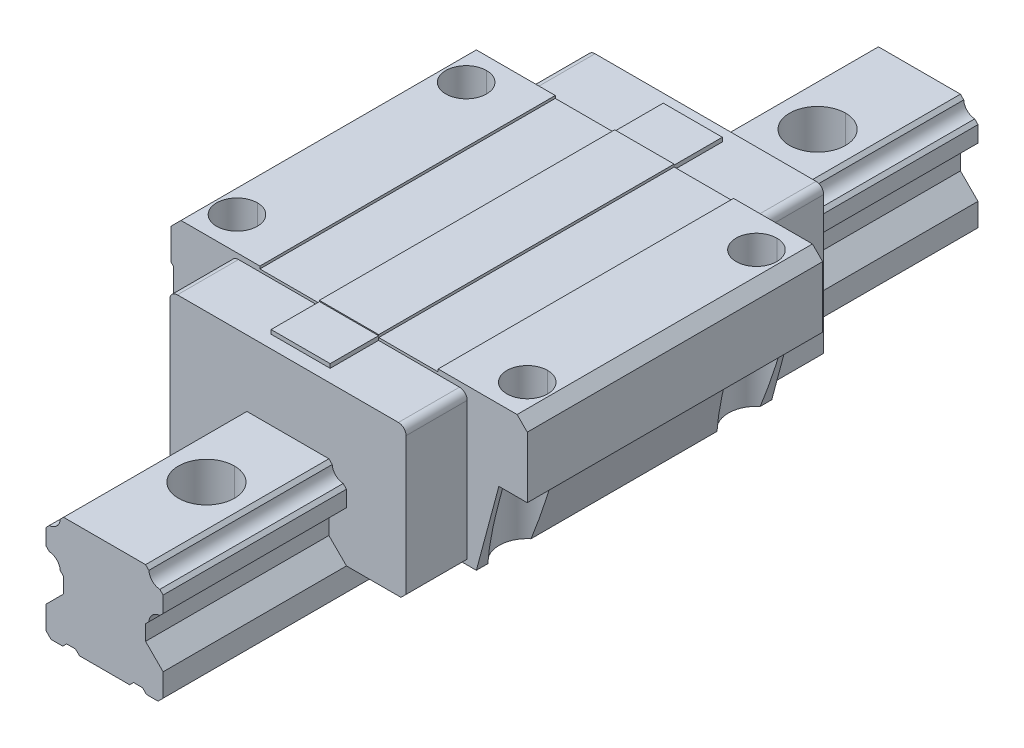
ISO-10303-21;
HEADER;
FILE_DESCRIPTION(('STEP AP214'),'2;1');
FILE_NAME('part.step','',(''),(''),'','','');
FILE_SCHEMA(('AUTOMOTIVE_DESIGN { 1 0 10303 214 1 1 1 1 }'));
ENDSEC;
DATA;
#1=APPLICATION_CONTEXT('core data for automotive mechanical design processes');
#2=APPLICATION_PROTOCOL_DEFINITION('international standard','automotive_design',2000,#1);
#3=PRODUCT_CONTEXT('',#1,'mechanical');
#4=PRODUCT('Part','Part','',(#3));
#5=PRODUCT_RELATED_PRODUCT_CATEGORY('part','',(#4));
#6=PRODUCT_DEFINITION_FORMATION('','',#4);
#7=PRODUCT_DEFINITION_CONTEXT('part definition',#1,'design');
#8=PRODUCT_DEFINITION('design','',#6,#7);
#9=PRODUCT_DEFINITION_SHAPE('','',#8);
#10=(LENGTH_UNIT() NAMED_UNIT(*) SI_UNIT(.MILLI.,.METRE.));
#11=(NAMED_UNIT(*) PLANE_ANGLE_UNIT() SI_UNIT($,.RADIAN.));
#12=(NAMED_UNIT(*) SI_UNIT($,.STERADIAN.) SOLID_ANGLE_UNIT());
#13=UNCERTAINTY_MEASURE_WITH_UNIT(LENGTH_MEASURE(1.E-05),#10,'distance_accuracy_value','');
#14=(GEOMETRIC_REPRESENTATION_CONTEXT(3) GLOBAL_UNCERTAINTY_ASSIGNED_CONTEXT((#13)) GLOBAL_UNIT_ASSIGNED_CONTEXT((#10,
#11,#12)) REPRESENTATION_CONTEXT('',''));
#15=CARTESIAN_POINT('',(0.,0.,0.));
#16=DIRECTION('',(0.,0.,1.));
#17=DIRECTION('',(1.,0.,0.));
#18=AXIS2_PLACEMENT_3D('',#15,#16,#17);
#19=CARTESIAN_POINT('',(28.5,36.,-354.5));
#20=DIRECTION('',(0.,1.,0.));
#21=DIRECTION('',(0.,0.,1.));
#22=AXIS2_PLACEMENT_3D('',#19,#20,#21);
#23=CYLINDRICAL_SURFACE('',#22,4.);
#24=CARTESIAN_POINT('',(28.5,22.,-354.5));
#25=DIRECTION('',(0.,-1.,0.));
#26=DIRECTION('',(0.,0.,1.));
#27=AXIS2_PLACEMENT_3D('',#24,#25,#26);
#28=CIRCLE('',#27,4.);
#29=CARTESIAN_POINT('',(28.5,22.,-350.5));
#30=VERTEX_POINT('',#29);
#31=CARTESIAN_POINT('',(28.5,22.,-358.5));
#32=VERTEX_POINT('',#31);
#33=EDGE_CURVE('P0_E809',#30,#32,#28,.T.);
#34=ORIENTED_EDGE('',*,*,#33,.T.);
#35=DIRECTION('',(0.,1.,0.));
#36=VECTOR('',#35,1.);
#37=CARTESIAN_POINT('',(28.5,36.,-358.5));
#38=LINE('',#37,#36);
#39=CARTESIAN_POINT('',(28.5,36.,-358.5));
#40=VERTEX_POINT('',#39);
#41=EDGE_CURVE('P0_E1442',#32,#40,#38,.T.);
#42=ORIENTED_EDGE('',*,*,#41,.T.);
#43=CARTESIAN_POINT('',(28.5,36.,-354.5));
#44=DIRECTION('',(0.,1.,0.));
#45=DIRECTION('',(0.,0.,1.));
#46=AXIS2_PLACEMENT_3D('',#43,#44,#45);
#47=CIRCLE('',#46,4.);
#48=CARTESIAN_POINT('',(28.5,36.,-350.5));
#49=VERTEX_POINT('',#48);
#50=EDGE_CURVE('P0_E853',#40,#49,#47,.T.);
#51=ORIENTED_EDGE('',*,*,#50,.T.);
#52=DIRECTION('',(0.,1.,0.));
#53=VECTOR('',#52,1.);
#54=CARTESIAN_POINT('',(28.5,36.,-350.5));
#55=LINE('',#54,#53);
#56=EDGE_CURVE('P0_E1450',#30,#49,#55,.T.);
#57=ORIENTED_EDGE('',*,*,#56,.F.);
#58=EDGE_LOOP('',(#34,#42,#51,#57));
#59=FACE_BOUND('',#58,.T.);
#60=ADVANCED_FACE('P0_F18',(#59),#23,.F.);
#61=CARTESIAN_POINT('',(28.5,36.,-399.5));
#62=DIRECTION('',(0.,1.,0.));
#63=DIRECTION('',(0.,0.,1.));
#64=AXIS2_PLACEMENT_3D('',#61,#62,#63);
#65=CYLINDRICAL_SURFACE('',#64,4.);
#66=CARTESIAN_POINT('',(28.5,22.,-399.5));
#67=DIRECTION('',(0.,-1.,0.));
#68=DIRECTION('',(0.,0.,1.));
#69=AXIS2_PLACEMENT_3D('',#66,#67,#68);
#70=CIRCLE('',#69,4.);
#71=CARTESIAN_POINT('',(28.5,22.,-395.5));
#72=VERTEX_POINT('',#71);
#73=CARTESIAN_POINT('',(28.5,22.,-403.5));
#74=VERTEX_POINT('',#73);
#75=EDGE_CURVE('P0_E806',#72,#74,#70,.T.);
#76=ORIENTED_EDGE('',*,*,#75,.T.);
#77=DIRECTION('',(0.,1.,0.));
#78=VECTOR('',#77,1.);
#79=CARTESIAN_POINT('',(28.5,36.,-403.5));
#80=LINE('',#79,#78);
#81=CARTESIAN_POINT('',(28.5,36.,-403.5));
#82=VERTEX_POINT('',#81);
#83=EDGE_CURVE('P0_E1950',#74,#82,#80,.T.);
#84=ORIENTED_EDGE('',*,*,#83,.T.);
#85=CARTESIAN_POINT('',(28.5,36.,-399.5));
#86=DIRECTION('',(0.,1.,0.));
#87=DIRECTION('',(0.,0.,1.));
#88=AXIS2_PLACEMENT_3D('',#85,#86,#87);
#89=CIRCLE('',#88,4.);
#90=CARTESIAN_POINT('',(28.5,36.,-395.5));
#91=VERTEX_POINT('',#90);
#92=EDGE_CURVE('P0_E857',#82,#91,#89,.T.);
#93=ORIENTED_EDGE('',*,*,#92,.T.);
#94=DIRECTION('',(0.,1.,0.));
#95=VECTOR('',#94,1.);
#96=CARTESIAN_POINT('',(28.5,36.,-395.5));
#97=LINE('',#96,#95);
#98=EDGE_CURVE('P0_E1428',#72,#91,#97,.T.);
#99=ORIENTED_EDGE('',*,*,#98,.F.);
#100=EDGE_LOOP('',(#76,#84,#93,#99));
#101=FACE_BOUND('',#100,.T.);
#102=ADVANCED_FACE('P0_F1745',(#101),#65,.F.);
#103=CARTESIAN_POINT('',(-28.5,36.,-399.5));
#104=DIRECTION('',(0.,1.,0.));
#105=DIRECTION('',(0.,0.,1.));
#106=AXIS2_PLACEMENT_3D('',#103,#104,#105);
#107=CYLINDRICAL_SURFACE('',#106,4.);
#108=CARTESIAN_POINT('',(-28.5,22.,-399.5));
#109=DIRECTION('',(0.,-1.,0.));
#110=DIRECTION('',(0.,0.,1.));
#111=AXIS2_PLACEMENT_3D('',#108,#109,#110);
#112=CIRCLE('',#111,4.);
#113=CARTESIAN_POINT('',(-28.5,22.,-395.5));
#114=VERTEX_POINT('',#113);
#115=CARTESIAN_POINT('',(-28.5,22.,-403.5));
#116=VERTEX_POINT('',#115);
#117=EDGE_CURVE('P0_E780',#114,#116,#112,.T.);
#118=ORIENTED_EDGE('',*,*,#117,.T.);
#119=DIRECTION('',(0.,1.,0.));
#120=VECTOR('',#119,1.);
#121=CARTESIAN_POINT('',(-28.5,36.,-403.5));
#122=LINE('',#121,#120);
#123=CARTESIAN_POINT('',(-28.5,36.,-403.5));
#124=VERTEX_POINT('',#123);
#125=EDGE_CURVE('P0_E2008',#116,#124,#122,.T.);
#126=ORIENTED_EDGE('',*,*,#125,.T.);
#127=CARTESIAN_POINT('',(-28.5,36.,-399.5));
#128=DIRECTION('',(0.,1.,0.));
#129=DIRECTION('',(0.,0.,1.));
#130=AXIS2_PLACEMENT_3D('',#127,#128,#129);
#131=CIRCLE('',#130,4.);
#132=CARTESIAN_POINT('',(-28.5,36.,-395.5));
#133=VERTEX_POINT('',#132);
#134=EDGE_CURVE('P0_E1544',#124,#133,#131,.T.);
#135=ORIENTED_EDGE('',*,*,#134,.T.);
#136=DIRECTION('',(0.,1.,0.));
#137=VECTOR('',#136,1.);
#138=CARTESIAN_POINT('',(-28.5,36.,-395.5));
#139=LINE('',#138,#137);
#140=EDGE_CURVE('P0_E1944',#114,#133,#139,.T.);
#141=ORIENTED_EDGE('',*,*,#140,.F.);
#142=EDGE_LOOP('',(#118,#126,#135,#141));
#143=FACE_BOUND('',#142,.T.);
#144=ADVANCED_FACE('P0_F1751',(#143),#107,.F.);
#145=CARTESIAN_POINT('',(-28.5,36.,-354.5));
#146=DIRECTION('',(0.,1.,0.));
#147=DIRECTION('',(0.,0.,1.));
#148=AXIS2_PLACEMENT_3D('',#145,#146,#147);
#149=CYLINDRICAL_SURFACE('',#148,4.);
#150=CARTESIAN_POINT('',(-28.5,22.,-354.5));
#151=DIRECTION('',(0.,-1.,0.));
#152=DIRECTION('',(0.,0.,1.));
#153=AXIS2_PLACEMENT_3D('',#150,#151,#152);
#154=CIRCLE('',#153,4.);
#155=CARTESIAN_POINT('',(-28.5,22.,-350.5));
#156=VERTEX_POINT('',#155);
#157=CARTESIAN_POINT('',(-28.5,22.,-358.5));
#158=VERTEX_POINT('',#157);
#159=EDGE_CURVE('P0_E1628',#156,#158,#154,.T.);
#160=ORIENTED_EDGE('',*,*,#159,.T.);
#161=DIRECTION('',(0.,1.,0.));
#162=VECTOR('',#161,1.);
#163=CARTESIAN_POINT('',(-28.5,36.,-358.5));
#164=LINE('',#163,#162);
#165=CARTESIAN_POINT('',(-28.5,36.,-358.5));
#166=VERTEX_POINT('',#165);
#167=EDGE_CURVE('P0_E1995',#158,#166,#164,.T.);
#168=ORIENTED_EDGE('',*,*,#167,.T.);
#169=CARTESIAN_POINT('',(-28.5,36.,-354.5));
#170=DIRECTION('',(0.,1.,0.));
#171=DIRECTION('',(0.,0.,1.));
#172=AXIS2_PLACEMENT_3D('',#169,#170,#171);
#173=CIRCLE('',#172,4.);
#174=CARTESIAN_POINT('',(-28.5,36.,-350.5));
#175=VERTEX_POINT('',#174);
#176=EDGE_CURVE('P0_E1548',#166,#175,#173,.T.);
#177=ORIENTED_EDGE('',*,*,#176,.T.);
#178=DIRECTION('',(0.,1.,0.));
#179=VECTOR('',#178,1.);
#180=CARTESIAN_POINT('',(-28.5,36.,-350.5));
#181=LINE('',#180,#179);
#182=EDGE_CURVE('P0_E2012',#156,#175,#181,.T.);
#183=ORIENTED_EDGE('',*,*,#182,.F.);
#184=EDGE_LOOP('',(#160,#168,#177,#183));
#185=FACE_BOUND('',#184,.T.);
#186=ADVANCED_FACE('P0_F20',(#185),#149,.F.);
#187=CARTESIAN_POINT('',(-11.5,0.,-418.0001));
#188=DIRECTION('',(0.,0.,1.));
#189=DIRECTION('',(1.,0.,0.));
#190=AXIS2_PLACEMENT_3D('',#187,#188,#189);
#191=PLANE('',#190);
#192=DIRECTION('',(0.707106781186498,0.707106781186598,0.));
#193=VECTOR('',#192,1.);
#194=CARTESIAN_POINT('',(11.5,15.4,-418.0001));
#195=LINE('',#194,#193);
#196=CARTESIAN_POINT('',(8.05000000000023,11.9499999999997,-418.0001));
#197=VERTEX_POINT('',#196);
#198=CARTESIAN_POINT('',(8.69927350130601,12.5992735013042,-418.0001));
#199=VERTEX_POINT('',#198);
#200=EDGE_CURVE('P0_E1178',#197,#199,#195,.T.);
#201=ORIENTED_EDGE('',*,*,#200,.T.);
#202=CARTESIAN_POINT('',(10.99475919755,12.45524080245,-418.0001));
#203=DIRECTION('',(0.,0.,1.));
#204=DIRECTION('',(-1.,0.,0.));
#205=AXIS2_PLACEMENT_3D('',#202,#203,#204);
#206=CIRCLE('',#205,2.3);
#207=CARTESIAN_POINT('',(10.8507264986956,14.750726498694,-418.0001));
#208=VERTEX_POINT('',#207);
#209=EDGE_CURVE('P0_E1333',#208,#199,#206,.T.);
#210=ORIENTED_EDGE('',*,*,#209,.F.);
#211=DIRECTION('',(0.707106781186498,0.707106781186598,0.));
#212=VECTOR('',#211,1.);
#213=CARTESIAN_POINT('',(11.5,15.4,-418.0001));
#214=LINE('',#213,#212);
#215=CARTESIAN_POINT('',(11.5,15.4,-418.0001));
#216=VERTEX_POINT('',#215);
#217=EDGE_CURVE('P0_E1162',#208,#216,#214,.T.);
#218=ORIENTED_EDGE('',*,*,#217,.T.);
#219=DIRECTION('',(0.,-1.,0.));
#220=VECTOR('',#219,1.);
#221=CARTESIAN_POINT('',(11.5000000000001,0.,-418.0001));
#222=LINE('',#221,#220);
#223=CARTESIAN_POINT('',(11.5000000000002,18.55,-418.0001));
#224=VERTEX_POINT('',#223);
#225=EDGE_CURVE('P0_E1324',#224,#216,#222,.T.);
#226=ORIENTED_EDGE('',*,*,#225,.F.);
#227=DIRECTION('',(-0.707106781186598,0.707106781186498,0.));
#228=VECTOR('',#227,1.);
#229=CARTESIAN_POINT('',(8.05,22.,-418.0001));
#230=LINE('',#229,#228);
#231=CARTESIAN_POINT('',(10.8507264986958,19.199273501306,-418.0001));
#232=VERTEX_POINT('',#231);
#233=EDGE_CURVE('P0_E878',#224,#232,#230,.T.);
#234=ORIENTED_EDGE('',*,*,#233,.T.);
#235=CARTESIAN_POINT('',(10.99475919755,21.49475919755,-418.0001));
#236=DIRECTION('',(0.,0.,1.));
#237=DIRECTION('',(-1.,0.,0.));
#238=AXIS2_PLACEMENT_3D('',#235,#236,#237);
#239=CIRCLE('',#238,2.3);
#240=CARTESIAN_POINT('',(8.69927350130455,21.350726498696,-418.0001));
#241=VERTEX_POINT('',#240);
#242=EDGE_CURVE('P0_E1321',#241,#232,#239,.T.);
#243=ORIENTED_EDGE('',*,*,#242,.F.);
#244=DIRECTION('',(0.707106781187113,-0.707106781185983,0.));
#245=VECTOR('',#244,1.);
#246=CARTESIAN_POINT('',(8.05,22.,-418.0001));
#247=LINE('',#246,#245);
#248=CARTESIAN_POINT('',(8.05,22.,-418.0001));
#249=VERTEX_POINT('',#248);
#250=EDGE_CURVE('P0_E1361',#249,#241,#247,.T.);
#251=ORIENTED_EDGE('',*,*,#250,.F.);
#252=DIRECTION('',(-1.,0.,0.));
#253=VECTOR('',#252,1.);
#254=CARTESIAN_POINT('',(-11.5,22.,-418.0001));
#255=LINE('',#254,#253);
#256=CARTESIAN_POINT('',(-8.05,22.,-418.0001));
#257=VERTEX_POINT('',#256);
#258=EDGE_CURVE('P0_E11',#249,#257,#255,.T.);
#259=ORIENTED_EDGE('',*,*,#258,.T.);
#260=DIRECTION('',(-0.707106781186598,-0.707106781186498,0.));
#261=VECTOR('',#260,1.);
#262=CARTESIAN_POINT('',(-8.05,22.,-418.0001));
#263=LINE('',#262,#261);
#264=CARTESIAN_POINT('',(-8.69927350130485,21.3507264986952,-418.0001));
#265=VERTEX_POINT('',#264);
#266=EDGE_CURVE('P0_E1367',#257,#265,#263,.T.);
#267=ORIENTED_EDGE('',*,*,#266,.T.);
#268=CARTESIAN_POINT('',(-10.99475919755,21.49475919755,-418.0001));
#269=DIRECTION('',(0.,0.,1.));
#270=DIRECTION('',(-1.,0.,0.));
#271=AXIS2_PLACEMENT_3D('',#268,#269,#270);
#272=CIRCLE('',#271,2.3);
#273=CARTESIAN_POINT('',(-10.8507264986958,19.199273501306,-418.0001));
#274=VERTEX_POINT('',#273);
#275=EDGE_CURVE('P0_E1345',#274,#265,#272,.T.);
#276=ORIENTED_EDGE('',*,*,#275,.F.);
#277=DIRECTION('',(-0.707106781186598,-0.707106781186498,0.));
#278=VECTOR('',#277,1.);
#279=CARTESIAN_POINT('',(-8.05,22.,-418.0001));
#280=LINE('',#279,#278);
#281=CARTESIAN_POINT('',(-11.5000000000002,18.5500000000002,-418.0001));
#282=VERTEX_POINT('',#281);
#283=EDGE_CURVE('P0_E1120',#274,#282,#280,.T.);
#284=ORIENTED_EDGE('',*,*,#283,.T.);
#285=DIRECTION('',(0.,1.,0.));
#286=VECTOR('',#285,1.);
#287=CARTESIAN_POINT('',(-11.5,0.,-418.0001));
#288=LINE('',#287,#286);
#289=CARTESIAN_POINT('',(-11.5,15.4,-418.0001));
#290=VERTEX_POINT('',#289);
#291=EDGE_CURVE('P0_E1307',#290,#282,#288,.T.);
#292=ORIENTED_EDGE('',*,*,#291,.F.);
#293=DIRECTION('',(0.707106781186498,-0.707106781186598,0.));
#294=VECTOR('',#293,1.);
#295=CARTESIAN_POINT('',(-11.5,15.4,-418.0001));
#296=LINE('',#295,#294);
#297=CARTESIAN_POINT('',(-10.8507264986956,14.750726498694,-418.0001));
#298=VERTEX_POINT('',#297);
#299=EDGE_CURVE('P0_E933',#290,#298,#296,.T.);
#300=ORIENTED_EDGE('',*,*,#299,.T.);
#301=CARTESIAN_POINT('',(-10.99475919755,12.45524080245,-418.0001));
#302=DIRECTION('',(0.,0.,1.));
#303=DIRECTION('',(-1.,0.,0.));
#304=AXIS2_PLACEMENT_3D('',#301,#302,#303);
#305=CIRCLE('',#304,2.3);
#306=CARTESIAN_POINT('',(-8.69927350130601,12.5992735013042,-418.0001));
#307=VERTEX_POINT('',#306);
#308=EDGE_CURVE('P0_E1304',#307,#298,#305,.T.);
#309=ORIENTED_EDGE('',*,*,#308,.F.);
#310=DIRECTION('',(0.707106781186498,-0.707106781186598,0.));
#311=VECTOR('',#310,1.);
#312=CARTESIAN_POINT('',(-11.5,15.4,-418.0001));
#313=LINE('',#312,#311);
#314=CARTESIAN_POINT('',(-8.05000000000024,11.9499999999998,-418.0001));
#315=VERTEX_POINT('',#314);
#316=EDGE_CURVE('P0_E1129',#307,#315,#313,.T.);
#317=ORIENTED_EDGE('',*,*,#316,.T.);
#318=DIRECTION('',(0.,1.,0.));
#319=VECTOR('',#318,1.);
#320=CARTESIAN_POINT('',(-8.05,0.,-418.0001));
#321=LINE('',#320,#319);
#322=CARTESIAN_POINT('',(-8.05,8.95,-418.0001));
#323=VERTEX_POINT('',#322);
#324=EDGE_CURVE('P0_E1297',#323,#315,#321,.T.);
#325=ORIENTED_EDGE('',*,*,#324,.F.);
#326=DIRECTION('',(0.707106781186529,0.707106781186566,0.));
#327=VECTOR('',#326,1.);
#328=CARTESIAN_POINT('',(-11.4999999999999,5.49999999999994,-418.0001));
#329=LINE('',#328,#327);
#330=CARTESIAN_POINT('',(-11.4999999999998,5.5,-418.0001));
#331=VERTEX_POINT('',#330);
#332=EDGE_CURVE('P0_E1286',#331,#323,#329,.T.);
#333=ORIENTED_EDGE('',*,*,#332,.F.);
#334=DIRECTION('',(1.,0.,0.));
#335=VECTOR('',#334,1.);
#336=CARTESIAN_POINT('',(-11.5,5.5,-418.0001));
#337=LINE('',#336,#335);
#338=CARTESIAN_POINT('',(-22.2,5.5,-418.0001));
#339=VERTEX_POINT('',#338);
#340=EDGE_CURVE('P0_E1278',#339,#331,#337,.T.);
#341=ORIENTED_EDGE('',*,*,#340,.F.);
#342=DIRECTION('',(-0.707106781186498,0.707106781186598,0.));
#343=VECTOR('',#342,1.);
#344=CARTESIAN_POINT('',(-22.2,5.5,-418.0001));
#345=LINE('',#344,#343);
#346=CARTESIAN_POINT('',(-23.2,6.50000000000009,-418.0001));
#347=VERTEX_POINT('',#346);
#348=EDGE_CURVE('P0_E995',#339,#347,#345,.T.);
#349=ORIENTED_EDGE('',*,*,#348,.T.);
#350=DIRECTION('',(0.,-1.,0.));
#351=VECTOR('',#350,1.);
#352=CARTESIAN_POINT('',(-23.2,0.,-418.0001));
#353=LINE('',#352,#351);
#354=CARTESIAN_POINT('',(-23.2,33.5,-418.0001));
#355=VERTEX_POINT('',#354);
#356=EDGE_CURVE('P0_E1275',#355,#347,#353,.T.);
#357=ORIENTED_EDGE('',*,*,#356,.F.);
#358=CARTESIAN_POINT('',(-21.7,33.5,-418.0001));
#359=DIRECTION('',(0.,0.,1.));
#360=DIRECTION('',(-1.,0.,0.));
#361=AXIS2_PLACEMENT_3D('',#358,#359,#360);
#362=CIRCLE('',#361,1.5);
#363=CARTESIAN_POINT('',(-21.7,35.,-418.0001));
#364=VERTEX_POINT('',#363);
#365=EDGE_CURVE('P0_E1268',#364,#355,#362,.T.);
#366=ORIENTED_EDGE('',*,*,#365,.F.);
#367=DIRECTION('',(-1.,0.,0.));
#368=VECTOR('',#367,1.);
#369=CARTESIAN_POINT('',(-11.5,35.,-418.0001));
#370=LINE('',#369,#368);
#371=CARTESIAN_POINT('',(21.7,35.,-418.0001));
#372=VERTEX_POINT('',#371);
#373=EDGE_CURVE('P0_E1260',#372,#364,#370,.T.);
#374=ORIENTED_EDGE('',*,*,#373,.F.);
#375=CARTESIAN_POINT('',(21.7,33.5,-418.0001));
#376=DIRECTION('',(0.,0.,1.));
#377=DIRECTION('',(-1.,0.,0.));
#378=AXIS2_PLACEMENT_3D('',#375,#376,#377);
#379=CIRCLE('',#378,1.5);
#380=CARTESIAN_POINT('',(23.2,33.5,-418.0001));
#381=VERTEX_POINT('',#380);
#382=EDGE_CURVE('P0_E1253',#381,#372,#379,.T.);
#383=ORIENTED_EDGE('',*,*,#382,.F.);
#384=DIRECTION('',(0.,1.,0.));
#385=VECTOR('',#384,1.);
#386=CARTESIAN_POINT('',(23.2,0.,-418.0001));
#387=LINE('',#386,#385);
#388=CARTESIAN_POINT('',(23.2,6.50000000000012,-418.0001));
#389=VERTEX_POINT('',#388);
#390=EDGE_CURVE('P0_E1245',#389,#381,#387,.T.);
#391=ORIENTED_EDGE('',*,*,#390,.F.);
#392=DIRECTION('',(-0.707106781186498,-0.707106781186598,0.));
#393=VECTOR('',#392,1.);
#394=CARTESIAN_POINT('',(22.2,5.5,-418.0001));
#395=LINE('',#394,#393);
#396=CARTESIAN_POINT('',(22.2,5.5,-418.0001));
#397=VERTEX_POINT('',#396);
#398=EDGE_CURVE('P0_E948',#389,#397,#395,.T.);
#399=ORIENTED_EDGE('',*,*,#398,.T.);
#400=DIRECTION('',(1.,0.,0.));
#401=VECTOR('',#400,1.);
#402=CARTESIAN_POINT('',(-11.5,5.49999999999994,-418.0001));
#403=LINE('',#402,#401);
#404=CARTESIAN_POINT('',(11.4999999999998,5.49999999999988,-418.0001));
#405=VERTEX_POINT('',#404);
#406=EDGE_CURVE('P0_E1242',#405,#397,#403,.T.);
#407=ORIENTED_EDGE('',*,*,#406,.F.);
#408=DIRECTION('',(0.707106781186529,-0.707106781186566,0.));
#409=VECTOR('',#408,1.);
#410=CARTESIAN_POINT('',(8.05,8.95,-418.0001));
#411=LINE('',#410,#409);
#412=CARTESIAN_POINT('',(8.05,8.95,-418.0001));
#413=VERTEX_POINT('',#412);
#414=EDGE_CURVE('P0_E1184',#413,#405,#411,.T.);
#415=ORIENTED_EDGE('',*,*,#414,.F.);
#416=DIRECTION('',(0.,-1.,0.));
#417=VECTOR('',#416,1.);
#418=CARTESIAN_POINT('',(8.05000000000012,0.,-418.0001));
#419=LINE('',#418,#417);
#420=EDGE_CURVE('P0_E1336',#197,#413,#419,.T.);
#421=ORIENTED_EDGE('',*,*,#420,.F.);
#422=EDGE_LOOP('',(#201,#210,#218,#226,#234,#243,#251,#259,#267,#276,#284,#292,#300,#309,#317,
#325,#333,#341,#349,#357,#366,#374,#383,#391,#399,#407,#415,#421));
#423=FACE_BOUND('',#422,.T.);
#424=ADVANCED_FACE('P0_F1390',(#423),#191,.F.);
#425=CARTESIAN_POINT('',(-11.5,22.,-415.50005));
#426=DIRECTION('',(0.,1.,0.));
#427=DIRECTION('',(1.,0.,0.));
#428=AXIS2_PLACEMENT_3D('',#425,#426,#427);
#429=PLANE('',#428);
#430=ORIENTED_EDGE('',*,*,#258,.F.);
#431=DIRECTION('',(0.,0.,-1.));
#432=VECTOR('',#431,1.);
#433=CARTESIAN_POINT('',(8.05,22.,-415.50005));
#434=LINE('',#433,#432);
#435=CARTESIAN_POINT('',(8.05,22.,-335.9999));
#436=VERTEX_POINT('',#435);
#437=EDGE_CURVE('P0_E1364',#436,#249,#434,.T.);
#438=ORIENTED_EDGE('',*,*,#437,.F.);
#439=DIRECTION('',(1.,0.,0.));
#440=VECTOR('',#439,1.);
#441=CARTESIAN_POINT('',(-11.5,22.,-335.9999));
#442=LINE('',#441,#440);
#443=CARTESIAN_POINT('',(-8.05,22.,-335.9999));
#444=VERTEX_POINT('',#443);
#445=EDGE_CURVE('P0_E1357',#444,#436,#442,.T.);
#446=ORIENTED_EDGE('',*,*,#445,.F.);
#447=DIRECTION('',(0.,0.,1.));
#448=VECTOR('',#447,1.);
#449=CARTESIAN_POINT('',(-8.05,22.,-415.50005));
#450=LINE('',#449,#448);
#451=EDGE_CURVE('P0_E27',#257,#444,#450,.T.);
#452=ORIENTED_EDGE('',*,*,#451,.F.);
#453=EDGE_LOOP('',(#430,#438,#446,#452));
#454=FACE_BOUND('',#453,.T.);
#455=ADVANCED_FACE('P0_F1378',(#454),#429,.F.);
#456=CARTESIAN_POINT('',(-8.05,22.,-333.62096320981));
#457=DIRECTION('',(-0.707106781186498,0.707106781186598,0.));
#458=DIRECTION('',(0.,0.,1.));
#459=AXIS2_PLACEMENT_3D('',#456,#457,#458);
#460=PLANE('',#459);
#461=ORIENTED_EDGE('',*,*,#266,.F.);
#462=ORIENTED_EDGE('',*,*,#451,.T.);
#463=DIRECTION('',(0.707106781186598,0.707106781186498,0.));
#464=VECTOR('',#463,1.);
#465=CARTESIAN_POINT('',(-8.05,22.,-335.9999));
#466=LINE('',#465,#464);
#467=CARTESIAN_POINT('',(-8.69927350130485,21.3507264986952,-335.9999));
#468=VERTEX_POINT('',#467);
#469=EDGE_CURVE('P0_E1353',#468,#444,#466,.T.);
#470=ORIENTED_EDGE('',*,*,#469,.F.);
#471=DIRECTION('',(0.,0.,1.));
#472=VECTOR('',#471,1.);
#473=CARTESIAN_POINT('',(-8.69927350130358,21.3507264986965,-333.62096320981));
#474=LINE('',#473,#472);
#475=EDGE_CURVE('P0_E1349',#265,#468,#474,.T.);
#476=ORIENTED_EDGE('',*,*,#475,.F.);
#477=EDGE_LOOP('',(#461,#462,#470,#476));
#478=FACE_BOUND('',#477,.T.);
#479=ADVANCED_FACE('P0_F1375',(#478),#460,.F.);
#480=CARTESIAN_POINT('',(8.05,22.,-333.62096320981));
#481=DIRECTION('',(0.707106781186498,0.707106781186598,0.));
#482=DIRECTION('',(0.,0.,-1.));
#483=AXIS2_PLACEMENT_3D('',#480,#481,#482);
#484=PLANE('',#483);
#485=ORIENTED_EDGE('',*,*,#250,.T.);
#486=DIRECTION('',(0.,0.,-1.));
#487=VECTOR('',#486,1.);
#488=CARTESIAN_POINT('',(8.69927350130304,21.350726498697,-333.62096320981));
#489=LINE('',#488,#487);
#490=CARTESIAN_POINT('',(8.69927350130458,21.3507264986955,-335.9999));
#491=VERTEX_POINT('',#490);
#492=EDGE_CURVE('P0_E1317',#491,#241,#489,.T.);
#493=ORIENTED_EDGE('',*,*,#492,.F.);
#494=DIRECTION('',(0.707106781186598,-0.707106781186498,0.));
#495=VECTOR('',#494,1.);
#496=CARTESIAN_POINT('',(8.05,22.,-335.9999));
#497=LINE('',#496,#495);
#498=EDGE_CURVE('P0_E1358',#436,#491,#497,.T.);
#499=ORIENTED_EDGE('',*,*,#498,.F.);
#500=ORIENTED_EDGE('',*,*,#437,.T.);
#501=EDGE_LOOP('',(#485,#493,#499,#500));
#502=FACE_BOUND('',#501,.T.);
#503=ADVANCED_FACE('P0_F1824',(#502),#484,.F.);
#504=CARTESIAN_POINT('',(11.5,0.,-335.9999));
#505=DIRECTION('',(0.,0.,-1.));
#506=DIRECTION('',(0.,-1.,0.));
#507=AXIS2_PLACEMENT_3D('',#504,#505,#506);
#508=PLANE('',#507);
#509=DIRECTION('',(-0.707106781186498,0.707106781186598,0.));
#510=VECTOR('',#509,1.);
#511=CARTESIAN_POINT('',(-11.5,15.4,-335.9999));
#512=LINE('',#511,#510);
#513=CARTESIAN_POINT('',(-8.05000000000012,11.9499999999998,-335.9999));
#514=VERTEX_POINT('',#513);
#515=CARTESIAN_POINT('',(-8.69927350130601,12.5992735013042,-335.9999));
#516=VERTEX_POINT('',#515);
#517=EDGE_CURVE('P0_E1137',#514,#516,#512,.T.);
#518=ORIENTED_EDGE('',*,*,#517,.T.);
#519=CARTESIAN_POINT('',(-10.99475919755,12.45524080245,-335.9999));
#520=DIRECTION('',(0.,0.,-1.));
#521=DIRECTION('',(-1.,0.,0.));
#522=AXIS2_PLACEMENT_3D('',#519,#520,#521);
#523=CIRCLE('',#522,2.3);
#524=CARTESIAN_POINT('',(-10.8507264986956,14.750726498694,-335.9999));
#525=VERTEX_POINT('',#524);
#526=EDGE_CURVE('P0_E1301',#525,#516,#523,.T.);
#527=ORIENTED_EDGE('',*,*,#526,.F.);
#528=DIRECTION('',(-0.707106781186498,0.707106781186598,0.));
#529=VECTOR('',#528,1.);
#530=CARTESIAN_POINT('',(-11.5,15.4,-335.9999));
#531=LINE('',#530,#529);
#532=CARTESIAN_POINT('',(-11.5,15.4,-335.9999));
#533=VERTEX_POINT('',#532);
#534=EDGE_CURVE('P0_E1147',#525,#533,#531,.T.);
#535=ORIENTED_EDGE('',*,*,#534,.T.);
#536=DIRECTION('',(0.,-1.,0.));
#537=VECTOR('',#536,1.);
#538=CARTESIAN_POINT('',(-11.5000000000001,0.,-335.9999));
#539=LINE('',#538,#537);
#540=CARTESIAN_POINT('',(-11.5,18.5500000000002,-335.9999));
#541=VERTEX_POINT('',#540);
#542=EDGE_CURVE('P0_E1310',#541,#533,#539,.T.);
#543=ORIENTED_EDGE('',*,*,#542,.F.);
#544=DIRECTION('',(0.707106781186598,0.707106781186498,0.));
#545=VECTOR('',#544,1.);
#546=CARTESIAN_POINT('',(-8.05,22.,-335.9999));
#547=LINE('',#546,#545);
#548=CARTESIAN_POINT('',(-10.8507264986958,19.199273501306,-335.9999));
#549=VERTEX_POINT('',#548);
#550=EDGE_CURVE('P0_E1202',#541,#549,#547,.T.);
#551=ORIENTED_EDGE('',*,*,#550,.T.);
#552=CARTESIAN_POINT('',(-10.99475919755,21.49475919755,-335.9999));
#553=DIRECTION('',(0.,0.,-1.));
#554=DIRECTION('',(-1.,0.,0.));
#555=AXIS2_PLACEMENT_3D('',#552,#553,#554);
#556=CIRCLE('',#555,2.3);
#557=EDGE_CURVE('P0_E1342',#468,#549,#556,.T.);
#558=ORIENTED_EDGE('',*,*,#557,.F.);
#559=ORIENTED_EDGE('',*,*,#469,.T.);
#560=ORIENTED_EDGE('',*,*,#445,.T.);
#561=ORIENTED_EDGE('',*,*,#498,.T.);
#562=CARTESIAN_POINT('',(10.99475919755,21.49475919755,-335.9999));
#563=DIRECTION('',(0.,0.,-1.));
#564=DIRECTION('',(-1.,0.,0.));
#565=AXIS2_PLACEMENT_3D('',#562,#563,#564);
#566=CIRCLE('',#565,2.3);
#567=CARTESIAN_POINT('',(10.8507264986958,19.199273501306,-335.9999));
#568=VERTEX_POINT('',#567);
#569=EDGE_CURVE('P0_E1313',#568,#491,#566,.T.);
#570=ORIENTED_EDGE('',*,*,#569,.F.);
#571=DIRECTION('',(0.707106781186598,-0.707106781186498,0.));
#572=VECTOR('',#571,1.);
#573=CARTESIAN_POINT('',(8.05,22.,-335.9999));
#574=LINE('',#573,#572);
#575=CARTESIAN_POINT('',(11.5,18.5500000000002,-335.9999));
#576=VERTEX_POINT('',#575);
#577=EDGE_CURVE('P0_E1154',#568,#576,#574,.T.);
#578=ORIENTED_EDGE('',*,*,#577,.T.);
#579=DIRECTION('',(0.,1.,0.));
#580=VECTOR('',#579,1.);
#581=CARTESIAN_POINT('',(11.5,0.,-335.9999));
#582=LINE('',#581,#580);
#583=CARTESIAN_POINT('',(11.5,15.4,-335.9999));
#584=VERTEX_POINT('',#583);
#585=EDGE_CURVE('P0_E1327',#584,#576,#582,.T.);
#586=ORIENTED_EDGE('',*,*,#585,.F.);
#587=DIRECTION('',(-0.707106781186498,-0.707106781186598,0.));
#588=VECTOR('',#587,1.);
#589=CARTESIAN_POINT('',(11.5,15.4,-335.9999));
#590=LINE('',#589,#588);
#591=CARTESIAN_POINT('',(10.8507264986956,14.750726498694,-335.9999));
#592=VERTEX_POINT('',#591);
#593=EDGE_CURVE('P0_E1170',#584,#592,#590,.T.);
#594=ORIENTED_EDGE('',*,*,#593,.T.);
#595=CARTESIAN_POINT('',(10.99475919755,12.45524080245,-335.9999));
#596=DIRECTION('',(0.,0.,-1.));
#597=DIRECTION('',(-1.,0.,0.));
#598=AXIS2_PLACEMENT_3D('',#595,#596,#597);
#599=CIRCLE('',#598,2.3);
#600=CARTESIAN_POINT('',(8.69927350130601,12.5992735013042,-335.9999));
#601=VERTEX_POINT('',#600);
#602=EDGE_CURVE('P0_E1330',#601,#592,#599,.T.);
#603=ORIENTED_EDGE('',*,*,#602,.F.);
#604=DIRECTION('',(-0.707106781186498,-0.707106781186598,0.));
#605=VECTOR('',#604,1.);
#606=CARTESIAN_POINT('',(11.5,15.4,-335.9999));
#607=LINE('',#606,#605);
#608=CARTESIAN_POINT('',(8.05,11.9499999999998,-335.9999));
#609=VERTEX_POINT('',#608);
#610=EDGE_CURVE('P0_E1192',#601,#609,#607,.T.);
#611=ORIENTED_EDGE('',*,*,#610,.T.);
#612=DIRECTION('',(0.,1.,0.));
#613=VECTOR('',#612,1.);
#614=CARTESIAN_POINT('',(8.05,0.,-335.9999));
#615=LINE('',#614,#613);
#616=CARTESIAN_POINT('',(8.05,8.95,-335.9999));
#617=VERTEX_POINT('',#616);
#618=EDGE_CURVE('P0_E1339',#617,#609,#615,.T.);
#619=ORIENTED_EDGE('',*,*,#618,.F.);
#620=DIRECTION('',(-0.707106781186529,0.707106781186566,0.));
#621=VECTOR('',#620,1.);
#622=CARTESIAN_POINT('',(11.4999999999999,5.49999999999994,-335.9999));
#623=LINE('',#622,#621);
#624=CARTESIAN_POINT('',(11.4999999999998,5.5,-335.9999));
#625=VERTEX_POINT('',#624);
#626=EDGE_CURVE('P0_E1183',#625,#617,#623,.T.);
#627=ORIENTED_EDGE('',*,*,#626,.F.);
#628=DIRECTION('',(-1.,0.,0.));
#629=VECTOR('',#628,1.);
#630=CARTESIAN_POINT('',(11.5,5.5,-335.9999));
#631=LINE('',#630,#629);
#632=CARTESIAN_POINT('',(22.2,5.5,-335.9999));
#633=VERTEX_POINT('',#632);
#634=EDGE_CURVE('P0_E1239',#633,#625,#631,.T.);
#635=ORIENTED_EDGE('',*,*,#634,.F.);
#636=DIRECTION('',(-0.707106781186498,-0.707106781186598,0.));
#637=VECTOR('',#636,1.);
#638=CARTESIAN_POINT('',(22.2,5.5,-335.9999));
#639=LINE('',#638,#637);
#640=CARTESIAN_POINT('',(23.2,6.5,-335.9999));
#641=VERTEX_POINT('',#640);
#642=EDGE_CURVE('P0_E884',#641,#633,#639,.T.);
#643=ORIENTED_EDGE('',*,*,#642,.F.);
#644=DIRECTION('',(0.,-1.,0.));
#645=VECTOR('',#644,1.);
#646=CARTESIAN_POINT('',(23.2,0.,-335.9999));
#647=LINE('',#646,#645);
#648=CARTESIAN_POINT('',(23.2,33.5,-335.9999));
#649=VERTEX_POINT('',#648);
#650=EDGE_CURVE('P0_E1092',#649,#641,#647,.T.);
#651=ORIENTED_EDGE('',*,*,#650,.F.);
#652=CARTESIAN_POINT('',(21.7,33.5,-335.9999));
#653=DIRECTION('',(0.,0.,-1.));
#654=DIRECTION('',(-1.,0.,0.));
#655=AXIS2_PLACEMENT_3D('',#652,#653,#654);
#656=CIRCLE('',#655,1.5);
#657=CARTESIAN_POINT('',(21.7,35.,-335.9999));
#658=VERTEX_POINT('',#657);
#659=EDGE_CURVE('P0_E1093',#658,#649,#656,.T.);
#660=ORIENTED_EDGE('',*,*,#659,.F.);
#661=DIRECTION('',(1.,0.,0.));
#662=VECTOR('',#661,1.);
#663=CARTESIAN_POINT('',(11.5,35.,-335.9999));
#664=LINE('',#663,#662);
#665=CARTESIAN_POINT('',(-21.7,35.,-335.9999));
#666=VERTEX_POINT('',#665);
#667=EDGE_CURVE('P0_E1104',#666,#658,#664,.T.);
#668=ORIENTED_EDGE('',*,*,#667,.F.);
#669=CARTESIAN_POINT('',(-21.7,33.5,-335.9999));
#670=DIRECTION('',(0.,0.,-1.));
#671=DIRECTION('',(-1.,0.,0.));
#672=AXIS2_PLACEMENT_3D('',#669,#670,#671);
#673=CIRCLE('',#672,1.5);
#674=CARTESIAN_POINT('',(-23.2,33.5,-335.9999));
#675=VERTEX_POINT('',#674);
#676=EDGE_CURVE('P0_E1215',#675,#666,#673,.T.);
#677=ORIENTED_EDGE('',*,*,#676,.F.);
#678=DIRECTION('',(0.,1.,0.));
#679=VECTOR('',#678,1.);
#680=CARTESIAN_POINT('',(-23.2,0.,-335.9999));
#681=LINE('',#680,#679);
#682=CARTESIAN_POINT('',(-23.2,6.50000000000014,-335.9999));
#683=VERTEX_POINT('',#682);
#684=EDGE_CURVE('P0_E1210',#683,#675,#681,.T.);
#685=ORIENTED_EDGE('',*,*,#684,.F.);
#686=DIRECTION('',(-0.707106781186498,0.707106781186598,0.));
#687=VECTOR('',#686,1.);
#688=CARTESIAN_POINT('',(-22.2,5.5,-335.9999));
#689=LINE('',#688,#687);
#690=CARTESIAN_POINT('',(-22.2,5.5,-335.9999));
#691=VERTEX_POINT('',#690);
#692=EDGE_CURVE('P0_E1119',#691,#683,#689,.T.);
#693=ORIENTED_EDGE('',*,*,#692,.F.);
#694=DIRECTION('',(-1.,0.,0.));
#695=VECTOR('',#694,1.);
#696=CARTESIAN_POINT('',(11.5,5.49999999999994,-335.9999));
#697=LINE('',#696,#695);
#698=CARTESIAN_POINT('',(-11.4999999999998,5.49999999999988,-335.9999));
#699=VERTEX_POINT('',#698);
#700=EDGE_CURVE('P0_E1283',#699,#691,#697,.T.);
#701=ORIENTED_EDGE('',*,*,#700,.F.);
#702=DIRECTION('',(-0.707106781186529,-0.707106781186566,0.));
#703=VECTOR('',#702,1.);
#704=CARTESIAN_POINT('',(-8.05,8.95,-335.9999));
#705=LINE('',#704,#703);
#706=CARTESIAN_POINT('',(-8.05,8.95,-335.9999));
#707=VERTEX_POINT('',#706);
#708=EDGE_CURVE('P0_E1294',#707,#699,#705,.T.);
#709=ORIENTED_EDGE('',*,*,#708,.F.);
#710=DIRECTION('',(0.,-1.,0.));
#711=VECTOR('',#710,1.);
#712=CARTESIAN_POINT('',(-8.05000000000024,0.,-335.9999));
#713=LINE('',#712,#711);
#714=EDGE_CURVE('P0_E1298',#514,#707,#713,.T.);
#715=ORIENTED_EDGE('',*,*,#714,.F.);
#716=EDGE_LOOP('',(#518,#527,#535,#543,#551,#558,#559,#560,#561,#570,#578,#586,#594,#603,#611,
#619,#627,#635,#643,#651,#660,#668,#677,#685,#693,#701,#709,#715));
#717=FACE_BOUND('',#716,.T.);
#718=ADVANCED_FACE('P0_F1384',(#717),#508,.F.);
#719=CARTESIAN_POINT('',(-10.99475919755,21.49475919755,-331.99461761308));
#720=DIRECTION('',(0.,0.,-1.));
#721=DIRECTION('',(-1.,0.,0.));
#722=AXIS2_PLACEMENT_3D('',#719,#720,#721);
#723=CYLINDRICAL_SURFACE('',#722,2.3);
#724=ORIENTED_EDGE('',*,*,#557,.T.);
#725=DIRECTION('',(0.,0.,-1.));
#726=VECTOR('',#725,1.);
#727=CARTESIAN_POINT('',(-10.8507264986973,19.1992735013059,-331.99461761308));
#728=LINE('',#727,#726);
#729=EDGE_CURVE('P0_E1124',#549,#274,#728,.T.);
#730=ORIENTED_EDGE('',*,*,#729,.T.);
#731=ORIENTED_EDGE('',*,*,#275,.T.);
#732=ORIENTED_EDGE('',*,*,#475,.T.);
#733=EDGE_LOOP('',(#724,#730,#731,#732));
#734=FACE_BOUND('',#733,.T.);
#735=ADVANCED_FACE('P0_F1388',(#734),#723,.T.);
#736=CARTESIAN_POINT('',(8.05,11.95,-328.016083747));
#737=DIRECTION('',(1.,0.,0.));
#738=DIRECTION('',(0.,1.,0.));
#739=AXIS2_PLACEMENT_3D('',#736,#737,#738);
#740=PLANE('',#739);
#741=ORIENTED_EDGE('',*,*,#420,.T.);
#742=DIRECTION('',(0.,0.,-1.));
#743=VECTOR('',#742,1.);
#744=CARTESIAN_POINT('',(8.05,8.95,-328.016083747));
#745=LINE('',#744,#743);
#746=EDGE_CURVE('P0_E1235',#617,#413,#745,.T.);
#747=ORIENTED_EDGE('',*,*,#746,.F.);
#748=ORIENTED_EDGE('',*,*,#618,.T.);
#749=DIRECTION('',(0.,0.,1.));
#750=VECTOR('',#749,1.);
#751=CARTESIAN_POINT('',(8.05,11.9499999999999,-328.016083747));
#752=LINE('',#751,#750);
#753=EDGE_CURVE('P0_E1188',#197,#609,#752,.T.);
#754=ORIENTED_EDGE('',*,*,#753,.F.);
#755=EDGE_LOOP('',(#741,#747,#748,#754));
#756=FACE_BOUND('',#755,.T.);
#757=ADVANCED_FACE('P0_F1848',(#756),#740,.F.);
#758=CARTESIAN_POINT('',(10.99475919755,12.45524080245,-331.99461761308));
#759=DIRECTION('',(0.,0.,-1.));
#760=DIRECTION('',(-1.,0.,0.));
#761=AXIS2_PLACEMENT_3D('',#758,#759,#760);
#762=CYLINDRICAL_SURFACE('',#761,2.3);
#763=ORIENTED_EDGE('',*,*,#602,.T.);
#764=DIRECTION('',(0.,0.,-1.));
#765=VECTOR('',#764,1.);
#766=CARTESIAN_POINT('',(10.8507264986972,14.7507264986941,-331.99461761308));
#767=LINE('',#766,#765);
#768=EDGE_CURVE('P0_E1166',#592,#208,#767,.T.);
#769=ORIENTED_EDGE('',*,*,#768,.T.);
#770=ORIENTED_EDGE('',*,*,#209,.T.);
#771=DIRECTION('',(0.,0.,1.));
#772=VECTOR('',#771,1.);
#773=CARTESIAN_POINT('',(8.69927350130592,12.5992735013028,-331.99461761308));
#774=LINE('',#773,#772);
#775=EDGE_CURVE('P0_E1125',#199,#601,#774,.T.);
#776=ORIENTED_EDGE('',*,*,#775,.T.);
#777=EDGE_LOOP('',(#763,#769,#770,#776));
#778=FACE_BOUND('',#777,.T.);
#779=ADVANCED_FACE('P0_F1821',(#778),#762,.T.);
#780=CARTESIAN_POINT('',(11.5,0.,-415.50005));
#781=DIRECTION('',(1.,0.,0.));
#782=DIRECTION('',(0.,1.,0.));
#783=AXIS2_PLACEMENT_3D('',#780,#781,#782);
#784=PLANE('',#783);
#785=ORIENTED_EDGE('',*,*,#225,.T.);
#786=DIRECTION('',(0.,0.,-1.));
#787=VECTOR('',#786,1.);
#788=CARTESIAN_POINT('',(11.5,15.4,-415.50005));
#789=LINE('',#788,#787);
#790=EDGE_CURVE('P0_E1174',#584,#216,#789,.T.);
#791=ORIENTED_EDGE('',*,*,#790,.F.);
#792=ORIENTED_EDGE('',*,*,#585,.T.);
#793=DIRECTION('',(0.,0.,1.));
#794=VECTOR('',#793,1.);
#795=CARTESIAN_POINT('',(11.5,18.55,-415.50005));
#796=LINE('',#795,#794);
#797=EDGE_CURVE('P0_E882',#224,#576,#796,.T.);
#798=ORIENTED_EDGE('',*,*,#797,.F.);
#799=EDGE_LOOP('',(#785,#791,#792,#798));
#800=FACE_BOUND('',#799,.T.);
#801=ADVANCED_FACE('P0_F1817',(#800),#784,.F.);
#802=CARTESIAN_POINT('',(10.99475919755,21.49475919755,-331.99461761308));
#803=DIRECTION('',(0.,0.,-1.));
#804=DIRECTION('',(-1.,0.,0.));
#805=AXIS2_PLACEMENT_3D('',#802,#803,#804);
#806=CYLINDRICAL_SURFACE('',#805,2.3);
#807=ORIENTED_EDGE('',*,*,#569,.T.);
#808=ORIENTED_EDGE('',*,*,#492,.T.);
#809=ORIENTED_EDGE('',*,*,#242,.T.);
#810=DIRECTION('',(0.,0.,1.));
#811=VECTOR('',#810,1.);
#812=CARTESIAN_POINT('',(10.8507264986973,19.1992735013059,-331.99461761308));
#813=LINE('',#812,#811);
#814=EDGE_CURVE('P0_E1158',#232,#568,#813,.T.);
#815=ORIENTED_EDGE('',*,*,#814,.T.);
#816=EDGE_LOOP('',(#807,#808,#809,#815));
#817=FACE_BOUND('',#816,.T.);
#818=ADVANCED_FACE('P0_F1820',(#817),#806,.T.);
#819=CARTESIAN_POINT('',(-11.5,0.,-415.50005));
#820=DIRECTION('',(-1.,0.,0.));
#821=DIRECTION('',(0.,0.,1.));
#822=AXIS2_PLACEMENT_3D('',#819,#820,#821);
#823=PLANE('',#822);
#824=ORIENTED_EDGE('',*,*,#291,.T.);
#825=DIRECTION('',(0.,0.,-1.));
#826=VECTOR('',#825,1.);
#827=CARTESIAN_POINT('',(-11.5,18.55,-415.50005));
#828=LINE('',#827,#826);
#829=EDGE_CURVE('P0_E1206',#541,#282,#828,.T.);
#830=ORIENTED_EDGE('',*,*,#829,.F.);
#831=ORIENTED_EDGE('',*,*,#542,.T.);
#832=DIRECTION('',(0.,0.,1.));
#833=VECTOR('',#832,1.);
#834=CARTESIAN_POINT('',(-11.5,15.4,-415.50005));
#835=LINE('',#834,#833);
#836=EDGE_CURVE('P0_E940',#290,#533,#835,.T.);
#837=ORIENTED_EDGE('',*,*,#836,.F.);
#838=EDGE_LOOP('',(#824,#830,#831,#837));
#839=FACE_BOUND('',#838,.T.);
#840=ADVANCED_FACE('P0_F1396',(#839),#823,.F.);
#841=CARTESIAN_POINT('',(-10.99475919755,12.45524080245,-331.99461761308));
#842=DIRECTION('',(0.,0.,-1.));
#843=DIRECTION('',(-1.,0.,0.));
#844=AXIS2_PLACEMENT_3D('',#841,#842,#843);
#845=CYLINDRICAL_SURFACE('',#844,2.3);
#846=ORIENTED_EDGE('',*,*,#526,.T.);
#847=DIRECTION('',(0.,0.,-1.));
#848=VECTOR('',#847,1.);
#849=CARTESIAN_POINT('',(-8.69927350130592,12.5992735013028,-331.99461761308));
#850=LINE('',#849,#848);
#851=EDGE_CURVE('P0_E1133',#516,#307,#850,.T.);
#852=ORIENTED_EDGE('',*,*,#851,.T.);
#853=ORIENTED_EDGE('',*,*,#308,.T.);
#854=DIRECTION('',(0.,0.,1.));
#855=VECTOR('',#854,1.);
#856=CARTESIAN_POINT('',(-10.8507264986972,14.7507264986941,-331.99461761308));
#857=LINE('',#856,#855);
#858=EDGE_CURVE('P0_E883',#298,#525,#857,.T.);
#859=ORIENTED_EDGE('',*,*,#858,.T.);
#860=EDGE_LOOP('',(#846,#852,#853,#859));
#861=FACE_BOUND('',#860,.T.);
#862=ADVANCED_FACE('P0_F1406',(#861),#845,.T.);
#863=CARTESIAN_POINT('',(-8.05,11.95,-328.016083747));
#864=DIRECTION('',(-1.,0.,0.));
#865=DIRECTION('',(0.,0.,1.));
#866=AXIS2_PLACEMENT_3D('',#863,#864,#865);
#867=PLANE('',#866);
#868=ORIENTED_EDGE('',*,*,#324,.T.);
#869=DIRECTION('',(0.,0.,-1.));
#870=VECTOR('',#869,1.);
#871=CARTESIAN_POINT('',(-8.05,11.9499999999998,-328.016083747));
#872=LINE('',#871,#870);
#873=EDGE_CURVE('P0_E941',#514,#315,#872,.T.);
#874=ORIENTED_EDGE('',*,*,#873,.F.);
#875=ORIENTED_EDGE('',*,*,#714,.T.);
#876=DIRECTION('',(0.,0.,1.));
#877=VECTOR('',#876,1.);
#878=CARTESIAN_POINT('',(-8.05,8.95,-328.016083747));
#879=LINE('',#878,#877);
#880=EDGE_CURVE('P0_E1290',#323,#707,#879,.T.);
#881=ORIENTED_EDGE('',*,*,#880,.F.);
#882=EDGE_LOOP('',(#868,#874,#875,#881));
#883=FACE_BOUND('',#882,.T.);
#884=ADVANCED_FACE('P0_F1412',(#883),#867,.F.);
#885=CARTESIAN_POINT('',(-8.05,8.95,-328.016083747));
#886=DIRECTION('',(-0.707106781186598,0.707106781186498,0.));
#887=DIRECTION('',(0.,0.,1.));
#888=AXIS2_PLACEMENT_3D('',#885,#886,#887);
#889=PLANE('',#888);
#890=ORIENTED_EDGE('',*,*,#332,.T.);
#891=ORIENTED_EDGE('',*,*,#880,.T.);
#892=ORIENTED_EDGE('',*,*,#708,.T.);
#893=DIRECTION('',(0.,0.,1.));
#894=VECTOR('',#893,1.);
#895=CARTESIAN_POINT('',(-11.4999999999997,5.49999999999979,-328.016083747));
#896=LINE('',#895,#894);
#897=EDGE_CURVE('P0_E1279',#331,#699,#896,.T.);
#898=ORIENTED_EDGE('',*,*,#897,.F.);
#899=EDGE_LOOP('',(#890,#891,#892,#898));
#900=FACE_BOUND('',#899,.T.);
#901=ADVANCED_FACE('P0_F1811',(#900),#889,.F.);
#902=CARTESIAN_POINT('',(-23.2,5.5,-283.51627513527));
#903=DIRECTION('',(0.,1.,0.));
#904=DIRECTION('',(1.,0.,0.));
#905=AXIS2_PLACEMENT_3D('',#902,#903,#904);
#906=PLANE('',#905);
#907=DIRECTION('',(1.,0.,0.));
#908=VECTOR('',#907,1.);
#909=CARTESIAN_POINT('',(-23.2,5.5,-348.));
#910=LINE('',#909,#908);
#911=CARTESIAN_POINT('',(-24.9999999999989,5.49999999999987,-348.));
#912=VERTEX_POINT('',#911);
#913=CARTESIAN_POINT('',(-22.2,5.5,-348.));
#914=VERTEX_POINT('',#913);
#915=EDGE_CURVE('P0_E981',#912,#914,#910,.T.);
#916=ORIENTED_EDGE('',*,*,#915,.F.);
#917=DIRECTION('',(0.,0.,1.));
#918=VECTOR('',#917,1.);
#919=CARTESIAN_POINT('',(-24.9999999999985,5.5,-283.51627513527));
#920=LINE('',#919,#918);
#921=CARTESIAN_POINT('',(-24.9999999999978,5.5,-350.257359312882));
#922=VERTEX_POINT('',#921);
#923=EDGE_CURVE('P0_E1074',#922,#912,#920,.T.);
#924=ORIENTED_EDGE('',*,*,#923,.F.);
#925=CARTESIAN_POINT('',(-28.5,5.5,-354.5));
#926=DIRECTION('',(0.,-1.,0.));
#927=DIRECTION('',(0.,0.,1.));
#928=AXIS2_PLACEMENT_3D('',#925,#926,#927);
#929=CIRCLE('',#928,5.5);
#930=CARTESIAN_POINT('',(-24.9999999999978,5.5,-358.742640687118));
#931=VERTEX_POINT('',#930);
#932=EDGE_CURVE('P0_E833',#931,#922,#929,.T.);
#933=ORIENTED_EDGE('',*,*,#932,.F.);
#934=DIRECTION('',(0.,0.,1.));
#935=VECTOR('',#934,1.);
#936=CARTESIAN_POINT('',(-24.9999999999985,5.5,-283.51627513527));
#937=LINE('',#936,#935);
#938=CARTESIAN_POINT('',(-24.9999999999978,5.5,-395.257359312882));
#939=VERTEX_POINT('',#938);
#940=EDGE_CURVE('P0_E1052',#939,#931,#937,.T.);
#941=ORIENTED_EDGE('',*,*,#940,.F.);
#942=CARTESIAN_POINT('',(-28.5,5.5,-399.5));
#943=DIRECTION('',(0.,-1.,0.));
#944=DIRECTION('',(0.,0.,1.));
#945=AXIS2_PLACEMENT_3D('',#942,#943,#944);
#946=CIRCLE('',#945,5.5);
#947=CARTESIAN_POINT('',(-24.9999999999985,5.5,-403.742640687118));
#948=VERTEX_POINT('',#947);
#949=EDGE_CURVE('P0_E1044',#948,#939,#946,.T.);
#950=ORIENTED_EDGE('',*,*,#949,.F.);
#951=DIRECTION('',(0.,0.,1.));
#952=VECTOR('',#951,1.);
#953=CARTESIAN_POINT('',(-25.,5.5,-283.51627513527));
#954=LINE('',#953,#952);
#955=CARTESIAN_POINT('',(-24.9999999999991,5.50000000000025,-406.));
#956=VERTEX_POINT('',#955);
#957=EDGE_CURVE('P0_E1035',#956,#948,#954,.T.);
#958=ORIENTED_EDGE('',*,*,#957,.F.);
#959=DIRECTION('',(-1.,0.,0.));
#960=VECTOR('',#959,1.);
#961=CARTESIAN_POINT('',(-23.2,5.5,-406.));
#962=LINE('',#961,#960);
#963=CARTESIAN_POINT('',(-22.2,5.5,-406.));
#964=VERTEX_POINT('',#963);
#965=EDGE_CURVE('P0_E819',#964,#956,#962,.T.);
#966=ORIENTED_EDGE('',*,*,#965,.F.);
#967=DIRECTION('',(0.,0.,1.));
#968=VECTOR('',#967,1.);
#969=CARTESIAN_POINT('',(-22.2,5.5,-283.51627513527));
#970=LINE('',#969,#968);
#971=EDGE_CURVE('P0_E999',#339,#964,#970,.T.);
#972=ORIENTED_EDGE('',*,*,#971,.F.);
#973=ORIENTED_EDGE('',*,*,#340,.T.);
#974=ORIENTED_EDGE('',*,*,#897,.T.);
#975=ORIENTED_EDGE('',*,*,#700,.T.);
#976=DIRECTION('',(0.,0.,1.));
#977=VECTOR('',#976,1.);
#978=CARTESIAN_POINT('',(-22.2,5.5,-283.51627513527));
#979=LINE('',#978,#977);
#980=EDGE_CURVE('P0_E1115',#914,#691,#979,.T.);
#981=ORIENTED_EDGE('',*,*,#980,.F.);
#982=EDGE_LOOP('',(#916,#924,#933,#941,#950,#958,#966,#972,#973,#974,#975,#981));
#983=FACE_BOUND('',#982,.T.);
#984=ADVANCED_FACE('P0_F1807',(#983),#906,.F.);
#985=CARTESIAN_POINT('',(-23.2,35.,-283.51627513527));
#986=DIRECTION('',(1.,0.,0.));
#987=DIRECTION('',(0.,1.,0.));
#988=AXIS2_PLACEMENT_3D('',#985,#986,#987);
#989=PLANE('',#988);
#990=ORIENTED_EDGE('',*,*,#356,.T.);
#991=DIRECTION('',(0.,0.,-1.));
#992=VECTOR('',#991,1.);
#993=CARTESIAN_POINT('',(-23.2,6.5,-283.51627513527));
#994=LINE('',#993,#992);
#995=CARTESIAN_POINT('',(-23.2,6.5,-406.));
#996=VERTEX_POINT('',#995);
#997=EDGE_CURVE('P0_E1007',#996,#347,#994,.T.);
#998=ORIENTED_EDGE('',*,*,#997,.F.);
#999=DIRECTION('',(0.,-1.,0.));
#1000=VECTOR('',#999,1.);
#1001=CARTESIAN_POINT('',(-23.2,35.,-406.));
#1002=LINE('',#1001,#1000);
#1003=CARTESIAN_POINT('',(-23.2,33.5,-406.));
#1004=VERTEX_POINT('',#1003);
#1005=EDGE_CURVE('P0_E816',#1004,#996,#1002,.T.);
#1006=ORIENTED_EDGE('',*,*,#1005,.F.);
#1007=DIRECTION('',(0.,0.,1.));
#1008=VECTOR('',#1007,1.);
#1009=CARTESIAN_POINT('',(-23.2,33.5,-283.51627513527));
#1010=LINE('',#1009,#1008);
#1011=EDGE_CURVE('P0_E1272',#355,#1004,#1010,.T.);
#1012=ORIENTED_EDGE('',*,*,#1011,.F.);
#1013=EDGE_LOOP('',(#990,#998,#1006,#1012));
#1014=FACE_BOUND('',#1013,.T.);
#1015=ADVANCED_FACE('P0_F1804',(#1014),#989,.F.);
#1016=CARTESIAN_POINT('',(-21.7,33.5,-283.51627513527));
#1017=DIRECTION('',(0.,0.,-1.));
#1018=DIRECTION('',(-1.,0.,0.));
#1019=AXIS2_PLACEMENT_3D('',#1016,#1017,#1018);
#1020=CYLINDRICAL_SURFACE('',#1019,1.5);
#1021=CARTESIAN_POINT('',(-21.7,33.5,-406.));
#1022=DIRECTION('',(0.,0.,-1.));
#1023=DIRECTION('',(-1.,0.,0.));
#1024=AXIS2_PLACEMENT_3D('',#1021,#1022,#1023);
#1025=CIRCLE('',#1024,1.5);
#1026=CARTESIAN_POINT('',(-21.7,35.,-406.));
#1027=VERTEX_POINT('',#1026);
#1028=EDGE_CURVE('P0_E820',#1004,#1027,#1025,.T.);
#1029=ORIENTED_EDGE('',*,*,#1028,.T.);
#1030=DIRECTION('',(0.,0.,-1.));
#1031=VECTOR('',#1030,1.);
#1032=CARTESIAN_POINT('',(-21.7,35.,-283.51627513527));
#1033=LINE('',#1032,#1031);
#1034=EDGE_CURVE('P0_E1264',#1027,#364,#1033,.T.);
#1035=ORIENTED_EDGE('',*,*,#1034,.T.);
#1036=ORIENTED_EDGE('',*,*,#365,.T.);
#1037=ORIENTED_EDGE('',*,*,#1011,.T.);
#1038=EDGE_LOOP('',(#1029,#1035,#1036,#1037));
#1039=FACE_BOUND('',#1038,.T.);
#1040=ADVANCED_FACE('P0_F1802',(#1039),#1020,.T.);
#1041=CARTESIAN_POINT('',(-23.2,35.,-283.51627513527));
#1042=DIRECTION('',(0.,-1.,0.));
#1043=DIRECTION('',(0.,0.,-1.));
#1044=AXIS2_PLACEMENT_3D('',#1041,#1042,#1043);
#1045=PLANE('',#1044);
#1046=DIRECTION('',(0.,0.,1.));
#1047=VECTOR('',#1046,1.);
#1048=CARTESIAN_POINT('',(21.7,35.,-283.51627513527));
#1049=LINE('',#1048,#1047);
#1050=CARTESIAN_POINT('',(21.7,35.,-406.));
#1051=VERTEX_POINT('',#1050);
#1052=EDGE_CURVE('P0_E1257',#372,#1051,#1049,.T.);
#1053=ORIENTED_EDGE('',*,*,#1052,.F.);
#1054=ORIENTED_EDGE('',*,*,#373,.T.);
#1055=ORIENTED_EDGE('',*,*,#1034,.F.);
#1056=DIRECTION('',(-1.,0.,0.));
#1057=VECTOR('',#1056,1.);
#1058=CARTESIAN_POINT('',(-23.2,35.,-406.));
#1059=LINE('',#1058,#1057);
#1060=CARTESIAN_POINT('',(-5.8,35.,-406.));
#1061=VERTEX_POINT('',#1060);
#1062=EDGE_CURVE('P0_E1022',#1061,#1027,#1059,.T.);
#1063=ORIENTED_EDGE('',*,*,#1062,.F.);
#1064=DIRECTION('',(0.,0.,1.));
#1065=VECTOR('',#1064,1.);
#1066=CARTESIAN_POINT('',(-5.8,35.,-283.51627513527));
#1067=LINE('',#1066,#1065);
#1068=CARTESIAN_POINT('',(-5.8,35.,-415.5));
#1069=VERTEX_POINT('',#1068);
#1070=EDGE_CURVE('P0_E988',#1069,#1061,#1067,.T.);
#1071=ORIENTED_EDGE('',*,*,#1070,.F.);
#1072=DIRECTION('',(-1.,0.,0.));
#1073=VECTOR('',#1072,1.);
#1074=CARTESIAN_POINT('',(-23.2,35.,-415.5));
#1075=LINE('',#1074,#1073);
#1076=CARTESIAN_POINT('',(5.8,35.,-415.5));
#1077=VERTEX_POINT('',#1076);
#1078=EDGE_CURVE('P0_E975',#1077,#1069,#1075,.T.);
#1079=ORIENTED_EDGE('',*,*,#1078,.F.);
#1080=DIRECTION('',(0.,0.,-1.));
#1081=VECTOR('',#1080,1.);
#1082=CARTESIAN_POINT('',(5.8,35.,-283.51627513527));
#1083=LINE('',#1082,#1081);
#1084=CARTESIAN_POINT('',(5.8,35.,-406.));
#1085=VERTEX_POINT('',#1084);
#1086=EDGE_CURVE('P0_E968',#1085,#1077,#1083,.T.);
#1087=ORIENTED_EDGE('',*,*,#1086,.F.);
#1088=DIRECTION('',(-1.,0.,0.));
#1089=VECTOR('',#1088,1.);
#1090=CARTESIAN_POINT('',(-23.2,35.,-406.));
#1091=LINE('',#1090,#1089);
#1092=EDGE_CURVE('P0_E1019',#1051,#1085,#1091,.T.);
#1093=ORIENTED_EDGE('',*,*,#1092,.F.);
#1094=EDGE_LOOP('',(#1053,#1054,#1055,#1063,#1071,#1079,#1087,#1093));
#1095=FACE_BOUND('',#1094,.T.);
#1096=ADVANCED_FACE('P0_F1798',(#1095),#1045,.F.);
#1097=CARTESIAN_POINT('',(21.7,33.5,-283.51627513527));
#1098=DIRECTION('',(0.,0.,-1.));
#1099=DIRECTION('',(-1.,0.,0.));
#1100=AXIS2_PLACEMENT_3D('',#1097,#1098,#1099);
#1101=CYLINDRICAL_SURFACE('',#1100,1.5);
#1102=CARTESIAN_POINT('',(21.7,33.5,-406.));
#1103=DIRECTION('',(0.,0.,-1.));
#1104=DIRECTION('',(-1.,0.,0.));
#1105=AXIS2_PLACEMENT_3D('',#1102,#1103,#1104);
#1106=CIRCLE('',#1105,1.5);
#1107=CARTESIAN_POINT('',(23.2,33.5,-406.));
#1108=VERTEX_POINT('',#1107);
#1109=EDGE_CURVE('P0_E1018',#1051,#1108,#1106,.T.);
#1110=ORIENTED_EDGE('',*,*,#1109,.T.);
#1111=DIRECTION('',(0.,0.,-1.));
#1112=VECTOR('',#1111,1.);
#1113=CARTESIAN_POINT('',(23.2,33.5,-283.51627513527));
#1114=LINE('',#1113,#1112);
#1115=EDGE_CURVE('P0_E1249',#1108,#381,#1114,.T.);
#1116=ORIENTED_EDGE('',*,*,#1115,.T.);
#1117=ORIENTED_EDGE('',*,*,#382,.T.);
#1118=ORIENTED_EDGE('',*,*,#1052,.T.);
#1119=EDGE_LOOP('',(#1110,#1116,#1117,#1118));
#1120=FACE_BOUND('',#1119,.T.);
#1121=ADVANCED_FACE('P0_F1794',(#1120),#1101,.T.);
#1122=CARTESIAN_POINT('',(23.2,35.,-283.51627513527));
#1123=DIRECTION('',(-1.,0.,0.));
#1124=DIRECTION('',(0.,0.,1.));
#1125=AXIS2_PLACEMENT_3D('',#1122,#1123,#1124);
#1126=PLANE('',#1125);
#1127=ORIENTED_EDGE('',*,*,#390,.T.);
#1128=ORIENTED_EDGE('',*,*,#1115,.F.);
#1129=DIRECTION('',(0.,1.,0.));
#1130=VECTOR('',#1129,1.);
#1131=CARTESIAN_POINT('',(23.2,35.,-406.));
#1132=LINE('',#1131,#1130);
#1133=CARTESIAN_POINT('',(23.2,6.50000000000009,-406.));
#1134=VERTEX_POINT('',#1133);
#1135=EDGE_CURVE('P0_E1014',#1134,#1108,#1132,.T.);
#1136=ORIENTED_EDGE('',*,*,#1135,.F.);
#1137=DIRECTION('',(0.,0.,1.));
#1138=VECTOR('',#1137,1.);
#1139=CARTESIAN_POINT('',(23.2,6.50000000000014,-283.51627513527));
#1140=LINE('',#1139,#1138);
#1141=EDGE_CURVE('P0_E952',#389,#1134,#1140,.T.);
#1142=ORIENTED_EDGE('',*,*,#1141,.F.);
#1143=EDGE_LOOP('',(#1127,#1128,#1136,#1142));
#1144=FACE_BOUND('',#1143,.T.);
#1145=ADVANCED_FACE('P0_F1791',(#1144),#1126,.F.);
#1146=CARTESIAN_POINT('',(-23.2,5.5,-283.51627513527));
#1147=DIRECTION('',(0.,1.,0.));
#1148=DIRECTION('',(1.,0.,0.));
#1149=AXIS2_PLACEMENT_3D('',#1146,#1147,#1148);
#1150=PLANE('',#1149);
#1151=CARTESIAN_POINT('',(28.5,5.5,-399.5));
#1152=DIRECTION('',(0.,-1.,0.));
#1153=DIRECTION('',(0.,0.,1.));
#1154=AXIS2_PLACEMENT_3D('',#1151,#1152,#1153);
#1155=CIRCLE('',#1154,5.5);
#1156=CARTESIAN_POINT('',(24.9999999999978,5.5,-395.257359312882));
#1157=VERTEX_POINT('',#1156);
#1158=CARTESIAN_POINT('',(24.9999999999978,5.5,-403.742640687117));
#1159=VERTEX_POINT('',#1158);
#1160=EDGE_CURVE('P0_E920',#1157,#1159,#1155,.T.);
#1161=ORIENTED_EDGE('',*,*,#1160,.F.);
#1162=DIRECTION('',(0.,0.,-1.));
#1163=VECTOR('',#1162,1.);
#1164=CARTESIAN_POINT('',(24.9999999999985,5.5,-283.51627513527));
#1165=LINE('',#1164,#1163);
#1166=CARTESIAN_POINT('',(24.9999999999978,5.5,-358.742640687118));
#1167=VERTEX_POINT('',#1166);
#1168=EDGE_CURVE('P0_E908',#1167,#1157,#1165,.T.);
#1169=ORIENTED_EDGE('',*,*,#1168,.F.);
#1170=CARTESIAN_POINT('',(28.5,5.5,-354.5));
#1171=DIRECTION('',(0.,-1.,0.));
#1172=DIRECTION('',(0.,0.,1.));
#1173=AXIS2_PLACEMENT_3D('',#1170,#1171,#1172);
#1174=CIRCLE('',#1173,5.5);
#1175=CARTESIAN_POINT('',(24.999999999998,5.5,-350.257359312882));
#1176=VERTEX_POINT('',#1175);
#1177=EDGE_CURVE('P0_E896',#1176,#1167,#1174,.T.);
#1178=ORIENTED_EDGE('',*,*,#1177,.F.);
#1179=DIRECTION('',(0.,0.,-1.));
#1180=VECTOR('',#1179,1.);
#1181=CARTESIAN_POINT('',(24.9999999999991,5.5,-283.51627513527));
#1182=LINE('',#1181,#1180);
#1183=CARTESIAN_POINT('',(24.9999999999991,5.5,-348.));
#1184=VERTEX_POINT('',#1183);
#1185=EDGE_CURVE('P0_E795',#1184,#1176,#1182,.T.);
#1186=ORIENTED_EDGE('',*,*,#1185,.F.);
#1187=DIRECTION('',(1.,0.,0.));
#1188=VECTOR('',#1187,1.);
#1189=CARTESIAN_POINT('',(-23.2,5.5,-348.));
#1190=LINE('',#1189,#1188);
#1191=CARTESIAN_POINT('',(22.2,5.5,-348.));
#1192=VERTEX_POINT('',#1191);
#1193=EDGE_CURVE('P0_E1112',#1192,#1184,#1190,.T.);
#1194=ORIENTED_EDGE('',*,*,#1193,.F.);
#1195=DIRECTION('',(0.,0.,-1.));
#1196=VECTOR('',#1195,1.);
#1197=CARTESIAN_POINT('',(22.2,5.5,-283.51627513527));
#1198=LINE('',#1197,#1196);
#1199=EDGE_CURVE('P0_E796',#633,#1192,#1198,.T.);
#1200=ORIENTED_EDGE('',*,*,#1199,.F.);
#1201=ORIENTED_EDGE('',*,*,#634,.T.);
#1202=DIRECTION('',(0.,0.,1.));
#1203=VECTOR('',#1202,1.);
#1204=CARTESIAN_POINT('',(11.4999999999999,5.5,-283.51627513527));
#1205=LINE('',#1204,#1203);
#1206=EDGE_CURVE('P0_E1179',#405,#625,#1205,.T.);
#1207=ORIENTED_EDGE('',*,*,#1206,.F.);
#1208=ORIENTED_EDGE('',*,*,#406,.T.);
#1209=DIRECTION('',(0.,0.,-1.));
#1210=VECTOR('',#1209,1.);
#1211=CARTESIAN_POINT('',(22.2,5.5,-283.51627513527));
#1212=LINE('',#1211,#1210);
#1213=CARTESIAN_POINT('',(22.2,5.5,-406.));
#1214=VERTEX_POINT('',#1213);
#1215=EDGE_CURVE('P0_E960',#1214,#397,#1212,.T.);
#1216=ORIENTED_EDGE('',*,*,#1215,.F.);
#1217=DIRECTION('',(-1.,0.,0.));
#1218=VECTOR('',#1217,1.);
#1219=CARTESIAN_POINT('',(-23.2,5.5,-406.));
#1220=LINE('',#1219,#1218);
#1221=CARTESIAN_POINT('',(24.999999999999,5.5,-406.));
#1222=VERTEX_POINT('',#1221);
#1223=EDGE_CURVE('P0_E1011',#1222,#1214,#1220,.T.);
#1224=ORIENTED_EDGE('',*,*,#1223,.F.);
#1225=DIRECTION('',(0.,0.,-1.));
#1226=VECTOR('',#1225,1.);
#1227=CARTESIAN_POINT('',(24.9999999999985,5.5,-283.51627513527));
#1228=LINE('',#1227,#1226);
#1229=EDGE_CURVE('P0_E944',#1159,#1222,#1228,.T.);
#1230=ORIENTED_EDGE('',*,*,#1229,.F.);
#1231=EDGE_LOOP('',(#1161,#1169,#1178,#1186,#1194,#1200,#1201,#1207,#1208,#1216,#1224,#1230));
#1232=FACE_BOUND('',#1231,.T.);
#1233=ADVANCED_FACE('P0_F1789',(#1232),#1150,.F.);
#1234=CARTESIAN_POINT('',(8.05,8.95,-328.016083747));
#1235=DIRECTION('',(0.707106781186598,0.707106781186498,0.));
#1236=DIRECTION('',(0.,0.,-1.));
#1237=AXIS2_PLACEMENT_3D('',#1234,#1235,#1236);
#1238=PLANE('',#1237);
#1239=ORIENTED_EDGE('',*,*,#414,.T.);
#1240=ORIENTED_EDGE('',*,*,#1206,.T.);
#1241=ORIENTED_EDGE('',*,*,#626,.T.);
#1242=ORIENTED_EDGE('',*,*,#746,.T.);
#1243=EDGE_LOOP('',(#1239,#1240,#1241,#1242));
#1244=FACE_BOUND('',#1243,.T.);
#1245=ADVANCED_FACE('P0_F1761',(#1244),#1238,.F.);
#1246=CARTESIAN_POINT('',(23.2,35.,-283.51627513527));
#1247=DIRECTION('',(-1.,0.,0.));
#1248=DIRECTION('',(0.,0.,1.));
#1249=AXIS2_PLACEMENT_3D('',#1246,#1247,#1248);
#1250=PLANE('',#1249);
#1251=ORIENTED_EDGE('',*,*,#650,.T.);
#1252=DIRECTION('',(0.,0.,1.));
#1253=VECTOR('',#1252,1.);
#1254=CARTESIAN_POINT('',(23.2,6.5,-283.51627513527));
#1255=LINE('',#1254,#1253);
#1256=CARTESIAN_POINT('',(23.2,6.5,-348.));
#1257=VERTEX_POINT('',#1256);
#1258=EDGE_CURVE('P0_E867',#1257,#641,#1255,.T.);
#1259=ORIENTED_EDGE('',*,*,#1258,.F.);
#1260=DIRECTION('',(0.,-1.,0.));
#1261=VECTOR('',#1260,1.);
#1262=CARTESIAN_POINT('',(23.2,35.,-348.));
#1263=LINE('',#1262,#1261);
#1264=CARTESIAN_POINT('',(23.2,33.5,-348.));
#1265=VERTEX_POINT('',#1264);
#1266=EDGE_CURVE('P0_E1103',#1265,#1257,#1263,.T.);
#1267=ORIENTED_EDGE('',*,*,#1266,.F.);
#1268=DIRECTION('',(0.,0.,-1.));
#1269=VECTOR('',#1268,1.);
#1270=CARTESIAN_POINT('',(23.2,33.5,-283.51627513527));
#1271=LINE('',#1270,#1269);
#1272=EDGE_CURVE('P0_E1089',#649,#1265,#1271,.T.);
#1273=ORIENTED_EDGE('',*,*,#1272,.F.);
#1274=EDGE_LOOP('',(#1251,#1259,#1267,#1273));
#1275=FACE_BOUND('',#1274,.T.);
#1276=ADVANCED_FACE('P0_F1757',(#1275),#1250,.F.);
#1277=CARTESIAN_POINT('',(21.7,33.5,-283.51627513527));
#1278=DIRECTION('',(0.,0.,-1.));
#1279=DIRECTION('',(-1.,0.,0.));
#1280=AXIS2_PLACEMENT_3D('',#1277,#1278,#1279);
#1281=CYLINDRICAL_SURFACE('',#1280,1.5);
#1282=CARTESIAN_POINT('',(21.7,33.5,-348.));
#1283=DIRECTION('',(0.,0.,1.));
#1284=DIRECTION('',(-1.,0.,0.));
#1285=AXIS2_PLACEMENT_3D('',#1282,#1283,#1284);
#1286=CIRCLE('',#1285,1.5);
#1287=CARTESIAN_POINT('',(21.7,35.,-348.));
#1288=VERTEX_POINT('',#1287);
#1289=EDGE_CURVE('P0_E1099',#1265,#1288,#1286,.T.);
#1290=ORIENTED_EDGE('',*,*,#1289,.T.);
#1291=DIRECTION('',(0.,0.,1.));
#1292=VECTOR('',#1291,1.);
#1293=CARTESIAN_POINT('',(21.7,35.,-283.51627513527));
#1294=LINE('',#1293,#1292);
#1295=EDGE_CURVE('P0_E1108',#1288,#658,#1294,.T.);
#1296=ORIENTED_EDGE('',*,*,#1295,.T.);
#1297=ORIENTED_EDGE('',*,*,#659,.T.);
#1298=ORIENTED_EDGE('',*,*,#1272,.T.);
#1299=EDGE_LOOP('',(#1290,#1296,#1297,#1298));
#1300=FACE_BOUND('',#1299,.T.);
#1301=ADVANCED_FACE('P0_F1760',(#1300),#1281,.T.);
#1302=CARTESIAN_POINT('',(-23.2,35.,-283.51627513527));
#1303=DIRECTION('',(0.,-1.,0.));
#1304=DIRECTION('',(0.,0.,-1.));
#1305=AXIS2_PLACEMENT_3D('',#1302,#1303,#1304);
#1306=PLANE('',#1305);
#1307=DIRECTION('',(1.,0.,0.));
#1308=VECTOR('',#1307,1.);
#1309=CARTESIAN_POINT('',(-23.2,35.,-348.));
#1310=LINE('',#1309,#1308);
#1311=CARTESIAN_POINT('',(5.8,35.,-348.));
#1312=VERTEX_POINT('',#1311);
#1313=EDGE_CURVE('P0_E1096',#1312,#1288,#1310,.T.);
#1314=ORIENTED_EDGE('',*,*,#1313,.F.);
#1315=DIRECTION('',(0.,0.,-1.));
#1316=VECTOR('',#1315,1.);
#1317=CARTESIAN_POINT('',(5.8,35.,-283.51627513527));
#1318=LINE('',#1317,#1316);
#1319=CARTESIAN_POINT('',(5.8,35.,-338.5));
#1320=VERTEX_POINT('',#1319);
#1321=EDGE_CURVE('P0_E753',#1320,#1312,#1318,.T.);
#1322=ORIENTED_EDGE('',*,*,#1321,.F.);
#1323=DIRECTION('',(1.,0.,0.));
#1324=VECTOR('',#1323,1.);
#1325=CARTESIAN_POINT('',(-23.2,35.,-338.5));
#1326=LINE('',#1325,#1324);
#1327=CARTESIAN_POINT('',(-5.8,35.,-338.5));
#1328=VERTEX_POINT('',#1327);
#1329=EDGE_CURVE('P0_E786',#1328,#1320,#1326,.T.);
#1330=ORIENTED_EDGE('',*,*,#1329,.F.);
#1331=DIRECTION('',(0.,0.,1.));
#1332=VECTOR('',#1331,1.);
#1333=CARTESIAN_POINT('',(-5.8,35.,-283.51627513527));
#1334=LINE('',#1333,#1332);
#1335=CARTESIAN_POINT('',(-5.8,35.,-348.));
#1336=VERTEX_POINT('',#1335);
#1337=EDGE_CURVE('P0_E852',#1336,#1328,#1334,.T.);
#1338=ORIENTED_EDGE('',*,*,#1337,.F.);
#1339=DIRECTION('',(1.,0.,0.));
#1340=VECTOR('',#1339,1.);
#1341=CARTESIAN_POINT('',(-23.2,35.,-348.));
#1342=LINE('',#1341,#1340);
#1343=CARTESIAN_POINT('',(-21.7,35.,-348.));
#1344=VERTEX_POINT('',#1343);
#1345=EDGE_CURVE('P0_E1088',#1344,#1336,#1342,.T.);
#1346=ORIENTED_EDGE('',*,*,#1345,.F.);
#1347=DIRECTION('',(0.,0.,-1.));
#1348=VECTOR('',#1347,1.);
#1349=CARTESIAN_POINT('',(-21.7,35.,-283.51627513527));
#1350=LINE('',#1349,#1348);
#1351=EDGE_CURVE('P0_E1109',#666,#1344,#1350,.T.);
#1352=ORIENTED_EDGE('',*,*,#1351,.F.);
#1353=ORIENTED_EDGE('',*,*,#667,.T.);
#1354=ORIENTED_EDGE('',*,*,#1295,.F.);
#1355=EDGE_LOOP('',(#1314,#1322,#1330,#1338,#1346,#1352,#1353,#1354));
#1356=FACE_BOUND('',#1355,.T.);
#1357=ADVANCED_FACE('P0_F1726',(#1356),#1306,.F.);
#1358=CARTESIAN_POINT('',(-21.7,33.5,-283.51627513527));
#1359=DIRECTION('',(0.,0.,-1.));
#1360=DIRECTION('',(-1.,0.,0.));
#1361=AXIS2_PLACEMENT_3D('',#1358,#1359,#1360);
#1362=CYLINDRICAL_SURFACE('',#1361,1.5);
#1363=CARTESIAN_POINT('',(-21.7,33.5,-348.));
#1364=DIRECTION('',(0.,0.,1.));
#1365=DIRECTION('',(-1.,0.,0.));
#1366=AXIS2_PLACEMENT_3D('',#1363,#1364,#1365);
#1367=CIRCLE('',#1366,1.5);
#1368=CARTESIAN_POINT('',(-23.2,33.5,-348.));
#1369=VERTEX_POINT('',#1368);
#1370=EDGE_CURVE('P0_E1084',#1344,#1369,#1367,.T.);
#1371=ORIENTED_EDGE('',*,*,#1370,.T.);
#1372=DIRECTION('',(0.,0.,1.));
#1373=VECTOR('',#1372,1.);
#1374=CARTESIAN_POINT('',(-23.2,33.5,-283.51627513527));
#1375=LINE('',#1374,#1373);
#1376=EDGE_CURVE('P0_E1214',#1369,#675,#1375,.T.);
#1377=ORIENTED_EDGE('',*,*,#1376,.T.);
#1378=ORIENTED_EDGE('',*,*,#676,.T.);
#1379=ORIENTED_EDGE('',*,*,#1351,.T.);
#1380=EDGE_LOOP('',(#1371,#1377,#1378,#1379));
#1381=FACE_BOUND('',#1380,.T.);
#1382=ADVANCED_FACE('P0_F1782',(#1381),#1362,.T.);
#1383=CARTESIAN_POINT('',(-23.2,35.,-283.51627513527));
#1384=DIRECTION('',(1.,0.,0.));
#1385=DIRECTION('',(0.,1.,0.));
#1386=AXIS2_PLACEMENT_3D('',#1383,#1384,#1385);
#1387=PLANE('',#1386);
#1388=ORIENTED_EDGE('',*,*,#684,.T.);
#1389=ORIENTED_EDGE('',*,*,#1376,.F.);
#1390=DIRECTION('',(0.,1.,0.));
#1391=VECTOR('',#1390,1.);
#1392=CARTESIAN_POINT('',(-23.2,35.,-348.));
#1393=LINE('',#1392,#1391);
#1394=CARTESIAN_POINT('',(-23.2,6.50000000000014,-348.));
#1395=VERTEX_POINT('',#1394);
#1396=EDGE_CURVE('P0_E980',#1395,#1369,#1393,.T.);
#1397=ORIENTED_EDGE('',*,*,#1396,.F.);
#1398=DIRECTION('',(0.,0.,-1.));
#1399=VECTOR('',#1398,1.);
#1400=CARTESIAN_POINT('',(-23.2,6.50000000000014,-283.51627513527));
#1401=LINE('',#1400,#1399);
#1402=EDGE_CURVE('P0_E1126',#683,#1395,#1401,.T.);
#1403=ORIENTED_EDGE('',*,*,#1402,.F.);
#1404=EDGE_LOOP('',(#1388,#1389,#1397,#1403));
#1405=FACE_BOUND('',#1404,.T.);
#1406=ADVANCED_FACE('P0_F1779',(#1405),#1387,.F.);
#1407=CARTESIAN_POINT('',(-8.05,22.,-333.62096320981));
#1408=DIRECTION('',(-0.707106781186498,0.707106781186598,0.));
#1409=DIRECTION('',(0.,0.,1.));
#1410=AXIS2_PLACEMENT_3D('',#1407,#1408,#1409);
#1411=PLANE('',#1410);
#1412=ORIENTED_EDGE('',*,*,#283,.F.);
#1413=ORIENTED_EDGE('',*,*,#729,.F.);
#1414=ORIENTED_EDGE('',*,*,#550,.F.);
#1415=ORIENTED_EDGE('',*,*,#829,.T.);
#1416=EDGE_LOOP('',(#1412,#1413,#1414,#1415));
#1417=FACE_BOUND('',#1416,.T.);
#1418=ADVANCED_FACE('P0_F1393',(#1417),#1411,.F.);
#1419=CARTESIAN_POINT('',(11.5,15.4,-328.016083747));
#1420=DIRECTION('',(0.707106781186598,-0.707106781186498,0.));
#1421=DIRECTION('',(0.,0.,-1.));
#1422=AXIS2_PLACEMENT_3D('',#1419,#1420,#1421);
#1423=PLANE('',#1422);
#1424=ORIENTED_EDGE('',*,*,#200,.F.);
#1425=ORIENTED_EDGE('',*,*,#753,.T.);
#1426=ORIENTED_EDGE('',*,*,#610,.F.);
#1427=ORIENTED_EDGE('',*,*,#775,.F.);
#1428=EDGE_LOOP('',(#1424,#1425,#1426,#1427));
#1429=FACE_BOUND('',#1428,.T.);
#1430=ADVANCED_FACE('P0_F1770',(#1429),#1423,.F.);
#1431=CARTESIAN_POINT('',(11.5,15.4,-328.016083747));
#1432=DIRECTION('',(0.707106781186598,-0.707106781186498,0.));
#1433=DIRECTION('',(0.,0.,-1.));
#1434=AXIS2_PLACEMENT_3D('',#1431,#1432,#1433);
#1435=PLANE('',#1434);
#1436=ORIENTED_EDGE('',*,*,#217,.F.);
#1437=ORIENTED_EDGE('',*,*,#768,.F.);
#1438=ORIENTED_EDGE('',*,*,#593,.F.);
#1439=ORIENTED_EDGE('',*,*,#790,.T.);
#1440=EDGE_LOOP('',(#1436,#1437,#1438,#1439));
#1441=FACE_BOUND('',#1440,.T.);
#1442=ADVANCED_FACE('P0_F1766',(#1441),#1435,.F.);
#1443=CARTESIAN_POINT('',(8.05,22.,-333.62096320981));
#1444=DIRECTION('',(0.707106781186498,0.707106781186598,0.));
#1445=DIRECTION('',(0.,0.,-1.));
#1446=AXIS2_PLACEMENT_3D('',#1443,#1444,#1445);
#1447=PLANE('',#1446);
#1448=ORIENTED_EDGE('',*,*,#233,.F.);
#1449=ORIENTED_EDGE('',*,*,#797,.T.);
#1450=ORIENTED_EDGE('',*,*,#577,.F.);
#1451=ORIENTED_EDGE('',*,*,#814,.F.);
#1452=EDGE_LOOP('',(#1448,#1449,#1450,#1451));
#1453=FACE_BOUND('',#1452,.T.);
#1454=ADVANCED_FACE('P0_F1763',(#1453),#1447,.F.);
#1455=CARTESIAN_POINT('',(-11.5,15.4,-328.016083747));
#1456=DIRECTION('',(-0.707106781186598,-0.707106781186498,0.));
#1457=DIRECTION('',(-0.707106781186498,0.707106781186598,0.));
#1458=AXIS2_PLACEMENT_3D('',#1455,#1456,#1457);
#1459=PLANE('',#1458);
#1460=ORIENTED_EDGE('',*,*,#299,.F.);
#1461=ORIENTED_EDGE('',*,*,#836,.T.);
#1462=ORIENTED_EDGE('',*,*,#534,.F.);
#1463=ORIENTED_EDGE('',*,*,#858,.F.);
#1464=EDGE_LOOP('',(#1460,#1461,#1462,#1463));
#1465=FACE_BOUND('',#1464,.T.);
#1466=ADVANCED_FACE('P0_F1402',(#1465),#1459,.F.);
#1467=CARTESIAN_POINT('',(-11.5,15.4,-328.016083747));
#1468=DIRECTION('',(-0.707106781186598,-0.707106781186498,0.));
#1469=DIRECTION('',(-0.707106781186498,0.707106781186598,0.));
#1470=AXIS2_PLACEMENT_3D('',#1467,#1468,#1469);
#1471=PLANE('',#1470);
#1472=ORIENTED_EDGE('',*,*,#316,.F.);
#1473=ORIENTED_EDGE('',*,*,#851,.F.);
#1474=ORIENTED_EDGE('',*,*,#517,.F.);
#1475=ORIENTED_EDGE('',*,*,#873,.T.);
#1476=EDGE_LOOP('',(#1472,#1473,#1474,#1475));
#1477=FACE_BOUND('',#1476,.T.);
#1478=ADVANCED_FACE('P0_F1409',(#1477),#1471,.F.);
#1479=CARTESIAN_POINT('',(-22.2,5.5,-338.49995));
#1480=DIRECTION('',(-0.707106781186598,-0.707106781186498,0.));
#1481=DIRECTION('',(-0.707106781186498,0.707106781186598,0.));
#1482=AXIS2_PLACEMENT_3D('',#1479,#1480,#1481);
#1483=PLANE('',#1482);
#1484=DIRECTION('',(0.707106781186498,-0.707106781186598,0.));
#1485=VECTOR('',#1484,1.);
#1486=CARTESIAN_POINT('',(-22.2,5.5,-348.));
#1487=LINE('',#1486,#1485);
#1488=EDGE_CURVE('P0_E976',#1395,#914,#1487,.T.);
#1489=ORIENTED_EDGE('',*,*,#1488,.T.);
#1490=ORIENTED_EDGE('',*,*,#980,.T.);
#1491=ORIENTED_EDGE('',*,*,#692,.T.);
#1492=ORIENTED_EDGE('',*,*,#1402,.T.);
#1493=EDGE_LOOP('',(#1489,#1490,#1491,#1492));
#1494=FACE_BOUND('',#1493,.T.);
#1495=ADVANCED_FACE('P0_F1870',(#1494),#1483,.T.);
#1496=CARTESIAN_POINT('',(0.,0.,-348.));
#1497=DIRECTION('',(0.,0.,1.));
#1498=DIRECTION('',(1.,0.,0.));
#1499=AXIS2_PLACEMENT_3D('',#1496,#1497,#1498);
#1500=PLANE('',#1499);
#1501=DIRECTION('',(0.,-1.,0.));
#1502=VECTOR('',#1501,1.);
#1503=CARTESIAN_POINT('',(-5.833333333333,35.5,-348.));
#1504=LINE('',#1503,#1502);
#1505=CARTESIAN_POINT('',(-5.833333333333,36.,-348.));
#1506=VERTEX_POINT('',#1505);
#1507=CARTESIAN_POINT('',(-5.833333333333,35.5,-348.));
#1508=VERTEX_POINT('',#1507);
#1509=EDGE_CURVE('P0_E1552',#1506,#1508,#1504,.T.);
#1510=ORIENTED_EDGE('',*,*,#1509,.T.);
#1511=DIRECTION('',(-1.,0.,0.));
#1512=VECTOR('',#1511,1.);
#1513=CARTESIAN_POINT('',(0.,35.5,-348.));
#1514=LINE('',#1513,#1512);
#1515=CARTESIAN_POINT('',(-17.5,35.5,-348.));
#1516=VERTEX_POINT('',#1515);
#1517=EDGE_CURVE('P0_E874',#1508,#1516,#1514,.T.);
#1518=ORIENTED_EDGE('',*,*,#1517,.T.);
#1519=DIRECTION('',(0.,1.,0.));
#1520=VECTOR('',#1519,1.);
#1521=CARTESIAN_POINT('',(-17.5,35.5,-348.));
#1522=LINE('',#1521,#1520);
#1523=CARTESIAN_POINT('',(-17.5,36.,-348.));
#1524=VERTEX_POINT('',#1523);
#1525=EDGE_CURVE('P0_E1539',#1516,#1524,#1522,.T.);
#1526=ORIENTED_EDGE('',*,*,#1525,.T.);
#1527=DIRECTION('',(-1.,0.,0.));
#1528=VECTOR('',#1527,1.);
#1529=CARTESIAN_POINT('',(0.,36.,-348.));
#1530=LINE('',#1529,#1528);
#1531=CARTESIAN_POINT('',(-33.,36.,-348.));
#1532=VERTEX_POINT('',#1531);
#1533=EDGE_CURVE('P0_E1578',#1524,#1532,#1530,.T.);
#1534=ORIENTED_EDGE('',*,*,#1533,.T.);
#1535=DIRECTION('',(-0.707106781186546,-0.707106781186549,0.));
#1536=VECTOR('',#1535,1.);
#1537=CARTESIAN_POINT('',(-33.,36.,-348.));
#1538=LINE('',#1537,#1536);
#1539=CARTESIAN_POINT('',(-35.,34.,-348.));
#1540=VERTEX_POINT('',#1539);
#1541=EDGE_CURVE('P0_E1632',#1532,#1540,#1538,.T.);
#1542=ORIENTED_EDGE('',*,*,#1541,.T.);
#1543=DIRECTION('',(0.,-1.,0.));
#1544=VECTOR('',#1543,1.);
#1545=CARTESIAN_POINT('',(-35.,0.,-348.));
#1546=LINE('',#1545,#1544);
#1547=CARTESIAN_POINT('',(-35.,28.,-348.));
#1548=VERTEX_POINT('',#1547);
#1549=EDGE_CURVE('P0_E1423',#1540,#1548,#1546,.T.);
#1550=ORIENTED_EDGE('',*,*,#1549,.T.);
#1551=DIRECTION('',(0.707106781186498,-0.707106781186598,0.));
#1552=VECTOR('',#1551,1.);
#1553=CARTESIAN_POINT('',(-35.,28.,-348.));
#1554=LINE('',#1553,#1552);
#1555=CARTESIAN_POINT('',(-34.5,27.5,-348.));
#1556=VERTEX_POINT('',#1555);
#1557=EDGE_CURVE('P0_E1988',#1548,#1556,#1554,.T.);
#1558=ORIENTED_EDGE('',*,*,#1557,.T.);
#1559=DIRECTION('',(0.,-1.,0.));
#1560=VECTOR('',#1559,1.);
#1561=CARTESIAN_POINT('',(-34.5,0.,-348.));
#1562=LINE('',#1561,#1560);
#1563=CARTESIAN_POINT('',(-34.5,22.,-348.));
#1564=VERTEX_POINT('',#1563);
#1565=EDGE_CURVE('P0_E1441',#1556,#1564,#1562,.T.);
#1566=ORIENTED_EDGE('',*,*,#1565,.T.);
#1567=DIRECTION('',(1.,0.,0.));
#1568=VECTOR('',#1567,1.);
#1569=CARTESIAN_POINT('',(0.,22.,-348.));
#1570=LINE('',#1569,#1568);
#1571=CARTESIAN_POINT('',(-29.42116167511,22.,-348.));
#1572=VERTEX_POINT('',#1571);
#1573=EDGE_CURVE('P0_E1594',#1564,#1572,#1570,.T.);
#1574=ORIENTED_EDGE('',*,*,#1573,.T.);
#1575=DIRECTION('',(0.258819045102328,-0.96592582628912,0.));
#1576=VECTOR('',#1575,1.);
#1577=CARTESIAN_POINT('',(-29.42116167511,22.,-348.));
#1578=LINE('',#1577,#1576);
#1579=EDGE_CURVE('P0_E1067',#1572,#912,#1578,.T.);
#1580=ORIENTED_EDGE('',*,*,#1579,.T.);
#1581=ORIENTED_EDGE('',*,*,#915,.T.);
#1582=ORIENTED_EDGE('',*,*,#1488,.F.);
#1583=ORIENTED_EDGE('',*,*,#1396,.T.);
#1584=ORIENTED_EDGE('',*,*,#1370,.F.);
#1585=ORIENTED_EDGE('',*,*,#1345,.T.);
#1586=DIRECTION('',(0.,1.,0.));
#1587=VECTOR('',#1586,1.);
#1588=CARTESIAN_POINT('',(-5.8,0.,-348.));
#1589=LINE('',#1588,#1587);
#1590=CARTESIAN_POINT('',(-5.8,35.8,-348.));
#1591=VERTEX_POINT('',#1590);
#1592=EDGE_CURVE('P0_E764',#1336,#1591,#1589,.T.);
#1593=ORIENTED_EDGE('',*,*,#1592,.T.);
#1594=DIRECTION('',(1.,0.,0.));
#1595=VECTOR('',#1594,1.);
#1596=CARTESIAN_POINT('',(0.,35.8,-348.));
#1597=LINE('',#1596,#1595);
#1598=CARTESIAN_POINT('',(5.8,35.8,-348.));
#1599=VERTEX_POINT('',#1598);
#1600=EDGE_CURVE('P0_E760',#1591,#1599,#1597,.T.);
#1601=ORIENTED_EDGE('',*,*,#1600,.T.);
#1602=DIRECTION('',(0.,-1.,0.));
#1603=VECTOR('',#1602,1.);
#1604=CARTESIAN_POINT('',(5.8,0.,-348.));
#1605=LINE('',#1604,#1603);
#1606=EDGE_CURVE('P0_E746',#1599,#1312,#1605,.T.);
#1607=ORIENTED_EDGE('',*,*,#1606,.T.);
#1608=ORIENTED_EDGE('',*,*,#1313,.T.);
#1609=ORIENTED_EDGE('',*,*,#1289,.F.);
#1610=ORIENTED_EDGE('',*,*,#1266,.T.);
#1611=DIRECTION('',(-0.707106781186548,-0.707106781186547,0.));
#1612=VECTOR('',#1611,1.);
#1613=CARTESIAN_POINT('',(23.2,6.5,-348.));
#1614=LINE('',#1613,#1612);
#1615=EDGE_CURVE('P0_E757',#1257,#1192,#1614,.T.);
#1616=ORIENTED_EDGE('',*,*,#1615,.T.);
#1617=ORIENTED_EDGE('',*,*,#1193,.T.);
#1618=DIRECTION('',(0.258819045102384,0.965925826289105,0.));
#1619=VECTOR('',#1618,1.);
#1620=CARTESIAN_POINT('',(24.9999999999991,5.50000000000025,-348.));
#1621=LINE('',#1620,#1619);
#1622=CARTESIAN_POINT('',(29.42116167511,22.,-348.));
#1623=VERTEX_POINT('',#1622);
#1624=EDGE_CURVE('P0_E792',#1184,#1623,#1621,.T.);
#1625=ORIENTED_EDGE('',*,*,#1624,.T.);
#1626=DIRECTION('',(1.,0.,0.));
#1627=VECTOR('',#1626,1.);
#1628=CARTESIAN_POINT('',(0.,22.,-348.));
#1629=LINE('',#1628,#1627);
#1630=CARTESIAN_POINT('',(35.,22.,-348.));
#1631=VERTEX_POINT('',#1630);
#1632=EDGE_CURVE('P0_E801',#1623,#1631,#1629,.T.);
#1633=ORIENTED_EDGE('',*,*,#1632,.T.);
#1634=DIRECTION('',(0.,1.,0.));
#1635=VECTOR('',#1634,1.);
#1636=CARTESIAN_POINT('',(35.,0.,-348.));
#1637=LINE('',#1636,#1635);
#1638=CARTESIAN_POINT('',(35.,34.,-348.));
#1639=VERTEX_POINT('',#1638);
#1640=EDGE_CURVE('P0_E824',#1631,#1639,#1637,.T.);
#1641=ORIENTED_EDGE('',*,*,#1640,.T.);
#1642=DIRECTION('',(-0.707106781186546,0.707106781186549,0.));
#1643=VECTOR('',#1642,1.);
#1644=CARTESIAN_POINT('',(35.,34.,-348.));
#1645=LINE('',#1644,#1643);
#1646=CARTESIAN_POINT('',(33.,36.,-348.));
#1647=VERTEX_POINT('',#1646);
#1648=EDGE_CURVE('P0_E832',#1639,#1647,#1645,.T.);
#1649=ORIENTED_EDGE('',*,*,#1648,.T.);
#1650=DIRECTION('',(-1.,0.,0.));
#1651=VECTOR('',#1650,1.);
#1652=CARTESIAN_POINT('',(0.,36.,-348.));
#1653=LINE('',#1652,#1651);
#1654=CARTESIAN_POINT('',(17.5,36.,-348.));
#1655=VERTEX_POINT('',#1654);
#1656=EDGE_CURVE('P0_E843',#1647,#1655,#1653,.T.);
#1657=ORIENTED_EDGE('',*,*,#1656,.T.);
#1658=DIRECTION('',(0.,-1.,0.));
#1659=VECTOR('',#1658,1.);
#1660=CARTESIAN_POINT('',(17.5,35.5,-348.));
#1661=LINE('',#1660,#1659);
#1662=CARTESIAN_POINT('',(17.5,35.5,-348.));
#1663=VERTEX_POINT('',#1662);
#1664=EDGE_CURVE('P0_E1466',#1655,#1663,#1661,.T.);
#1665=ORIENTED_EDGE('',*,*,#1664,.T.);
#1666=DIRECTION('',(-1.,0.,0.));
#1667=VECTOR('',#1666,1.);
#1668=CARTESIAN_POINT('',(0.,35.5,-348.));
#1669=LINE('',#1668,#1667);
#1670=CARTESIAN_POINT('',(5.833333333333,35.5,-348.));
#1671=VERTEX_POINT('',#1670);
#1672=EDGE_CURVE('P0_E856',#1663,#1671,#1669,.T.);
#1673=ORIENTED_EDGE('',*,*,#1672,.T.);
#1674=DIRECTION('',(0.,1.,0.));
#1675=VECTOR('',#1674,1.);
#1676=CARTESIAN_POINT('',(5.833333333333,35.5,-348.));
#1677=LINE('',#1676,#1675);
#1678=CARTESIAN_POINT('',(5.833333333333,36.,-348.));
#1679=VERTEX_POINT('',#1678);
#1680=EDGE_CURVE('P0_E1514',#1671,#1679,#1677,.T.);
#1681=ORIENTED_EDGE('',*,*,#1680,.T.);
#1682=DIRECTION('',(-1.,0.,0.));
#1683=VECTOR('',#1682,1.);
#1684=CARTESIAN_POINT('',(0.,36.,-348.));
#1685=LINE('',#1684,#1683);
#1686=EDGE_CURVE('P0_E868',#1679,#1506,#1685,.T.);
#1687=ORIENTED_EDGE('',*,*,#1686,.T.);
#1688=EDGE_LOOP('',(#1510,#1518,#1526,#1534,#1542,#1550,#1558,#1566,#1574,#1580,#1581,#1582,
#1583,#1584,#1585,#1593,#1601,#1607,#1608,#1609,#1610,#1616,#1617,#1625,#1633,#1641,#1649,#1657,
#1665,#1673,#1681,#1687));
#1689=FACE_BOUND('',#1688,.T.);
#1690=ADVANCED_FACE('P0_F762',(#1689),#1500,.T.);
#1691=CARTESIAN_POINT('',(-29.42116167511,22.,-415.50005));
#1692=DIRECTION('',(0.965925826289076,0.258819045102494,0.));
#1693=DIRECTION('',(0.,0.,-1.));
#1694=AXIS2_PLACEMENT_3D('',#1691,#1692,#1693);
#1695=PLANE('',#1694);
#1696=ORIENTED_EDGE('',*,*,#1579,.F.);
#1697=DIRECTION('',(0.,0.,1.));
#1698=VECTOR('',#1697,1.);
#1699=CARTESIAN_POINT('',(-29.42116167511,22.,-415.50005));
#1700=LINE('',#1699,#1698);
#1701=CARTESIAN_POINT('',(-29.42116167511,22.,-349.));
#1702=VERTEX_POINT('',#1701);
#1703=EDGE_CURVE('P0_E1599',#1702,#1572,#1700,.T.);
#1704=ORIENTED_EDGE('',*,*,#1703,.F.);
#1705=DIRECTION('',(-0.258819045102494,0.965925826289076,0.));
#1706=VECTOR('',#1705,1.);
#1707=CARTESIAN_POINT('',(-29.42116167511,22.,-349.));
#1708=LINE('',#1707,#1706);
#1709=CARTESIAN_POINT('',(-28.5,18.5621778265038,-349.));
#1710=VERTEX_POINT('',#1709);
#1711=EDGE_CURVE('P0_E1675',#1710,#1702,#1708,.T.);
#1712=ORIENTED_EDGE('',*,*,#1711,.F.);
#1713=CARTESIAN_POINT('',(-24.9999999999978,5.5,-350.257359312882));
#1714=CARTESIAN_POINT('',(-25.9953399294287,9.21465918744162,-349.436245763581));
#1715=CARTESIAN_POINT('',(-27.2096787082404,13.7466332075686,-349.));
#1716=CARTESIAN_POINT('',(-28.5,18.5621778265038,-349.));
#1717=(BOUNDED_CURVE() B_SPLINE_CURVE(3,(#1713,#1714,#1715,#1716),.UNSPECIFIED.,.F.,
.F.) B_SPLINE_CURVE_WITH_KNOTS((4,4),(4.02261397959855,4.71238898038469),
.UNSPECIFIED.) CURVE() GEOMETRIC_REPRESENTATION_ITEM() RATIONAL_B_SPLINE_CURVE((1.,
0.960742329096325,0.960742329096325,1.)) REPRESENTATION_ITEM(''));
#1718=EDGE_CURVE('P0_E837',#922,#1710,#1717,.T.);
#1719=ORIENTED_EDGE('',*,*,#1718,.F.);
#1720=ORIENTED_EDGE('',*,*,#923,.T.);
#1721=EDGE_LOOP('',(#1696,#1704,#1712,#1719,#1720));
#1722=FACE_BOUND('',#1721,.T.);
#1723=ADVANCED_FACE('P0_F2103',(#1722),#1695,.F.);
#1724=CARTESIAN_POINT('',(-28.5,5.5,-354.5));
#1725=DIRECTION('',(0.,1.,0.));
#1726=DIRECTION('',(0.,0.,1.));
#1727=AXIS2_PLACEMENT_3D('',#1724,#1725,#1726);
#1728=CYLINDRICAL_SURFACE('',#1727,5.5);
#1729=ORIENTED_EDGE('',*,*,#932,.T.);
#1730=ORIENTED_EDGE('',*,*,#1718,.T.);
#1731=DIRECTION('',(0.,-1.,0.));
#1732=VECTOR('',#1731,1.);
#1733=CARTESIAN_POINT('',(-28.5,5.5,-349.));
#1734=LINE('',#1733,#1732);
#1735=CARTESIAN_POINT('',(-28.5,22.,-349.));
#1736=VERTEX_POINT('',#1735);
#1737=EDGE_CURVE('P0_E1660',#1736,#1710,#1734,.T.);
#1738=ORIENTED_EDGE('',*,*,#1737,.F.);
#1739=CARTESIAN_POINT('',(-28.5,22.,-354.5));
#1740=DIRECTION('',(0.,-1.,0.));
#1741=DIRECTION('',(0.,0.,1.));
#1742=AXIS2_PLACEMENT_3D('',#1739,#1740,#1741);
#1743=CIRCLE('',#1742,5.5);
#1744=CARTESIAN_POINT('',(-28.5,22.,-360.));
#1745=VERTEX_POINT('',#1744);
#1746=EDGE_CURVE('P0_E1708',#1745,#1736,#1743,.T.);
#1747=ORIENTED_EDGE('',*,*,#1746,.F.);
#1748=DIRECTION('',(0.,1.,0.));
#1749=VECTOR('',#1748,1.);
#1750=CARTESIAN_POINT('',(-28.5,5.5,-360.));
#1751=LINE('',#1750,#1749);
#1752=CARTESIAN_POINT('',(-28.5,18.5621778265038,-360.));
#1753=VERTEX_POINT('',#1752);
#1754=EDGE_CURVE('P0_E1527',#1753,#1745,#1751,.T.);
#1755=ORIENTED_EDGE('',*,*,#1754,.F.);
#1756=CARTESIAN_POINT('',(-24.9999999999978,5.5,-358.742640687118));
#1757=CARTESIAN_POINT('',(-25.9953399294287,9.21465918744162,-359.563754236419));
#1758=CARTESIAN_POINT('',(-27.2096787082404,13.7466332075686,-360.));
#1759=CARTESIAN_POINT('',(-28.5,18.5621778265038,-360.));
#1760=(BOUNDED_CURVE() B_SPLINE_CURVE(3,(#1756,#1757,#1758,#1759),.UNSPECIFIED.,.F.,
.F.) B_SPLINE_CURVE_WITH_KNOTS((4,4),(4.02261397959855,4.71238898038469),
.UNSPECIFIED.) CURVE() GEOMETRIC_REPRESENTATION_ITEM() RATIONAL_B_SPLINE_CURVE((1.,
0.960742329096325,0.960742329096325,1.)) REPRESENTATION_ITEM(''));
#1761=EDGE_CURVE('P0_E838',#931,#1753,#1760,.T.);
#1762=ORIENTED_EDGE('',*,*,#1761,.F.);
#1763=EDGE_LOOP('',(#1729,#1730,#1738,#1747,#1755,#1762));
#1764=FACE_BOUND('',#1763,.T.);
#1765=ADVANCED_FACE('P0_F2098',(#1764),#1728,.F.);
#1766=CARTESIAN_POINT('',(-29.42116167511,22.,-415.50005));
#1767=DIRECTION('',(0.965925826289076,0.258819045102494,0.));
#1768=DIRECTION('',(0.,0.,-1.));
#1769=AXIS2_PLACEMENT_3D('',#1766,#1767,#1768);
#1770=PLANE('',#1769);
#1771=DIRECTION('',(0.,0.,1.));
#1772=VECTOR('',#1771,1.);
#1773=CARTESIAN_POINT('',(-29.42116167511,22.,-415.50005));
#1774=LINE('',#1773,#1772);
#1775=CARTESIAN_POINT('',(-29.42116167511,22.,-394.));
#1776=VERTEX_POINT('',#1775);
#1777=CARTESIAN_POINT('',(-29.42116167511,22.,-360.));
#1778=VERTEX_POINT('',#1777);
#1779=EDGE_CURVE('P0_E1705',#1776,#1778,#1774,.T.);
#1780=ORIENTED_EDGE('',*,*,#1779,.F.);
#1781=DIRECTION('',(-0.258819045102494,0.965925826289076,0.));
#1782=VECTOR('',#1781,1.);
#1783=CARTESIAN_POINT('',(-29.42116167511,22.,-394.));
#1784=LINE('',#1783,#1782);
#1785=CARTESIAN_POINT('',(-28.5,18.5621778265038,-394.));
#1786=VERTEX_POINT('',#1785);
#1787=EDGE_CURVE('P0_E1618',#1786,#1776,#1784,.T.);
#1788=ORIENTED_EDGE('',*,*,#1787,.F.);
#1789=CARTESIAN_POINT('',(-24.9999999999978,5.5,-395.257359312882));
#1790=CARTESIAN_POINT('',(-25.9953399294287,9.21465918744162,-394.436245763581));
#1791=CARTESIAN_POINT('',(-27.2096787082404,13.7466332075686,-394.));
#1792=CARTESIAN_POINT('',(-28.5,18.5621778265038,-394.));
#1793=(BOUNDED_CURVE() B_SPLINE_CURVE(3,(#1789,#1790,#1791,#1792),.UNSPECIFIED.,.F.,
.F.) B_SPLINE_CURVE_WITH_KNOTS((4,4),(4.02261397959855,4.71238898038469),
.UNSPECIFIED.) CURVE() GEOMETRIC_REPRESENTATION_ITEM() RATIONAL_B_SPLINE_CURVE((1.,
0.960742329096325,0.960742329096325,1.)) REPRESENTATION_ITEM(''));
#1794=EDGE_CURVE('P0_E1051',#939,#1786,#1793,.T.);
#1795=ORIENTED_EDGE('',*,*,#1794,.F.);
#1796=ORIENTED_EDGE('',*,*,#940,.T.);
#1797=ORIENTED_EDGE('',*,*,#1761,.T.);
#1798=DIRECTION('',(0.258819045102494,-0.965925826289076,0.));
#1799=VECTOR('',#1798,1.);
#1800=CARTESIAN_POINT('',(-29.42116167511,22.,-360.));
#1801=LINE('',#1800,#1799);
#1802=EDGE_CURVE('P0_E1532',#1778,#1753,#1801,.T.);
#1803=ORIENTED_EDGE('',*,*,#1802,.F.);
#1804=EDGE_LOOP('',(#1780,#1788,#1795,#1796,#1797,#1803));
#1805=FACE_BOUND('',#1804,.T.);
#1806=ADVANCED_FACE('P0_F2090',(#1805),#1770,.F.);
#1807=CARTESIAN_POINT('',(-28.5,5.5,-399.5));
#1808=DIRECTION('',(0.,1.,0.));
#1809=DIRECTION('',(0.,0.,1.));
#1810=AXIS2_PLACEMENT_3D('',#1807,#1808,#1809);
#1811=CYLINDRICAL_SURFACE('',#1810,5.5);
#1812=ORIENTED_EDGE('',*,*,#949,.T.);
#1813=ORIENTED_EDGE('',*,*,#1794,.T.);
#1814=DIRECTION('',(0.,-1.,0.));
#1815=VECTOR('',#1814,1.);
#1816=CARTESIAN_POINT('',(-28.5,5.5,-394.));
#1817=LINE('',#1816,#1815);
#1818=CARTESIAN_POINT('',(-28.5,22.,-394.));
#1819=VERTEX_POINT('',#1818);
#1820=EDGE_CURVE('P0_E1421',#1819,#1786,#1817,.T.);
#1821=ORIENTED_EDGE('',*,*,#1820,.F.);
#1822=CARTESIAN_POINT('',(-28.5,22.,-399.5));
#1823=DIRECTION('',(0.,-1.,0.));
#1824=DIRECTION('',(0.,0.,1.));
#1825=AXIS2_PLACEMENT_3D('',#1822,#1823,#1824);
#1826=CIRCLE('',#1825,5.5);
#1827=CARTESIAN_POINT('',(-28.5,22.,-405.));
#1828=VERTEX_POINT('',#1827);
#1829=EDGE_CURVE('P0_E1709',#1828,#1819,#1826,.T.);
#1830=ORIENTED_EDGE('',*,*,#1829,.F.);
#1831=DIRECTION('',(0.,1.,0.));
#1832=VECTOR('',#1831,1.);
#1833=CARTESIAN_POINT('',(-28.5,5.5,-405.));
#1834=LINE('',#1833,#1832);
#1835=CARTESIAN_POINT('',(-28.5,18.5621778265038,-405.));
#1836=VERTEX_POINT('',#1835);
#1837=EDGE_CURVE('P0_E1649',#1836,#1828,#1834,.T.);
#1838=ORIENTED_EDGE('',*,*,#1837,.F.);
#1839=CARTESIAN_POINT('',(-24.9999999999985,5.5,-403.742640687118));
#1840=CARTESIAN_POINT('',(-25.995339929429,9.21465918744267,-404.563754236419));
#1841=CARTESIAN_POINT('',(-27.2096787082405,13.7466332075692,-405.));
#1842=CARTESIAN_POINT('',(-28.5,18.5621778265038,-405.));
#1843=(BOUNDED_CURVE() B_SPLINE_CURVE(3,(#1839,#1840,#1841,#1842),.UNSPECIFIED.,.F.,
.F.) B_SPLINE_CURVE_WITH_KNOTS((4,4),(4.02261397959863,4.71238898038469),
.UNSPECIFIED.) CURVE() GEOMETRIC_REPRESENTATION_ITEM() RATIONAL_B_SPLINE_CURVE((1.,
0.960742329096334,0.960742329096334,1.)) REPRESENTATION_ITEM(''));
#1844=EDGE_CURVE('P0_E1039',#948,#1836,#1843,.T.);
#1845=ORIENTED_EDGE('',*,*,#1844,.F.);
#1846=EDGE_LOOP('',(#1812,#1813,#1821,#1830,#1838,#1845));
#1847=FACE_BOUND('',#1846,.T.);
#1848=ADVANCED_FACE('P0_F2079',(#1847),#1811,.F.);
#1849=CARTESIAN_POINT('',(-29.42116167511,22.,-415.50005));
#1850=DIRECTION('',(0.965925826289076,0.258819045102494,0.));
#1851=DIRECTION('',(0.,0.,-1.));
#1852=AXIS2_PLACEMENT_3D('',#1849,#1850,#1851);
#1853=PLANE('',#1852);
#1854=DIRECTION('',(0.,0.,1.));
#1855=VECTOR('',#1854,1.);
#1856=CARTESIAN_POINT('',(-29.42116167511,22.,-415.50005));
#1857=LINE('',#1856,#1855);
#1858=CARTESIAN_POINT('',(-29.42116167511,22.,-406.));
#1859=VERTEX_POINT('',#1858);
#1860=CARTESIAN_POINT('',(-29.42116167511,22.,-405.));
#1861=VERTEX_POINT('',#1860);
#1862=EDGE_CURVE('P0_E1440',#1859,#1861,#1857,.T.);
#1863=ORIENTED_EDGE('',*,*,#1862,.F.);
#1864=DIRECTION('',(-0.258819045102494,0.965925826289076,0.));
#1865=VECTOR('',#1864,1.);
#1866=CARTESIAN_POINT('',(-29.42116167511,22.,-406.));
#1867=LINE('',#1866,#1865);
#1868=EDGE_CURVE('P0_E1032',#956,#1859,#1867,.T.);
#1869=ORIENTED_EDGE('',*,*,#1868,.F.);
#1870=ORIENTED_EDGE('',*,*,#957,.T.);
#1871=ORIENTED_EDGE('',*,*,#1844,.T.);
#1872=DIRECTION('',(0.258819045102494,-0.965925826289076,0.));
#1873=VECTOR('',#1872,1.);
#1874=CARTESIAN_POINT('',(-29.42116167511,22.,-405.));
#1875=LINE('',#1874,#1873);
#1876=EDGE_CURVE('P0_E1461',#1861,#1836,#1875,.T.);
#1877=ORIENTED_EDGE('',*,*,#1876,.F.);
#1878=EDGE_LOOP('',(#1863,#1869,#1870,#1871,#1877));
#1879=FACE_BOUND('',#1878,.T.);
#1880=ADVANCED_FACE('P0_F2073',(#1879),#1853,.F.);
#1881=CARTESIAN_POINT('',(0.,0.,-406.));
#1882=DIRECTION('',(0.,0.,1.));
#1883=DIRECTION('',(1.,0.,0.));
#1884=AXIS2_PLACEMENT_3D('',#1881,#1882,#1883);
#1885=PLANE('',#1884);
#1886=DIRECTION('',(0.,-1.,0.));
#1887=VECTOR('',#1886,1.);
#1888=CARTESIAN_POINT('',(-17.5,35.5,-406.));
#1889=LINE('',#1888,#1887);
#1890=CARTESIAN_POINT('',(-17.5,36.,-406.));
#1891=VERTEX_POINT('',#1890);
#1892=CARTESIAN_POINT('',(-17.5,35.5,-406.));
#1893=VERTEX_POINT('',#1892);
#1894=EDGE_CURVE('P0_E1522',#1891,#1893,#1889,.T.);
#1895=ORIENTED_EDGE('',*,*,#1894,.T.);
#1896=DIRECTION('',(-1.,0.,0.));
#1897=VECTOR('',#1896,1.);
#1898=CARTESIAN_POINT('',(0.,35.5,-406.));
#1899=LINE('',#1898,#1897);
#1900=CARTESIAN_POINT('',(-5.833333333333,35.5,-406.));
#1901=VERTEX_POINT('',#1900);
#1902=EDGE_CURVE('P0_E871',#1901,#1893,#1899,.T.);
#1903=ORIENTED_EDGE('',*,*,#1902,.F.);
#1904=DIRECTION('',(0.,1.,0.));
#1905=VECTOR('',#1904,1.);
#1906=CARTESIAN_POINT('',(-5.833333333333,35.5,-406.));
#1907=LINE('',#1906,#1905);
#1908=CARTESIAN_POINT('',(-5.833333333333,36.,-406.));
#1909=VERTEX_POINT('',#1908);
#1910=EDGE_CURVE('P0_E1557',#1901,#1909,#1907,.T.);
#1911=ORIENTED_EDGE('',*,*,#1910,.T.);
#1912=DIRECTION('',(-1.,0.,0.));
#1913=VECTOR('',#1912,1.);
#1914=CARTESIAN_POINT('',(0.,36.,-406.));
#1915=LINE('',#1914,#1913);
#1916=CARTESIAN_POINT('',(5.833333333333,36.,-406.));
#1917=VERTEX_POINT('',#1916);
#1918=EDGE_CURVE('P0_E863',#1917,#1909,#1915,.T.);
#1919=ORIENTED_EDGE('',*,*,#1918,.F.);
#1920=DIRECTION('',(0.,-1.,0.));
#1921=VECTOR('',#1920,1.);
#1922=CARTESIAN_POINT('',(5.833333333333,35.5,-406.));
#1923=LINE('',#1922,#1921);
#1924=CARTESIAN_POINT('',(5.833333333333,35.5,-406.));
#1925=VERTEX_POINT('',#1924);
#1926=EDGE_CURVE('P0_E1494',#1917,#1925,#1923,.T.);
#1927=ORIENTED_EDGE('',*,*,#1926,.T.);
#1928=DIRECTION('',(-1.,0.,0.));
#1929=VECTOR('',#1928,1.);
#1930=CARTESIAN_POINT('',(17.5,35.5,-406.));
#1931=LINE('',#1930,#1929);
#1932=CARTESIAN_POINT('',(17.5,35.5,-406.));
#1933=VERTEX_POINT('',#1932);
#1934=EDGE_CURVE('P0_E860',#1933,#1925,#1931,.T.);
#1935=ORIENTED_EDGE('',*,*,#1934,.F.);
#1936=DIRECTION('',(0.,1.,0.));
#1937=VECTOR('',#1936,1.);
#1938=CARTESIAN_POINT('',(17.5,35.5,-406.));
#1939=LINE('',#1938,#1937);
#1940=CARTESIAN_POINT('',(17.5,36.,-406.));
#1941=VERTEX_POINT('',#1940);
#1942=EDGE_CURVE('P0_E1477',#1933,#1941,#1939,.T.);
#1943=ORIENTED_EDGE('',*,*,#1942,.T.);
#1944=DIRECTION('',(-1.,0.,0.));
#1945=VECTOR('',#1944,1.);
#1946=CARTESIAN_POINT('',(0.,36.,-406.));
#1947=LINE('',#1946,#1945);
#1948=CARTESIAN_POINT('',(33.,36.,-406.));
#1949=VERTEX_POINT('',#1948);
#1950=EDGE_CURVE('P0_E846',#1949,#1941,#1947,.T.);
#1951=ORIENTED_EDGE('',*,*,#1950,.F.);
#1952=DIRECTION('',(-0.707106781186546,0.707106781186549,0.));
#1953=VECTOR('',#1952,1.);
#1954=CARTESIAN_POINT('',(35.,34.,-406.));
#1955=LINE('',#1954,#1953);
#1956=CARTESIAN_POINT('',(35.,34.,-406.));
#1957=VERTEX_POINT('',#1956);
#1958=EDGE_CURVE('P0_E839',#1957,#1949,#1955,.T.);
#1959=ORIENTED_EDGE('',*,*,#1958,.F.);
#1960=DIRECTION('',(0.,1.,0.));
#1961=VECTOR('',#1960,1.);
#1962=CARTESIAN_POINT('',(35.,0.,-406.));
#1963=LINE('',#1962,#1961);
#1964=CARTESIAN_POINT('',(35.,22.,-406.));
#1965=VERTEX_POINT('',#1964);
#1966=EDGE_CURVE('P0_E811',#1965,#1957,#1963,.T.);
#1967=ORIENTED_EDGE('',*,*,#1966,.F.);
#1968=DIRECTION('',(1.,0.,0.));
#1969=VECTOR('',#1968,1.);
#1970=CARTESIAN_POINT('',(0.,22.,-406.));
#1971=LINE('',#1970,#1969);
#1972=CARTESIAN_POINT('',(29.42116167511,22.,-406.));
#1973=VERTEX_POINT('',#1972);
#1974=EDGE_CURVE('P0_E791',#1973,#1965,#1971,.T.);
#1975=ORIENTED_EDGE('',*,*,#1974,.F.);
#1976=DIRECTION('',(0.258819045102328,0.96592582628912,0.));
#1977=VECTOR('',#1976,1.);
#1978=CARTESIAN_POINT('',(25.,5.5,-406.));
#1979=LINE('',#1978,#1977);
#1980=EDGE_CURVE('P0_E932',#1222,#1973,#1979,.T.);
#1981=ORIENTED_EDGE('',*,*,#1980,.F.);
#1982=ORIENTED_EDGE('',*,*,#1223,.T.);
#1983=DIRECTION('',(-0.707106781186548,-0.707106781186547,0.));
#1984=VECTOR('',#1983,1.);
#1985=CARTESIAN_POINT('',(23.2,6.5,-406.));
#1986=LINE('',#1985,#1984);
#1987=EDGE_CURVE('P0_E956',#1134,#1214,#1986,.T.);
#1988=ORIENTED_EDGE('',*,*,#1987,.F.);
#1989=ORIENTED_EDGE('',*,*,#1135,.T.);
#1990=ORIENTED_EDGE('',*,*,#1109,.F.);
#1991=ORIENTED_EDGE('',*,*,#1092,.T.);
#1992=DIRECTION('',(0.,-1.,0.));
#1993=VECTOR('',#1992,1.);
#1994=CARTESIAN_POINT('',(5.8,0.,-406.));
#1995=LINE('',#1994,#1993);
#1996=CARTESIAN_POINT('',(5.8,35.8,-406.));
#1997=VERTEX_POINT('',#1996);
#1998=EDGE_CURVE('P0_E964',#1997,#1085,#1995,.T.);
#1999=ORIENTED_EDGE('',*,*,#1998,.F.);
#2000=DIRECTION('',(1.,0.,0.));
#2001=VECTOR('',#2000,1.);
#2002=CARTESIAN_POINT('',(0.,35.8,-406.));
#2003=LINE('',#2002,#2001);
#2004=CARTESIAN_POINT('',(-5.8,35.8,-406.));
#2005=VERTEX_POINT('',#2004);
#2006=EDGE_CURVE('P0_E1489',#2005,#1997,#2003,.T.);
#2007=ORIENTED_EDGE('',*,*,#2006,.F.);
#2008=DIRECTION('',(0.,1.,0.));
#2009=VECTOR('',#2008,1.);
#2010=CARTESIAN_POINT('',(-5.8,0.,-406.));
#2011=LINE('',#2010,#2009);
#2012=EDGE_CURVE('P0_E992',#1061,#2005,#2011,.T.);
#2013=ORIENTED_EDGE('',*,*,#2012,.F.);
#2014=ORIENTED_EDGE('',*,*,#1062,.T.);
#2015=ORIENTED_EDGE('',*,*,#1028,.F.);
#2016=ORIENTED_EDGE('',*,*,#1005,.T.);
#2017=DIRECTION('',(-0.707106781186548,0.707106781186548,0.));
#2018=VECTOR('',#2017,1.);
#2019=CARTESIAN_POINT('',(-22.2,5.5,-406.));
#2020=LINE('',#2019,#2018);
#2021=EDGE_CURVE('P0_E1003',#964,#996,#2020,.T.);
#2022=ORIENTED_EDGE('',*,*,#2021,.F.);
#2023=ORIENTED_EDGE('',*,*,#965,.T.);
#2024=ORIENTED_EDGE('',*,*,#1868,.T.);
#2025=DIRECTION('',(1.,0.,0.));
#2026=VECTOR('',#2025,1.);
#2027=CARTESIAN_POINT('',(0.,22.,-406.));
#2028=LINE('',#2027,#2026);
#2029=CARTESIAN_POINT('',(-34.5,22.,-406.));
#2030=VERTEX_POINT('',#2029);
#2031=EDGE_CURVE('P0_E1598',#2030,#1859,#2028,.T.);
#2032=ORIENTED_EDGE('',*,*,#2031,.F.);
#2033=DIRECTION('',(0.,-1.,0.));
#2034=VECTOR('',#2033,1.);
#2035=CARTESIAN_POINT('',(-34.5,0.,-406.));
#2036=LINE('',#2035,#2034);
#2037=CARTESIAN_POINT('',(-34.5,27.5,-406.));
#2038=VERTEX_POINT('',#2037);
#2039=EDGE_CURVE('P0_E1436',#2038,#2030,#2036,.T.);
#2040=ORIENTED_EDGE('',*,*,#2039,.F.);
#2041=DIRECTION('',(-0.707106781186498,0.707106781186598,0.));
#2042=VECTOR('',#2041,1.);
#2043=CARTESIAN_POINT('',(-35.,28.,-406.));
#2044=LINE('',#2043,#2042);
#2045=CARTESIAN_POINT('',(-35.,28.,-406.));
#2046=VERTEX_POINT('',#2045);
#2047=EDGE_CURVE('P0_E1993',#2038,#2046,#2044,.T.);
#2048=ORIENTED_EDGE('',*,*,#2047,.T.);
#2049=DIRECTION('',(0.,-1.,0.));
#2050=VECTOR('',#2049,1.);
#2051=CARTESIAN_POINT('',(-35.,0.,-406.));
#2052=LINE('',#2051,#2050);
#2053=CARTESIAN_POINT('',(-35.,34.,-406.));
#2054=VERTEX_POINT('',#2053);
#2055=EDGE_CURVE('P0_E1426',#2054,#2046,#2052,.T.);
#2056=ORIENTED_EDGE('',*,*,#2055,.F.);
#2057=DIRECTION('',(-0.707106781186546,-0.707106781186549,0.));
#2058=VECTOR('',#2057,1.);
#2059=CARTESIAN_POINT('',(-33.,36.,-406.));
#2060=LINE('',#2059,#2058);
#2061=CARTESIAN_POINT('',(-33.,36.,-406.));
#2062=VERTEX_POINT('',#2061);
#2063=EDGE_CURVE('P0_E1427',#2062,#2054,#2060,.T.);
#2064=ORIENTED_EDGE('',*,*,#2063,.F.);
#2065=DIRECTION('',(-1.,0.,0.));
#2066=VECTOR('',#2065,1.);
#2067=CARTESIAN_POINT('',(0.,36.,-406.));
#2068=LINE('',#2067,#2066);
#2069=EDGE_CURVE('P0_E1682',#1891,#2062,#2068,.T.);
#2070=ORIENTED_EDGE('',*,*,#2069,.F.);
#2071=EDGE_LOOP('',(#1895,#1903,#1911,#1919,#1927,#1935,#1943,#1951,#1959,#1967,#1975,#1981,
#1982,#1988,#1989,#1990,#1991,#1999,#2007,#2013,#2014,#2015,#2016,#2022,#2023,#2024,#2032,#2040,
#2048,#2056,#2064,#2070));
#2072=FACE_BOUND('',#2071,.T.);
#2073=ADVANCED_FACE('P0_F1900',(#2072),#1885,.F.);
#2074=CARTESIAN_POINT('',(-22.2,5.5,-415.50005));
#2075=DIRECTION('',(0.707106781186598,0.707106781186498,0.));
#2076=DIRECTION('',(0.,0.,-1.));
#2077=AXIS2_PLACEMENT_3D('',#2074,#2075,#2076);
#2078=PLANE('',#2077);
#2079=ORIENTED_EDGE('',*,*,#348,.F.);
#2080=ORIENTED_EDGE('',*,*,#971,.T.);
#2081=ORIENTED_EDGE('',*,*,#2021,.T.);
#2082=ORIENTED_EDGE('',*,*,#997,.T.);
#2083=EDGE_LOOP('',(#2079,#2080,#2081,#2082));
#2084=FACE_BOUND('',#2083,.T.);
#2085=ADVANCED_FACE('P0_F1878',(#2084),#2078,.F.);
#2086=CARTESIAN_POINT('',(-5.8,35.,-326.872446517));
#2087=DIRECTION('',(1.,0.,0.));
#2088=DIRECTION('',(0.,1.,0.));
#2089=AXIS2_PLACEMENT_3D('',#2086,#2087,#2088);
#2090=PLANE('',#2089);
#2091=DIRECTION('',(0.,1.,0.));
#2092=VECTOR('',#2091,1.);
#2093=CARTESIAN_POINT('',(-5.8,35.,-415.5));
#2094=LINE('',#2093,#2092);
#2095=CARTESIAN_POINT('',(-5.8,35.8,-415.5));
#2096=VERTEX_POINT('',#2095);
#2097=EDGE_CURVE('P0_E985',#1069,#2096,#2094,.T.);
#2098=ORIENTED_EDGE('',*,*,#2097,.F.);
#2099=ORIENTED_EDGE('',*,*,#1070,.T.);
#2100=ORIENTED_EDGE('',*,*,#2012,.T.);
#2101=DIRECTION('',(0.,0.,1.));
#2102=VECTOR('',#2101,1.);
#2103=CARTESIAN_POINT('',(-5.8,35.8,-326.872446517));
#2104=LINE('',#2103,#2102);
#2105=EDGE_CURVE('P0_E1485',#2096,#2005,#2104,.T.);
#2106=ORIENTED_EDGE('',*,*,#2105,.F.);
#2107=EDGE_LOOP('',(#2098,#2099,#2100,#2106));
#2108=FACE_BOUND('',#2107,.T.);
#2109=ADVANCED_FACE('P0_F3720',(#2108),#2090,.F.);
#2110=CARTESIAN_POINT('',(0.,0.,-415.5));
#2111=DIRECTION('',(0.,0.,1.));
#2112=DIRECTION('',(1.,0.,0.));
#2113=AXIS2_PLACEMENT_3D('',#2110,#2111,#2112);
#2114=PLANE('',#2113);
#2115=DIRECTION('',(0.,1.,0.));
#2116=VECTOR('',#2115,1.);
#2117=CARTESIAN_POINT('',(5.8,0.,-415.5));
#2118=LINE('',#2117,#2116);
#2119=CARTESIAN_POINT('',(5.8,35.8,-415.5));
#2120=VERTEX_POINT('',#2119);
#2121=EDGE_CURVE('P0_E972',#1077,#2120,#2118,.T.);
#2122=ORIENTED_EDGE('',*,*,#2121,.F.);
#2123=ORIENTED_EDGE('',*,*,#1078,.T.);
#2124=ORIENTED_EDGE('',*,*,#2097,.T.);
#2125=DIRECTION('',(-1.,0.,0.));
#2126=VECTOR('',#2125,1.);
#2127=CARTESIAN_POINT('',(0.,35.8,-415.5));
#2128=LINE('',#2127,#2126);
#2129=EDGE_CURVE('P0_E1462',#2120,#2096,#2128,.T.);
#2130=ORIENTED_EDGE('',*,*,#2129,.F.);
#2131=EDGE_LOOP('',(#2122,#2123,#2124,#2130));
#2132=FACE_BOUND('',#2131,.T.);
#2133=ADVANCED_FACE('P0_F3714',(#2132),#2114,.F.);
#2134=CARTESIAN_POINT('',(5.8,35.,-326.872446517));
#2135=DIRECTION('',(-1.,0.,0.));
#2136=DIRECTION('',(0.,0.,1.));
#2137=AXIS2_PLACEMENT_3D('',#2134,#2135,#2136);
#2138=PLANE('',#2137);
#2139=ORIENTED_EDGE('',*,*,#1998,.T.);
#2140=ORIENTED_EDGE('',*,*,#1086,.T.);
#2141=ORIENTED_EDGE('',*,*,#2121,.T.);
#2142=DIRECTION('',(0.,0.,-1.));
#2143=VECTOR('',#2142,1.);
#2144=CARTESIAN_POINT('',(5.8,35.8,-326.872446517));
#2145=LINE('',#2144,#2143);
#2146=EDGE_CURVE('P0_E1639',#1997,#2120,#2145,.T.);
#2147=ORIENTED_EDGE('',*,*,#2146,.F.);
#2148=EDGE_LOOP('',(#2139,#2140,#2141,#2147));
#2149=FACE_BOUND('',#2148,.T.);
#2150=ADVANCED_FACE('P0_F3719',(#2149),#2138,.F.);
#2151=CARTESIAN_POINT('',(22.2,5.5,-415.50005));
#2152=DIRECTION('',(-0.707106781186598,0.707106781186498,0.));
#2153=DIRECTION('',(0.,0.,1.));
#2154=AXIS2_PLACEMENT_3D('',#2151,#2152,#2153);
#2155=PLANE('',#2154);
#2156=ORIENTED_EDGE('',*,*,#398,.F.);
#2157=ORIENTED_EDGE('',*,*,#1141,.T.);
#2158=ORIENTED_EDGE('',*,*,#1987,.T.);
#2159=ORIENTED_EDGE('',*,*,#1215,.T.);
#2160=EDGE_LOOP('',(#2156,#2157,#2158,#2159));
#2161=FACE_BOUND('',#2160,.T.);
#2162=ADVANCED_FACE('P0_F1892',(#2161),#2155,.F.);
#2163=CARTESIAN_POINT('',(29.42116167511,22.,-415.50005));
#2164=DIRECTION('',(-0.965925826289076,0.258819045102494,0.));
#2165=DIRECTION('',(0.,0.,1.));
#2166=AXIS2_PLACEMENT_3D('',#2163,#2164,#2165);
#2167=PLANE('',#2166);
#2168=ORIENTED_EDGE('',*,*,#1980,.T.);
#2169=DIRECTION('',(0.,0.,-1.));
#2170=VECTOR('',#2169,1.);
#2171=CARTESIAN_POINT('',(29.42116167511,22.,-415.50005));
#2172=LINE('',#2171,#2170);
#2173=CARTESIAN_POINT('',(29.42116167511,22.,-405.));
#2174=VERTEX_POINT('',#2173);
#2175=EDGE_CURVE('P0_E787',#2174,#1973,#2172,.T.);
#2176=ORIENTED_EDGE('',*,*,#2175,.F.);
#2177=DIRECTION('',(0.258819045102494,0.965925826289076,0.));
#2178=VECTOR('',#2177,1.);
#2179=CARTESIAN_POINT('',(29.42116167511,22.,-405.));
#2180=LINE('',#2179,#2178);
#2181=CARTESIAN_POINT('',(28.5,18.5621778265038,-405.));
#2182=VERTEX_POINT('',#2181);
#2183=EDGE_CURVE('P0_E1490',#2182,#2174,#2180,.T.);
#2184=ORIENTED_EDGE('',*,*,#2183,.F.);
#2185=CARTESIAN_POINT('',(24.9999999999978,5.5,-403.742640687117));
#2186=CARTESIAN_POINT('',(25.9953399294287,9.21465918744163,-404.563754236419));
#2187=CARTESIAN_POINT('',(27.2096787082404,13.7466332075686,-405.));
#2188=CARTESIAN_POINT('',(28.5,18.5621778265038,-405.));
#2189=(BOUNDED_CURVE() B_SPLINE_CURVE(3,(#2185,#2186,#2187,#2188),.UNSPECIFIED.,.F.,
.F.) B_SPLINE_CURVE_WITH_KNOTS((4,4),(4.02261397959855,4.71238898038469),
.UNSPECIFIED.) CURVE() GEOMETRIC_REPRESENTATION_ITEM() RATIONAL_B_SPLINE_CURVE((1.,
0.960742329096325,0.960742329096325,1.)) REPRESENTATION_ITEM(''));
#2190=EDGE_CURVE('P0_E927',#1159,#2182,#2189,.T.);
#2191=ORIENTED_EDGE('',*,*,#2190,.F.);
#2192=ORIENTED_EDGE('',*,*,#1229,.T.);
#2193=EDGE_LOOP('',(#2168,#2176,#2184,#2191,#2192));
#2194=FACE_BOUND('',#2193,.T.);
#2195=ADVANCED_FACE('P0_F1897',(#2194),#2167,.F.);
#2196=CARTESIAN_POINT('',(28.5,5.5,-399.5));
#2197=DIRECTION('',(0.,1.,0.));
#2198=DIRECTION('',(0.,0.,1.));
#2199=AXIS2_PLACEMENT_3D('',#2196,#2197,#2198);
#2200=CYLINDRICAL_SURFACE('',#2199,5.5);
#2201=ORIENTED_EDGE('',*,*,#1160,.T.);
#2202=ORIENTED_EDGE('',*,*,#2190,.T.);
#2203=DIRECTION('',(0.,-1.,0.));
#2204=VECTOR('',#2203,1.);
#2205=CARTESIAN_POINT('',(28.5,5.5,-405.));
#2206=LINE('',#2205,#2204);
#2207=CARTESIAN_POINT('',(28.5,22.,-405.));
#2208=VERTEX_POINT('',#2207);
#2209=EDGE_CURVE('P0_E1615',#2208,#2182,#2206,.T.);
#2210=ORIENTED_EDGE('',*,*,#2209,.F.);
#2211=CARTESIAN_POINT('',(28.5,22.,-399.5));
#2212=DIRECTION('',(0.,-1.,0.));
#2213=DIRECTION('',(0.,0.,1.));
#2214=AXIS2_PLACEMENT_3D('',#2211,#2212,#2213);
#2215=CIRCLE('',#2214,5.5);
#2216=CARTESIAN_POINT('',(28.5,22.,-394.));
#2217=VERTEX_POINT('',#2216);
#2218=EDGE_CURVE('P0_E810',#2217,#2208,#2215,.T.);
#2219=ORIENTED_EDGE('',*,*,#2218,.F.);
#2220=DIRECTION('',(0.,1.,0.));
#2221=VECTOR('',#2220,1.);
#2222=CARTESIAN_POINT('',(28.5,5.5,-394.));
#2223=LINE('',#2222,#2221);
#2224=CARTESIAN_POINT('',(28.5,18.5621778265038,-394.));
#2225=VERTEX_POINT('',#2224);
#2226=EDGE_CURVE('P0_E1607',#2225,#2217,#2223,.T.);
#2227=ORIENTED_EDGE('',*,*,#2226,.F.);
#2228=CARTESIAN_POINT('',(24.9999999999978,5.5,-395.257359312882));
#2229=CARTESIAN_POINT('',(25.9953399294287,9.21465918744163,-394.436245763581));
#2230=CARTESIAN_POINT('',(27.2096787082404,13.7466332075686,-394.));
#2231=CARTESIAN_POINT('',(28.5,18.5621778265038,-394.));
#2232=(BOUNDED_CURVE() B_SPLINE_CURVE(3,(#2228,#2229,#2230,#2231),.UNSPECIFIED.,.F.,
.F.) B_SPLINE_CURVE_WITH_KNOTS((4,4),(4.02261397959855,4.71238898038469),
.UNSPECIFIED.) CURVE() GEOMETRIC_REPRESENTATION_ITEM() RATIONAL_B_SPLINE_CURVE((1.,
0.960742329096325,0.960742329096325,1.)) REPRESENTATION_ITEM(''));
#2233=EDGE_CURVE('P0_E915',#1157,#2225,#2232,.T.);
#2234=ORIENTED_EDGE('',*,*,#2233,.F.);
#2235=EDGE_LOOP('',(#2201,#2202,#2210,#2219,#2227,#2234));
#2236=FACE_BOUND('',#2235,.T.);
#2237=ADVANCED_FACE('P0_F1912',(#2236),#2200,.F.);
#2238=CARTESIAN_POINT('',(29.42116167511,22.,-415.50005));
#2239=DIRECTION('',(-0.965925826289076,0.258819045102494,0.));
#2240=DIRECTION('',(0.,0.,1.));
#2241=AXIS2_PLACEMENT_3D('',#2238,#2239,#2240);
#2242=PLANE('',#2241);
#2243=DIRECTION('',(0.,0.,-1.));
#2244=VECTOR('',#2243,1.);
#2245=CARTESIAN_POINT('',(29.42116167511,22.,-415.50005));
#2246=LINE('',#2245,#2244);
#2247=CARTESIAN_POINT('',(29.42116167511,22.,-360.));
#2248=VERTEX_POINT('',#2247);
#2249=CARTESIAN_POINT('',(29.42116167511,22.,-394.));
#2250=VERTEX_POINT('',#2249);
#2251=EDGE_CURVE('P0_E1495',#2248,#2250,#2246,.T.);
#2252=ORIENTED_EDGE('',*,*,#2251,.F.);
#2253=DIRECTION('',(0.258819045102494,0.965925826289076,0.));
#2254=VECTOR('',#2253,1.);
#2255=CARTESIAN_POINT('',(29.42116167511,22.,-360.));
#2256=LINE('',#2255,#2254);
#2257=CARTESIAN_POINT('',(28.5,18.5621778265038,-360.));
#2258=VERTEX_POINT('',#2257);
#2259=EDGE_CURVE('P0_E1586',#2258,#2248,#2256,.T.);
#2260=ORIENTED_EDGE('',*,*,#2259,.F.);
#2261=CARTESIAN_POINT('',(24.9999999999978,5.5,-358.742640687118));
#2262=CARTESIAN_POINT('',(25.9953399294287,9.21465918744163,-359.563754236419));
#2263=CARTESIAN_POINT('',(27.2096787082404,13.7466332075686,-360.));
#2264=CARTESIAN_POINT('',(28.5,18.5621778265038,-360.));
#2265=(BOUNDED_CURVE() B_SPLINE_CURVE(3,(#2261,#2262,#2263,#2264),.UNSPECIFIED.,.F.,
.F.) B_SPLINE_CURVE_WITH_KNOTS((4,4),(4.02261397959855,4.71238898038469),
.UNSPECIFIED.) CURVE() GEOMETRIC_REPRESENTATION_ITEM() RATIONAL_B_SPLINE_CURVE((1.,
0.960742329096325,0.960742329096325,1.)) REPRESENTATION_ITEM(''));
#2266=EDGE_CURVE('P0_E903',#1167,#2258,#2265,.T.);
#2267=ORIENTED_EDGE('',*,*,#2266,.F.);
#2268=ORIENTED_EDGE('',*,*,#1168,.T.);
#2269=ORIENTED_EDGE('',*,*,#2233,.T.);
#2270=DIRECTION('',(-0.258819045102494,-0.965925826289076,0.));
#2271=VECTOR('',#2270,1.);
#2272=CARTESIAN_POINT('',(29.42116167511,22.,-394.));
#2273=LINE('',#2272,#2271);
#2274=EDGE_CURVE('P0_E1603',#2250,#2225,#2273,.T.);
#2275=ORIENTED_EDGE('',*,*,#2274,.F.);
#2276=EDGE_LOOP('',(#2252,#2260,#2267,#2268,#2269,#2275));
#2277=FACE_BOUND('',#2276,.T.);
#2278=ADVANCED_FACE('P0_F1919',(#2277),#2242,.F.);
#2279=CARTESIAN_POINT('',(28.5,5.5,-354.5));
#2280=DIRECTION('',(0.,1.,0.));
#2281=DIRECTION('',(0.,0.,1.));
#2282=AXIS2_PLACEMENT_3D('',#2279,#2280,#2281);
#2283=CYLINDRICAL_SURFACE('',#2282,5.5);
#2284=CARTESIAN_POINT('',(24.999999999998,5.5,-350.257359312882));
#2285=CARTESIAN_POINT('',(25.9953399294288,9.21465918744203,-349.436245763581));
#2286=CARTESIAN_POINT('',(27.2096787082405,13.7466332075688,-349.));
#2287=CARTESIAN_POINT('',(28.5,18.5621778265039,-349.));
#2288=(BOUNDED_CURVE() B_SPLINE_CURVE(3,(#2284,#2285,#2286,#2287),.UNSPECIFIED.,.F.,
.F.) B_SPLINE_CURVE_WITH_KNOTS((4,4),(4.02261397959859,4.71238898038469),
.UNSPECIFIED.) CURVE() GEOMETRIC_REPRESENTATION_ITEM() RATIONAL_B_SPLINE_CURVE((1.,
0.960742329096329,0.960742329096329,1.)) REPRESENTATION_ITEM(''));
#2289=CARTESIAN_POINT('',(28.5,18.5621778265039,-349.));
#2290=VERTEX_POINT('',#2289);
#2291=EDGE_CURVE('P0_E891',#1176,#2290,#2288,.T.);
#2292=ORIENTED_EDGE('',*,*,#2291,.F.);
#2293=ORIENTED_EDGE('',*,*,#1177,.T.);
#2294=ORIENTED_EDGE('',*,*,#2266,.T.);
#2295=DIRECTION('',(0.,-1.,0.));
#2296=VECTOR('',#2295,1.);
#2297=CARTESIAN_POINT('',(28.5,5.5,-360.));
#2298=LINE('',#2297,#2296);
#2299=CARTESIAN_POINT('',(28.5,22.,-360.));
#2300=VERTEX_POINT('',#2299);
#2301=EDGE_CURVE('P0_E1582',#2300,#2258,#2298,.T.);
#2302=ORIENTED_EDGE('',*,*,#2301,.F.);
#2303=CARTESIAN_POINT('',(28.5,22.,-354.5));
#2304=DIRECTION('',(0.,-1.,0.));
#2305=DIRECTION('',(0.,0.,1.));
#2306=AXIS2_PLACEMENT_3D('',#2303,#2304,#2305);
#2307=CIRCLE('',#2306,5.5);
#2308=CARTESIAN_POINT('',(28.5,22.,-349.));
#2309=VERTEX_POINT('',#2308);
#2310=EDGE_CURVE('P0_E805',#2309,#2300,#2307,.T.);
#2311=ORIENTED_EDGE('',*,*,#2310,.F.);
#2312=DIRECTION('',(0.,1.,0.));
#2313=VECTOR('',#2312,1.);
#2314=CARTESIAN_POINT('',(28.5,5.5,-349.));
#2315=LINE('',#2314,#2313);
#2316=EDGE_CURVE('P0_E1506',#2290,#2309,#2315,.T.);
#2317=ORIENTED_EDGE('',*,*,#2316,.F.);
#2318=EDGE_LOOP('',(#2292,#2293,#2294,#2302,#2311,#2317));
#2319=FACE_BOUND('',#2318,.T.);
#2320=ADVANCED_FACE('P0_F1922',(#2319),#2283,.F.);
#2321=CARTESIAN_POINT('',(29.42116167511,22.,-415.50005));
#2322=DIRECTION('',(-0.965925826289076,0.258819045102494,0.));
#2323=DIRECTION('',(0.,0.,1.));
#2324=AXIS2_PLACEMENT_3D('',#2321,#2322,#2323);
#2325=PLANE('',#2324);
#2326=ORIENTED_EDGE('',*,*,#1624,.F.);
#2327=ORIENTED_EDGE('',*,*,#1185,.T.);
#2328=ORIENTED_EDGE('',*,*,#2291,.T.);
#2329=DIRECTION('',(-0.258819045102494,-0.965925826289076,0.));
#2330=VECTOR('',#2329,1.);
#2331=CARTESIAN_POINT('',(29.42116167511,22.,-349.));
#2332=LINE('',#2331,#2330);
#2333=CARTESIAN_POINT('',(29.42116167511,22.,-349.));
#2334=VERTEX_POINT('',#2333);
#2335=EDGE_CURVE('P0_E1502',#2334,#2290,#2332,.T.);
#2336=ORIENTED_EDGE('',*,*,#2335,.F.);
#2337=DIRECTION('',(0.,0.,-1.));
#2338=VECTOR('',#2337,1.);
#2339=CARTESIAN_POINT('',(29.42116167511,22.,-415.50005));
#2340=LINE('',#2339,#2338);
#2341=EDGE_CURVE('P0_E802',#1623,#2334,#2340,.T.);
#2342=ORIENTED_EDGE('',*,*,#2341,.F.);
#2343=EDGE_LOOP('',(#2326,#2327,#2328,#2336,#2342));
#2344=FACE_BOUND('',#2343,.T.);
#2345=ADVANCED_FACE('P0_F1927',(#2344),#2325,.F.);
#2346=CARTESIAN_POINT('',(22.2,5.5,-338.49995));
#2347=DIRECTION('',(0.707106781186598,-0.707106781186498,0.));
#2348=DIRECTION('',(0.,0.,-1.));
#2349=AXIS2_PLACEMENT_3D('',#2346,#2347,#2348);
#2350=PLANE('',#2349);
#2351=ORIENTED_EDGE('',*,*,#1615,.F.);
#2352=ORIENTED_EDGE('',*,*,#1258,.T.);
#2353=ORIENTED_EDGE('',*,*,#642,.T.);
#2354=ORIENTED_EDGE('',*,*,#1199,.T.);
#2355=EDGE_LOOP('',(#2351,#2352,#2353,#2354));
#2356=FACE_BOUND('',#2355,.T.);
#2357=ADVANCED_FACE('P0_F1740',(#2356),#2350,.T.);
#2358=CARTESIAN_POINT('',(5.8,35.,-326.872446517));
#2359=DIRECTION('',(-1.,0.,0.));
#2360=DIRECTION('',(0.,0.,1.));
#2361=AXIS2_PLACEMENT_3D('',#2358,#2359,#2360);
#2362=PLANE('',#2361);
#2363=DIRECTION('',(0.,1.,0.));
#2364=VECTOR('',#2363,1.);
#2365=CARTESIAN_POINT('',(5.8,35.,-338.5));
#2366=LINE('',#2365,#2364);
#2367=CARTESIAN_POINT('',(5.8,35.8,-338.5));
#2368=VERTEX_POINT('',#2367);
#2369=EDGE_CURVE('P0_E851',#1320,#2368,#2366,.T.);
#2370=ORIENTED_EDGE('',*,*,#2369,.F.);
#2371=ORIENTED_EDGE('',*,*,#1321,.T.);
#2372=ORIENTED_EDGE('',*,*,#1606,.F.);
#2373=DIRECTION('',(0.,0.,-1.));
#2374=VECTOR('',#2373,1.);
#2375=CARTESIAN_POINT('',(5.8,35.8,-326.872446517));
#2376=LINE('',#2375,#2374);
#2377=EDGE_CURVE('P0_E751',#2368,#1599,#2376,.T.);
#2378=ORIENTED_EDGE('',*,*,#2377,.F.);
#2379=EDGE_LOOP('',(#2370,#2371,#2372,#2378));
#2380=FACE_BOUND('',#2379,.T.);
#2381=ADVANCED_FACE('P0_F749',(#2380),#2362,.F.);
#2382=CARTESIAN_POINT('',(0.,0.,-338.5));
#2383=DIRECTION('',(0.,0.,1.));
#2384=DIRECTION('',(1.,0.,0.));
#2385=AXIS2_PLACEMENT_3D('',#2382,#2383,#2384);
#2386=PLANE('',#2385);
#2387=ORIENTED_EDGE('',*,*,#2369,.T.);
#2388=DIRECTION('',(-1.,0.,0.));
#2389=VECTOR('',#2388,1.);
#2390=CARTESIAN_POINT('',(0.,35.8,-338.5));
#2391=LINE('',#2390,#2389);
#2392=CARTESIAN_POINT('',(-5.8,35.8,-338.5));
#2393=VERTEX_POINT('',#2392);
#2394=EDGE_CURVE('P0_E773',#2368,#2393,#2391,.T.);
#2395=ORIENTED_EDGE('',*,*,#2394,.T.);
#2396=DIRECTION('',(0.,-1.,0.));
#2397=VECTOR('',#2396,1.);
#2398=CARTESIAN_POINT('',(-5.8,0.,-338.5));
#2399=LINE('',#2398,#2397);
#2400=EDGE_CURVE('P0_E847',#2393,#1328,#2399,.T.);
#2401=ORIENTED_EDGE('',*,*,#2400,.T.);
#2402=ORIENTED_EDGE('',*,*,#1329,.T.);
#2403=EDGE_LOOP('',(#2387,#2395,#2401,#2402));
#2404=FACE_BOUND('',#2403,.T.);
#2405=ADVANCED_FACE('P0_F1730',(#2404),#2386,.T.);
#2406=CARTESIAN_POINT('',(-5.8,35.,-326.872446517));
#2407=DIRECTION('',(1.,0.,0.));
#2408=DIRECTION('',(0.,1.,0.));
#2409=AXIS2_PLACEMENT_3D('',#2406,#2407,#2408);
#2410=PLANE('',#2409);
#2411=ORIENTED_EDGE('',*,*,#1592,.F.);
#2412=ORIENTED_EDGE('',*,*,#1337,.T.);
#2413=ORIENTED_EDGE('',*,*,#2400,.F.);
#2414=DIRECTION('',(0.,0.,1.));
#2415=VECTOR('',#2414,1.);
#2416=CARTESIAN_POINT('',(-5.8,35.8,-326.872446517));
#2417=LINE('',#2416,#2415);
#2418=EDGE_CURVE('P0_E769',#1591,#2393,#2417,.T.);
#2419=ORIENTED_EDGE('',*,*,#2418,.F.);
#2420=EDGE_LOOP('',(#2411,#2412,#2413,#2419));
#2421=FACE_BOUND('',#2420,.T.);
#2422=ADVANCED_FACE('P0_F1723',(#2421),#2410,.F.);
#2423=CARTESIAN_POINT('',(-5.833333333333,35.5,-406.));
#2424=DIRECTION('',(0.,-1.,0.));
#2425=DIRECTION('',(0.,0.,-1.));
#2426=AXIS2_PLACEMENT_3D('',#2423,#2424,#2425);
#2427=PLANE('',#2426);
#2428=DIRECTION('',(0.,0.,1.));
#2429=VECTOR('',#2428,1.);
#2430=CARTESIAN_POINT('',(-5.833333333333,35.5,-406.));
#2431=LINE('',#2430,#2429);
#2432=EDGE_CURVE('P0_E1561',#1901,#1508,#2431,.T.);
#2433=ORIENTED_EDGE('',*,*,#2432,.F.);
#2434=ORIENTED_EDGE('',*,*,#1902,.T.);
#2435=DIRECTION('',(0.,0.,-1.));
#2436=VECTOR('',#2435,1.);
#2437=CARTESIAN_POINT('',(-17.5,35.5,-406.));
#2438=LINE('',#2437,#2436);
#2439=EDGE_CURVE('P0_E1543',#1516,#1893,#2438,.T.);
#2440=ORIENTED_EDGE('',*,*,#2439,.F.);
#2441=ORIENTED_EDGE('',*,*,#1517,.F.);
#2442=EDGE_LOOP('',(#2433,#2434,#2440,#2441));
#2443=FACE_BOUND('',#2442,.T.);
#2444=ADVANCED_FACE('P0_F1738',(#2443),#2427,.F.);
#2445=CARTESIAN_POINT('',(-35.,36.,-271.6439262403));
#2446=DIRECTION('',(0.,-1.,0.));
#2447=DIRECTION('',(0.,0.,-1.));
#2448=AXIS2_PLACEMENT_3D('',#2445,#2446,#2447);
#2449=PLANE('',#2448);
#2450=DIRECTION('',(0.,0.,1.));
#2451=VECTOR('',#2450,1.);
#2452=CARTESIAN_POINT('',(5.833333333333,36.,-271.6439262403));
#2453=LINE('',#2452,#2451);
#2454=EDGE_CURVE('P0_E1501',#1917,#1679,#2453,.T.);
#2455=ORIENTED_EDGE('',*,*,#2454,.F.);
#2456=ORIENTED_EDGE('',*,*,#1918,.T.);
#2457=DIRECTION('',(0.,0.,-1.));
#2458=VECTOR('',#2457,1.);
#2459=CARTESIAN_POINT('',(-5.833333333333,36.,-271.6439262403));
#2460=LINE('',#2459,#2458);
#2461=EDGE_CURVE('P0_E1553',#1506,#1909,#2460,.T.);
#2462=ORIENTED_EDGE('',*,*,#2461,.F.);
#2463=ORIENTED_EDGE('',*,*,#1686,.F.);
#2464=EDGE_LOOP('',(#2455,#2456,#2462,#2463));
#2465=FACE_BOUND('',#2464,.T.);
#2466=ADVANCED_FACE('P0_F3776',(#2465),#2449,.F.);
#2467=CARTESIAN_POINT('',(17.5,35.5,-348.));
#2468=DIRECTION('',(0.,-1.,0.));
#2469=DIRECTION('',(0.,0.,-1.));
#2470=AXIS2_PLACEMENT_3D('',#2467,#2468,#2469);
#2471=PLANE('',#2470);
#2472=ORIENTED_EDGE('',*,*,#1672,.F.);
#2473=DIRECTION('',(0.,0.,1.));
#2474=VECTOR('',#2473,1.);
#2475=CARTESIAN_POINT('',(17.5,35.5,-406.));
#2476=LINE('',#2475,#2474);
#2477=EDGE_CURVE('P0_E1481',#1933,#1663,#2476,.T.);
#2478=ORIENTED_EDGE('',*,*,#2477,.F.);
#2479=ORIENTED_EDGE('',*,*,#1934,.T.);
#2480=DIRECTION('',(0.,0.,-1.));
#2481=VECTOR('',#2480,1.);
#2482=CARTESIAN_POINT('',(5.833333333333,35.5,-406.));
#2483=LINE('',#2482,#2481);
#2484=EDGE_CURVE('P0_E1518',#1671,#1925,#2483,.T.);
#2485=ORIENTED_EDGE('',*,*,#2484,.F.);
#2486=EDGE_LOOP('',(#2472,#2478,#2479,#2485));
#2487=FACE_BOUND('',#2486,.T.);
#2488=ADVANCED_FACE('P0_F3743',(#2487),#2471,.F.);
#2489=CARTESIAN_POINT('',(-35.,36.,-271.6439262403));
#2490=DIRECTION('',(0.,-1.,0.));
#2491=DIRECTION('',(0.,0.,-1.));
#2492=AXIS2_PLACEMENT_3D('',#2489,#2490,#2491);
#2493=PLANE('',#2492);
#2494=CARTESIAN_POINT('',(28.5,36.,-354.5));
#2495=DIRECTION('',(0.,1.,0.));
#2496=DIRECTION('',(0.,0.,1.));
#2497=AXIS2_PLACEMENT_3D('',#2494,#2495,#2496);
#2498=CIRCLE('',#2497,4.);
#2499=EDGE_CURVE('P0_E1454',#49,#40,#2498,.T.);
#2500=ORIENTED_EDGE('',*,*,#2499,.F.);
#2501=ORIENTED_EDGE('',*,*,#50,.F.);
#2502=EDGE_LOOP('',(#2500,#2501));
#2503=FACE_BOUND('',#2502,.T.);
#2504=CARTESIAN_POINT('',(28.5,36.,-399.5));
#2505=DIRECTION('',(0.,1.,0.));
#2506=DIRECTION('',(0.,0.,1.));
#2507=AXIS2_PLACEMENT_3D('',#2504,#2505,#2506);
#2508=CIRCLE('',#2507,4.);
#2509=EDGE_CURVE('P0_E1432',#91,#82,#2508,.T.);
#2510=ORIENTED_EDGE('',*,*,#2509,.F.);
#2511=ORIENTED_EDGE('',*,*,#92,.F.);
#2512=EDGE_LOOP('',(#2510,#2511));
#2513=FACE_BOUND('',#2512,.T.);
#2514=DIRECTION('',(0.,0.,-1.));
#2515=VECTOR('',#2514,1.);
#2516=CARTESIAN_POINT('',(17.5,36.,-271.6439262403));
#2517=LINE('',#2516,#2515);
#2518=EDGE_CURVE('P0_E1470',#1655,#1941,#2517,.T.);
#2519=ORIENTED_EDGE('',*,*,#2518,.F.);
#2520=ORIENTED_EDGE('',*,*,#1656,.F.);
#2521=DIRECTION('',(0.,0.,1.));
#2522=VECTOR('',#2521,1.);
#2523=CARTESIAN_POINT('',(33.,36.,-271.6439262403));
#2524=LINE('',#2523,#2522);
#2525=EDGE_CURVE('P0_E828',#1949,#1647,#2524,.T.);
#2526=ORIENTED_EDGE('',*,*,#2525,.F.);
#2527=ORIENTED_EDGE('',*,*,#1950,.T.);
#2528=EDGE_LOOP('',(#2519,#2520,#2526,#2527));
#2529=FACE_BOUND('',#2528,.T.);
#2530=ADVANCED_FACE('P0_F3733',(#2503,#2513,#2529),#2493,.F.);
#2531=CARTESIAN_POINT('',(33.,36.,-271.6439262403));
#2532=DIRECTION('',(-0.707106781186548,-0.707106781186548,0.));
#2533=DIRECTION('',(-0.707106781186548,0.707106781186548,0.));
#2534=AXIS2_PLACEMENT_3D('',#2531,#2532,#2533);
#2535=PLANE('',#2534);
#2536=ORIENTED_EDGE('',*,*,#2525,.T.);
#2537=ORIENTED_EDGE('',*,*,#1648,.F.);
#2538=DIRECTION('',(0.,0.,1.));
#2539=VECTOR('',#2538,1.);
#2540=CARTESIAN_POINT('',(35.,34.,-271.6439262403));
#2541=LINE('',#2540,#2539);
#2542=EDGE_CURVE('P0_E815',#1957,#1639,#2541,.T.);
#2543=ORIENTED_EDGE('',*,*,#2542,.F.);
#2544=ORIENTED_EDGE('',*,*,#1958,.T.);
#2545=EDGE_LOOP('',(#2536,#2537,#2543,#2544));
#2546=FACE_BOUND('',#2545,.T.);
#2547=ADVANCED_FACE('P0_F1935',(#2546),#2535,.F.);
#2548=CARTESIAN_POINT('',(35.,36.,-271.6439262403));
#2549=DIRECTION('',(-1.,0.,0.));
#2550=DIRECTION('',(0.,0.,1.));
#2551=AXIS2_PLACEMENT_3D('',#2548,#2549,#2550);
#2552=PLANE('',#2551);
#2553=DIRECTION('',(0.,0.,1.));
#2554=VECTOR('',#2553,1.);
#2555=CARTESIAN_POINT('',(35.,22.,-271.6439262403));
#2556=LINE('',#2555,#2554);
#2557=EDGE_CURVE('P0_E797',#1965,#1631,#2556,.T.);
#2558=ORIENTED_EDGE('',*,*,#2557,.F.);
#2559=ORIENTED_EDGE('',*,*,#1966,.T.);
#2560=ORIENTED_EDGE('',*,*,#2542,.T.);
#2561=ORIENTED_EDGE('',*,*,#1640,.F.);
#2562=EDGE_LOOP('',(#2558,#2559,#2560,#2561));
#2563=FACE_BOUND('',#2562,.T.);
#2564=ADVANCED_FACE('P0_F1932',(#2563),#2552,.F.);
#2565=CARTESIAN_POINT('',(35.,22.,-415.50005));
#2566=DIRECTION('',(0.,1.,0.));
#2567=DIRECTION('',(1.,0.,0.));
#2568=AXIS2_PLACEMENT_3D('',#2565,#2566,#2567);
#2569=PLANE('',#2568);
#2570=ORIENTED_EDGE('',*,*,#33,.F.);
#2571=CARTESIAN_POINT('',(28.5,22.,-354.5));
#2572=DIRECTION('',(0.,-1.,0.));
#2573=DIRECTION('',(0.,0.,1.));
#2574=AXIS2_PLACEMENT_3D('',#2571,#2572,#2573);
#2575=CIRCLE('',#2574,4.);
#2576=EDGE_CURVE('P0_E1446',#32,#30,#2575,.T.);
#2577=ORIENTED_EDGE('',*,*,#2576,.F.);
#2578=EDGE_LOOP('',(#2570,#2577));
#2579=FACE_BOUND('',#2578,.T.);
#2580=ORIENTED_EDGE('',*,*,#75,.F.);
#2581=CARTESIAN_POINT('',(28.5,22.,-399.5));
#2582=DIRECTION('',(0.,-1.,0.));
#2583=DIRECTION('',(0.,0.,1.));
#2584=AXIS2_PLACEMENT_3D('',#2581,#2582,#2583);
#2585=CIRCLE('',#2584,4.);
#2586=EDGE_CURVE('P0_E1433',#74,#72,#2585,.T.);
#2587=ORIENTED_EDGE('',*,*,#2586,.F.);
#2588=EDGE_LOOP('',(#2580,#2587));
#2589=FACE_BOUND('',#2588,.T.);
#2590=DIRECTION('',(-1.,0.,0.));
#2591=VECTOR('',#2590,1.);
#2592=CARTESIAN_POINT('',(35.,22.,-405.));
#2593=LINE('',#2592,#2591);
#2594=EDGE_CURVE('P0_E1611',#2174,#2208,#2593,.T.);
#2595=ORIENTED_EDGE('',*,*,#2594,.F.);
#2596=ORIENTED_EDGE('',*,*,#2175,.T.);
#2597=ORIENTED_EDGE('',*,*,#1974,.T.);
#2598=ORIENTED_EDGE('',*,*,#2557,.T.);
#2599=ORIENTED_EDGE('',*,*,#1632,.F.);
#2600=ORIENTED_EDGE('',*,*,#2341,.T.);
#2601=DIRECTION('',(1.,0.,0.));
#2602=VECTOR('',#2601,1.);
#2603=CARTESIAN_POINT('',(35.,22.,-349.));
#2604=LINE('',#2603,#2602);
#2605=EDGE_CURVE('P0_E1507',#2309,#2334,#2604,.T.);
#2606=ORIENTED_EDGE('',*,*,#2605,.F.);
#2607=ORIENTED_EDGE('',*,*,#2310,.T.);
#2608=DIRECTION('',(-1.,0.,0.));
#2609=VECTOR('',#2608,1.);
#2610=CARTESIAN_POINT('',(35.,22.,-360.));
#2611=LINE('',#2610,#2609);
#2612=EDGE_CURVE('P0_E1575',#2248,#2300,#2611,.T.);
#2613=ORIENTED_EDGE('',*,*,#2612,.F.);
#2614=ORIENTED_EDGE('',*,*,#2251,.T.);
#2615=DIRECTION('',(1.,0.,0.));
#2616=VECTOR('',#2615,1.);
#2617=CARTESIAN_POINT('',(35.,22.,-394.));
#2618=LINE('',#2617,#2616);
#2619=EDGE_CURVE('P0_E1593',#2217,#2250,#2618,.T.);
#2620=ORIENTED_EDGE('',*,*,#2619,.F.);
#2621=ORIENTED_EDGE('',*,*,#2218,.T.);
#2622=EDGE_LOOP('',(#2595,#2596,#2597,#2598,#2599,#2600,#2606,#2607,#2613,#2614,#2620,#2621));
#2623=FACE_BOUND('',#2622,.T.);
#2624=ADVANCED_FACE('P0_F1907',(#2579,#2589,#2623),#2569,.F.);
#2625=CARTESIAN_POINT('',(-5.8,35.8,-326.872446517));
#2626=DIRECTION('',(0.,-1.,0.));
#2627=DIRECTION('',(0.,0.,-1.));
#2628=AXIS2_PLACEMENT_3D('',#2625,#2626,#2627);
#2629=PLANE('',#2628);
#2630=ORIENTED_EDGE('',*,*,#2394,.F.);
#2631=ORIENTED_EDGE('',*,*,#2377,.T.);
#2632=ORIENTED_EDGE('',*,*,#1600,.F.);
#2633=ORIENTED_EDGE('',*,*,#2418,.T.);
#2634=EDGE_LOOP('',(#2630,#2631,#2632,#2633));
#2635=FACE_BOUND('',#2634,.T.);
#2636=ADVANCED_FACE('P0_F771',(#2635),#2629,.F.);
#2637=CARTESIAN_POINT('',(-35.,22.,-415.50005));
#2638=DIRECTION('',(0.,1.,0.));
#2639=DIRECTION('',(1.,0.,0.));
#2640=AXIS2_PLACEMENT_3D('',#2637,#2638,#2639);
#2641=PLANE('',#2640);
#2642=ORIENTED_EDGE('',*,*,#117,.F.);
#2643=CARTESIAN_POINT('',(-28.5,22.,-399.5));
#2644=DIRECTION('',(0.,-1.,0.));
#2645=DIRECTION('',(0.,0.,1.));
#2646=AXIS2_PLACEMENT_3D('',#2643,#2644,#2645);
#2647=CIRCLE('',#2646,4.);
#2648=EDGE_CURVE('P0_E1949',#116,#114,#2647,.T.);
#2649=ORIENTED_EDGE('',*,*,#2648,.F.);
#2650=EDGE_LOOP('',(#2642,#2649));
#2651=FACE_BOUND('',#2650,.T.);
#2652=ORIENTED_EDGE('',*,*,#159,.F.);
#2653=CARTESIAN_POINT('',(-28.5,22.,-354.5));
#2654=DIRECTION('',(0.,-1.,0.));
#2655=DIRECTION('',(0.,0.,1.));
#2656=AXIS2_PLACEMENT_3D('',#2653,#2654,#2655);
#2657=CIRCLE('',#2656,4.);
#2658=EDGE_CURVE('P0_E2002',#158,#156,#2657,.T.);
#2659=ORIENTED_EDGE('',*,*,#2658,.F.);
#2660=EDGE_LOOP('',(#2652,#2659));
#2661=FACE_BOUND('',#2660,.T.);
#2662=ORIENTED_EDGE('',*,*,#1862,.T.);
#2663=DIRECTION('',(-1.,0.,0.));
#2664=VECTOR('',#2663,1.);
#2665=CARTESIAN_POINT('',(-35.,22.,-405.));
#2666=LINE('',#2665,#2664);
#2667=EDGE_CURVE('P0_E1457',#1828,#1861,#2666,.T.);
#2668=ORIENTED_EDGE('',*,*,#2667,.F.);
#2669=ORIENTED_EDGE('',*,*,#1829,.T.);
#2670=DIRECTION('',(1.,0.,0.));
#2671=VECTOR('',#2670,1.);
#2672=CARTESIAN_POINT('',(-35.,22.,-394.));
#2673=LINE('',#2672,#2671);
#2674=EDGE_CURVE('P0_E1653',#1776,#1819,#2673,.T.);
#2675=ORIENTED_EDGE('',*,*,#2674,.F.);
#2676=ORIENTED_EDGE('',*,*,#1779,.T.);
#2677=DIRECTION('',(-1.,0.,0.));
#2678=VECTOR('',#2677,1.);
#2679=CARTESIAN_POINT('',(-35.,22.,-360.));
#2680=LINE('',#2679,#2678);
#2681=EDGE_CURVE('P0_E1622',#1745,#1778,#2680,.T.);
#2682=ORIENTED_EDGE('',*,*,#2681,.F.);
#2683=ORIENTED_EDGE('',*,*,#1746,.T.);
#2684=DIRECTION('',(1.,0.,0.));
#2685=VECTOR('',#2684,1.);
#2686=CARTESIAN_POINT('',(-35.,22.,-349.));
#2687=LINE('',#2686,#2685);
#2688=EDGE_CURVE('P0_E1531',#1702,#1736,#2687,.T.);
#2689=ORIENTED_EDGE('',*,*,#2688,.F.);
#2690=ORIENTED_EDGE('',*,*,#1703,.T.);
#2691=ORIENTED_EDGE('',*,*,#1573,.F.);
#2692=DIRECTION('',(0.,0.,1.));
#2693=VECTOR('',#2692,1.);
#2694=CARTESIAN_POINT('',(-34.5,22.,-415.50005));
#2695=LINE('',#2694,#2693);
#2696=EDGE_CURVE('P0_E1589',#2030,#1564,#2695,.T.);
#2697=ORIENTED_EDGE('',*,*,#2696,.F.);
#2698=ORIENTED_EDGE('',*,*,#2031,.T.);
#2699=EDGE_LOOP('',(#2662,#2668,#2669,#2675,#2676,#2682,#2683,#2689,#2690,#2691,#2697,#2698));
#2700=FACE_BOUND('',#2699,.T.);
#2701=ADVANCED_FACE('P0_F2061',(#2651,#2661,#2700),#2641,.F.);
#2702=CARTESIAN_POINT('',(-34.5,22.,-415.50005));
#2703=DIRECTION('',(1.,0.,0.));
#2704=DIRECTION('',(0.,1.,0.));
#2705=AXIS2_PLACEMENT_3D('',#2702,#2703,#2704);
#2706=PLANE('',#2705);
#2707=ORIENTED_EDGE('',*,*,#2696,.T.);
#2708=ORIENTED_EDGE('',*,*,#1565,.F.);
#2709=DIRECTION('',(0.,0.,1.));
#2710=VECTOR('',#2709,1.);
#2711=CARTESIAN_POINT('',(-34.5,27.5,-415.50005));
#2712=LINE('',#2711,#2710);
#2713=EDGE_CURVE('P0_E1984',#2038,#1556,#2712,.T.);
#2714=ORIENTED_EDGE('',*,*,#2713,.F.);
#2715=ORIENTED_EDGE('',*,*,#2039,.T.);
#2716=EDGE_LOOP('',(#2707,#2708,#2714,#2715));
#2717=FACE_BOUND('',#2716,.T.);
#2718=ADVANCED_FACE('P0_F2064',(#2717),#2706,.F.);
#2719=CARTESIAN_POINT('',(-35.,36.,-271.6439262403));
#2720=DIRECTION('',(1.,0.,0.));
#2721=DIRECTION('',(0.,1.,0.));
#2722=AXIS2_PLACEMENT_3D('',#2719,#2720,#2721);
#2723=PLANE('',#2722);
#2724=DIRECTION('',(0.,0.,-1.));
#2725=VECTOR('',#2724,1.);
#2726=CARTESIAN_POINT('',(-35.,28.,-271.6439262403));
#2727=LINE('',#2726,#2725);
#2728=EDGE_CURVE('P0_E1966',#1548,#2046,#2727,.T.);
#2729=ORIENTED_EDGE('',*,*,#2728,.F.);
#2730=ORIENTED_EDGE('',*,*,#1549,.F.);
#2731=DIRECTION('',(0.,0.,1.));
#2732=VECTOR('',#2731,1.);
#2733=CARTESIAN_POINT('',(-35.,34.,-271.6439262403));
#2734=LINE('',#2733,#2732);
#2735=EDGE_CURVE('P0_E1547',#2054,#1540,#2734,.T.);
#2736=ORIENTED_EDGE('',*,*,#2735,.F.);
#2737=ORIENTED_EDGE('',*,*,#2055,.T.);
#2738=EDGE_LOOP('',(#2729,#2730,#2736,#2737));
#2739=FACE_BOUND('',#2738,.T.);
#2740=ADVANCED_FACE('P0_F1963',(#2739),#2723,.F.);
#2741=CARTESIAN_POINT('',(-35.,34.,-271.6439262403));
#2742=DIRECTION('',(0.707106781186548,-0.707106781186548,0.));
#2743=DIRECTION('',(0.,0.,-1.));
#2744=AXIS2_PLACEMENT_3D('',#2741,#2742,#2743);
#2745=PLANE('',#2744);
#2746=ORIENTED_EDGE('',*,*,#2735,.T.);
#2747=ORIENTED_EDGE('',*,*,#1541,.F.);
#2748=DIRECTION('',(0.,0.,1.));
#2749=VECTOR('',#2748,1.);
#2750=CARTESIAN_POINT('',(-33.,36.,-271.6439262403));
#2751=LINE('',#2750,#2749);
#2752=EDGE_CURVE('P0_E1678',#2062,#1532,#2751,.T.);
#2753=ORIENTED_EDGE('',*,*,#2752,.F.);
#2754=ORIENTED_EDGE('',*,*,#2063,.T.);
#2755=EDGE_LOOP('',(#2746,#2747,#2753,#2754));
#2756=FACE_BOUND('',#2755,.T.);
#2757=ADVANCED_FACE('P0_F1959',(#2756),#2745,.F.);
#2758=CARTESIAN_POINT('',(-35.,36.,-271.6439262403));
#2759=DIRECTION('',(0.,-1.,0.));
#2760=DIRECTION('',(0.,0.,-1.));
#2761=AXIS2_PLACEMENT_3D('',#2758,#2759,#2760);
#2762=PLANE('',#2761);
#2763=CARTESIAN_POINT('',(-28.5,36.,-399.5));
#2764=DIRECTION('',(0.,1.,0.));
#2765=DIRECTION('',(0.,0.,1.));
#2766=AXIS2_PLACEMENT_3D('',#2763,#2764,#2765);
#2767=CIRCLE('',#2766,4.);
#2768=EDGE_CURVE('P0_E1948',#133,#124,#2767,.T.);
#2769=ORIENTED_EDGE('',*,*,#2768,.F.);
#2770=ORIENTED_EDGE('',*,*,#134,.F.);
#2771=EDGE_LOOP('',(#2769,#2770));
#2772=FACE_BOUND('',#2771,.T.);
#2773=CARTESIAN_POINT('',(-28.5,36.,-354.5));
#2774=DIRECTION('',(0.,1.,0.));
#2775=DIRECTION('',(0.,0.,1.));
#2776=AXIS2_PLACEMENT_3D('',#2773,#2774,#2775);
#2777=CIRCLE('',#2776,4.);
#2778=EDGE_CURVE('P0_E2022',#175,#166,#2777,.T.);
#2779=ORIENTED_EDGE('',*,*,#2778,.F.);
#2780=ORIENTED_EDGE('',*,*,#176,.F.);
#2781=EDGE_LOOP('',(#2779,#2780));
#2782=FACE_BOUND('',#2781,.T.);
#2783=DIRECTION('',(0.,0.,1.));
#2784=VECTOR('',#2783,1.);
#2785=CARTESIAN_POINT('',(-17.5,36.,-271.6439262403));
#2786=LINE('',#2785,#2784);
#2787=EDGE_CURVE('P0_E1526',#1891,#1524,#2786,.T.);
#2788=ORIENTED_EDGE('',*,*,#2787,.F.);
#2789=ORIENTED_EDGE('',*,*,#2069,.T.);
#2790=ORIENTED_EDGE('',*,*,#2752,.T.);
#2791=ORIENTED_EDGE('',*,*,#1533,.F.);
#2792=EDGE_LOOP('',(#2788,#2789,#2790,#2791));
#2793=FACE_BOUND('',#2792,.T.);
#2794=ADVANCED_FACE('P0_F1973',(#2772,#2782,#2793),#2762,.F.);
#2795=CARTESIAN_POINT('',(-28.5,5.5,-349.));
#2796=DIRECTION('',(0.,0.,1.));
#2797=DIRECTION('',(1.,0.,0.));
#2798=AXIS2_PLACEMENT_3D('',#2795,#2796,#2797);
#2799=PLANE('',#2798);
#2800=ORIENTED_EDGE('',*,*,#2688,.T.);
#2801=ORIENTED_EDGE('',*,*,#1737,.T.);
#2802=ORIENTED_EDGE('',*,*,#1711,.T.);
#2803=EDGE_LOOP('',(#2800,#2801,#2802));
#2804=FACE_BOUND('',#2803,.T.);
#2805=ADVANCED_FACE('P0_F2051',(#2804),#2799,.F.);
#2806=CARTESIAN_POINT('',(-35.,5.5,-360.));
#2807=DIRECTION('',(0.,0.,-1.));
#2808=DIRECTION('',(0.,-1.,0.));
#2809=AXIS2_PLACEMENT_3D('',#2806,#2807,#2808);
#2810=PLANE('',#2809);
#2811=ORIENTED_EDGE('',*,*,#2681,.T.);
#2812=ORIENTED_EDGE('',*,*,#1802,.T.);
#2813=ORIENTED_EDGE('',*,*,#1754,.T.);
#2814=EDGE_LOOP('',(#2811,#2812,#2813));
#2815=FACE_BOUND('',#2814,.T.);
#2816=ADVANCED_FACE('P0_F2094',(#2815),#2810,.F.);
#2817=CARTESIAN_POINT('',(-35.,5.5,-394.));
#2818=DIRECTION('',(0.,0.,1.));
#2819=DIRECTION('',(1.,0.,0.));
#2820=AXIS2_PLACEMENT_3D('',#2817,#2818,#2819);
#2821=PLANE('',#2820);
#2822=ORIENTED_EDGE('',*,*,#2674,.T.);
#2823=ORIENTED_EDGE('',*,*,#1820,.T.);
#2824=ORIENTED_EDGE('',*,*,#1787,.T.);
#2825=EDGE_LOOP('',(#2822,#2823,#2824));
#2826=FACE_BOUND('',#2825,.T.);
#2827=ADVANCED_FACE('P0_F2086',(#2826),#2821,.F.);
#2828=CARTESIAN_POINT('',(-28.5,5.5,-405.));
#2829=DIRECTION('',(0.,0.,-1.));
#2830=DIRECTION('',(0.,-1.,0.));
#2831=AXIS2_PLACEMENT_3D('',#2828,#2829,#2830);
#2832=PLANE('',#2831);
#2833=ORIENTED_EDGE('',*,*,#2667,.T.);
#2834=ORIENTED_EDGE('',*,*,#1876,.T.);
#2835=ORIENTED_EDGE('',*,*,#1837,.T.);
#2836=EDGE_LOOP('',(#2833,#2834,#2835));
#2837=FACE_BOUND('',#2836,.T.);
#2838=ADVANCED_FACE('P0_F2077',(#2837),#2832,.F.);
#2839=CARTESIAN_POINT('',(-5.8,35.8,-326.872446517));
#2840=DIRECTION('',(0.,-1.,0.));
#2841=DIRECTION('',(0.,0.,-1.));
#2842=AXIS2_PLACEMENT_3D('',#2839,#2840,#2841);
#2843=PLANE('',#2842);
#2844=ORIENTED_EDGE('',*,*,#2105,.T.);
#2845=ORIENTED_EDGE('',*,*,#2006,.T.);
#2846=ORIENTED_EDGE('',*,*,#2146,.T.);
#2847=ORIENTED_EDGE('',*,*,#2129,.T.);
#2848=EDGE_LOOP('',(#2844,#2845,#2846,#2847));
#2849=FACE_BOUND('',#2848,.T.);
#2850=ADVANCED_FACE('P0_F3462',(#2849),#2843,.F.);
#2851=CARTESIAN_POINT('',(28.5,5.5,-405.));
#2852=DIRECTION('',(0.,0.,-1.));
#2853=DIRECTION('',(0.,-1.,0.));
#2854=AXIS2_PLACEMENT_3D('',#2851,#2852,#2853);
#2855=PLANE('',#2854);
#2856=ORIENTED_EDGE('',*,*,#2594,.T.);
#2857=ORIENTED_EDGE('',*,*,#2209,.T.);
#2858=ORIENTED_EDGE('',*,*,#2183,.T.);
#2859=EDGE_LOOP('',(#2856,#2857,#2858));
#2860=FACE_BOUND('',#2859,.T.);
#2861=ADVANCED_FACE('P0_F1909',(#2860),#2855,.F.);
#2862=CARTESIAN_POINT('',(35.,5.5,-394.));
#2863=DIRECTION('',(0.,0.,1.));
#2864=DIRECTION('',(1.,0.,0.));
#2865=AXIS2_PLACEMENT_3D('',#2862,#2863,#2864);
#2866=PLANE('',#2865);
#2867=ORIENTED_EDGE('',*,*,#2619,.T.);
#2868=ORIENTED_EDGE('',*,*,#2274,.T.);
#2869=ORIENTED_EDGE('',*,*,#2226,.T.);
#2870=EDGE_LOOP('',(#2867,#2868,#2869));
#2871=FACE_BOUND('',#2870,.T.);
#2872=ADVANCED_FACE('P0_F3434',(#2871),#2866,.F.);
#2873=CARTESIAN_POINT('',(35.,5.5,-360.));
#2874=DIRECTION('',(0.,0.,-1.));
#2875=DIRECTION('',(0.,-1.,0.));
#2876=AXIS2_PLACEMENT_3D('',#2873,#2874,#2875);
#2877=PLANE('',#2876);
#2878=ORIENTED_EDGE('',*,*,#2612,.T.);
#2879=ORIENTED_EDGE('',*,*,#2301,.T.);
#2880=ORIENTED_EDGE('',*,*,#2259,.T.);
#2881=EDGE_LOOP('',(#2878,#2879,#2880));
#2882=FACE_BOUND('',#2881,.T.);
#2883=ADVANCED_FACE('P0_F3428',(#2882),#2877,.F.);
#2884=CARTESIAN_POINT('',(28.5,5.5,-349.));
#2885=DIRECTION('',(0.,0.,1.));
#2886=DIRECTION('',(1.,0.,0.));
#2887=AXIS2_PLACEMENT_3D('',#2884,#2885,#2886);
#2888=PLANE('',#2887);
#2889=ORIENTED_EDGE('',*,*,#2605,.T.);
#2890=ORIENTED_EDGE('',*,*,#2335,.T.);
#2891=ORIENTED_EDGE('',*,*,#2316,.T.);
#2892=EDGE_LOOP('',(#2889,#2890,#2891));
#2893=FACE_BOUND('',#2892,.T.);
#2894=ADVANCED_FACE('P0_F3433',(#2893),#2888,.F.);
#2895=CARTESIAN_POINT('',(-5.833333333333,35.5,-406.));
#2896=DIRECTION('',(1.,0.,0.));
#2897=DIRECTION('',(0.,1.,0.));
#2898=AXIS2_PLACEMENT_3D('',#2895,#2896,#2897);
#2899=PLANE('',#2898);
#2900=ORIENTED_EDGE('',*,*,#1509,.F.);
#2901=ORIENTED_EDGE('',*,*,#2461,.T.);
#2902=ORIENTED_EDGE('',*,*,#1910,.F.);
#2903=ORIENTED_EDGE('',*,*,#2432,.T.);
#2904=EDGE_LOOP('',(#2900,#2901,#2902,#2903));
#2905=FACE_BOUND('',#2904,.T.);
#2906=ADVANCED_FACE('P0_F3499',(#2905),#2899,.F.);
#2907=CARTESIAN_POINT('',(-17.5,35.5,-406.));
#2908=DIRECTION('',(-1.,0.,0.));
#2909=DIRECTION('',(0.,0.,1.));
#2910=AXIS2_PLACEMENT_3D('',#2907,#2908,#2909);
#2911=PLANE('',#2910);
#2912=ORIENTED_EDGE('',*,*,#1894,.F.);
#2913=ORIENTED_EDGE('',*,*,#2787,.T.);
#2914=ORIENTED_EDGE('',*,*,#1525,.F.);
#2915=ORIENTED_EDGE('',*,*,#2439,.T.);
#2916=EDGE_LOOP('',(#2912,#2913,#2914,#2915));
#2917=FACE_BOUND('',#2916,.T.);
#2918=ADVANCED_FACE('P0_F3395',(#2917),#2911,.F.);
#2919=CARTESIAN_POINT('',(5.833333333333,35.5,-406.));
#2920=DIRECTION('',(-1.,0.,0.));
#2921=DIRECTION('',(0.,0.,1.));
#2922=AXIS2_PLACEMENT_3D('',#2919,#2920,#2921);
#2923=PLANE('',#2922);
#2924=ORIENTED_EDGE('',*,*,#1926,.F.);
#2925=ORIENTED_EDGE('',*,*,#2454,.T.);
#2926=ORIENTED_EDGE('',*,*,#1680,.F.);
#2927=ORIENTED_EDGE('',*,*,#2484,.T.);
#2928=EDGE_LOOP('',(#2924,#2925,#2926,#2927));
#2929=FACE_BOUND('',#2928,.T.);
#2930=ADVANCED_FACE('P0_F3389',(#2929),#2923,.F.);
#2931=CARTESIAN_POINT('',(17.5,35.5,-406.));
#2932=DIRECTION('',(1.,0.,0.));
#2933=DIRECTION('',(0.,1.,0.));
#2934=AXIS2_PLACEMENT_3D('',#2931,#2932,#2933);
#2935=PLANE('',#2934);
#2936=ORIENTED_EDGE('',*,*,#1664,.F.);
#2937=ORIENTED_EDGE('',*,*,#2518,.T.);
#2938=ORIENTED_EDGE('',*,*,#1942,.F.);
#2939=ORIENTED_EDGE('',*,*,#2477,.T.);
#2940=EDGE_LOOP('',(#2936,#2937,#2938,#2939));
#2941=FACE_BOUND('',#2940,.T.);
#2942=ADVANCED_FACE('P0_F3394',(#2941),#2935,.F.);
#2943=CARTESIAN_POINT('',(28.5,36.,-354.5));
#2944=DIRECTION('',(0.,1.,0.));
#2945=DIRECTION('',(0.,0.,1.));
#2946=AXIS2_PLACEMENT_3D('',#2943,#2944,#2945);
#2947=CYLINDRICAL_SURFACE('',#2946,4.);
#2948=ORIENTED_EDGE('',*,*,#41,.F.);
#2949=ORIENTED_EDGE('',*,*,#2576,.T.);
#2950=ORIENTED_EDGE('',*,*,#56,.T.);
#2951=ORIENTED_EDGE('',*,*,#2499,.T.);
#2952=EDGE_LOOP('',(#2948,#2949,#2950,#2951));
#2953=FACE_BOUND('',#2952,.T.);
#2954=ADVANCED_FACE('P0_F3410',(#2953),#2947,.F.);
#2955=CARTESIAN_POINT('',(28.5,36.,-399.5));
#2956=DIRECTION('',(0.,1.,0.));
#2957=DIRECTION('',(0.,0.,1.));
#2958=AXIS2_PLACEMENT_3D('',#2955,#2956,#2957);
#2959=CYLINDRICAL_SURFACE('',#2958,4.);
#2960=ORIENTED_EDGE('',*,*,#83,.F.);
#2961=ORIENTED_EDGE('',*,*,#2586,.T.);
#2962=ORIENTED_EDGE('',*,*,#98,.T.);
#2963=ORIENTED_EDGE('',*,*,#2509,.T.);
#2964=EDGE_LOOP('',(#2960,#2961,#2962,#2963));
#2965=FACE_BOUND('',#2964,.T.);
#2966=ADVANCED_FACE('P0_F3405',(#2965),#2959,.F.);
#2967=CARTESIAN_POINT('',(-28.5,36.,-399.5));
#2968=DIRECTION('',(0.,1.,0.));
#2969=DIRECTION('',(0.,0.,1.));
#2970=AXIS2_PLACEMENT_3D('',#2967,#2968,#2969);
#2971=CYLINDRICAL_SURFACE('',#2970,4.);
#2972=ORIENTED_EDGE('',*,*,#125,.F.);
#2973=ORIENTED_EDGE('',*,*,#2648,.T.);
#2974=ORIENTED_EDGE('',*,*,#140,.T.);
#2975=ORIENTED_EDGE('',*,*,#2768,.T.);
#2976=EDGE_LOOP('',(#2972,#2973,#2974,#2975));
#2977=FACE_BOUND('',#2976,.T.);
#2978=ADVANCED_FACE('P0_F2047',(#2977),#2971,.F.);
#2979=CARTESIAN_POINT('',(-28.5,36.,-354.5));
#2980=DIRECTION('',(0.,1.,0.));
#2981=DIRECTION('',(0.,0.,1.));
#2982=AXIS2_PLACEMENT_3D('',#2979,#2980,#2981);
#2983=CYLINDRICAL_SURFACE('',#2982,4.);
#2984=ORIENTED_EDGE('',*,*,#167,.F.);
#2985=ORIENTED_EDGE('',*,*,#2658,.T.);
#2986=ORIENTED_EDGE('',*,*,#182,.T.);
#2987=ORIENTED_EDGE('',*,*,#2778,.T.);
#2988=EDGE_LOOP('',(#2984,#2985,#2986,#2987));
#2989=FACE_BOUND('',#2988,.T.);
#2990=ADVANCED_FACE('P0_F2057',(#2989),#2983,.F.);
#2991=CARTESIAN_POINT('',(-35.,28.,-415.50005));
#2992=DIRECTION('',(0.707106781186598,0.707106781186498,0.));
#2993=DIRECTION('',(0.,0.,-1.));
#2994=AXIS2_PLACEMENT_3D('',#2991,#2992,#2993);
#2995=PLANE('',#2994);
#2996=ORIENTED_EDGE('',*,*,#2713,.T.);
#2997=ORIENTED_EDGE('',*,*,#1557,.F.);
#2998=ORIENTED_EDGE('',*,*,#2728,.T.);
#2999=ORIENTED_EDGE('',*,*,#2047,.F.);
#3000=EDGE_LOOP('',(#2996,#2997,#2998,#2999));
#3001=FACE_BOUND('',#3000,.T.);
#3002=ADVANCED_FACE('P0_F2109',(#3001),#2995,.F.);
#3003=CLOSED_SHELL('',(#60,#102,#144,#186,#424,#455,#479,#503,#718,#735,#757,#779,#801,#818,
#840,#862,#884,#901,#984,#1015,#1040,#1096,#1121,#1145,#1233,#1245,#1276,#1301,#1357,#1382,
#1406,#1418,#1430,#1442,#1454,#1466,#1478,#1495,#1690,#1723,#1765,#1806,#1848,#1880,#2073,#2085,
#2109,#2133,#2150,#2162,#2195,#2237,#2278,#2320,#2345,#2357,#2381,#2405,#2422,#2444,#2466,#2488,
#2530,#2547,#2564,#2624,#2636,#2701,#2718,#2740,#2757,#2794,#2805,#2816,#2827,#2838,#2850,#2861,
#2872,#2883,#2894,#2906,#2918,#2930,#2942,#2954,#2966,#2978,#2990,#3002));
#3004=MANIFOLD_SOLID_BREP('P0_B1',#3003);
#3005=CARTESIAN_POINT('',(0.,43.17998145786,-440.));
#3006=DIRECTION('',(0.,1.,0.));
#3007=DIRECTION('',(0.,0.,1.));
#3008=AXIS2_PLACEMENT_3D('',#3005,#3006,#3007);
#3009=CYLINDRICAL_SURFACE('',#3008,5.5);
#3010=CARTESIAN_POINT('',(0.,13.,-440.));
#3011=DIRECTION('',(0.,1.,0.));
#3012=DIRECTION('',(0.,0.,1.));
#3013=AXIS2_PLACEMENT_3D('',#3010,#3011,#3012);
#3014=CIRCLE('',#3013,5.5);
#3015=CARTESIAN_POINT('',(0.,13.,-445.5));
#3016=VERTEX_POINT('',#3015);
#3017=CARTESIAN_POINT('',(0.,13.,-434.5));
#3018=VERTEX_POINT('',#3017);
#3019=EDGE_CURVE('P1_E259',#3016,#3018,#3014,.T.);
#3020=ORIENTED_EDGE('',*,*,#3019,.F.);
#3021=DIRECTION('',(0.,1.,0.));
#3022=VECTOR('',#3021,1.);
#3023=CARTESIAN_POINT('',(0.,43.17998145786,-445.5));
#3024=LINE('',#3023,#3022);
#3025=CARTESIAN_POINT('',(0.,22.,-445.5));
#3026=VERTEX_POINT('',#3025);
#3027=EDGE_CURVE('P1_E252',#3016,#3026,#3024,.T.);
#3028=ORIENTED_EDGE('',*,*,#3027,.T.);
#3029=CARTESIAN_POINT('',(0.,22.,-440.));
#3030=DIRECTION('',(0.,-1.,0.));
#3031=DIRECTION('',(0.,0.,1.));
#3032=AXIS2_PLACEMENT_3D('',#3029,#3030,#3031);
#3033=CIRCLE('',#3032,5.5);
#3034=CARTESIAN_POINT('',(0.,22.,-434.5));
#3035=VERTEX_POINT('',#3034);
#3036=EDGE_CURVE('P1_E10',#3035,#3026,#3033,.T.);
#3037=ORIENTED_EDGE('',*,*,#3036,.F.);
#3038=DIRECTION('',(0.,1.,0.));
#3039=VECTOR('',#3038,1.);
#3040=CARTESIAN_POINT('',(0.,43.17998145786,-434.5));
#3041=LINE('',#3040,#3039);
#3042=EDGE_CURVE('P1_E254',#3018,#3035,#3041,.T.);
#3043=ORIENTED_EDGE('',*,*,#3042,.F.);
#3044=EDGE_LOOP('',(#3020,#3028,#3037,#3043));
#3045=FACE_BOUND('',#3044,.T.);
#3046=ADVANCED_FACE('P1_F16',(#3045),#3009,.F.);
#3047=CARTESIAN_POINT('',(0.,43.17998145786,-380.));
#3048=DIRECTION('',(0.,1.,0.));
#3049=DIRECTION('',(0.,0.,1.));
#3050=AXIS2_PLACEMENT_3D('',#3047,#3048,#3049);
#3051=CYLINDRICAL_SURFACE('',#3050,5.5);
#3052=CARTESIAN_POINT('',(0.,13.,-380.));
#3053=DIRECTION('',(0.,1.,0.));
#3054=DIRECTION('',(0.,0.,1.));
#3055=AXIS2_PLACEMENT_3D('',#3052,#3053,#3054);
#3056=CIRCLE('',#3055,5.5);
#3057=CARTESIAN_POINT('',(0.,13.,-385.5));
#3058=VERTEX_POINT('',#3057);
#3059=CARTESIAN_POINT('',(0.,13.,-374.5));
#3060=VERTEX_POINT('',#3059);
#3061=EDGE_CURVE('P1_E316',#3058,#3060,#3056,.T.);
#3062=ORIENTED_EDGE('',*,*,#3061,.F.);
#3063=DIRECTION('',(0.,1.,0.));
#3064=VECTOR('',#3063,1.);
#3065=CARTESIAN_POINT('',(0.,43.17998145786,-385.5));
#3066=LINE('',#3065,#3064);
#3067=CARTESIAN_POINT('',(0.,22.,-385.5));
#3068=VERTEX_POINT('',#3067);
#3069=EDGE_CURVE('P1_E313',#3058,#3068,#3066,.T.);
#3070=ORIENTED_EDGE('',*,*,#3069,.T.);
#3071=CARTESIAN_POINT('',(0.,22.,-380.));
#3072=DIRECTION('',(0.,-1.,0.));
#3073=DIRECTION('',(0.,0.,1.));
#3074=AXIS2_PLACEMENT_3D('',#3071,#3072,#3073);
#3075=CIRCLE('',#3074,5.5);
#3076=CARTESIAN_POINT('',(0.,22.,-374.5));
#3077=VERTEX_POINT('',#3076);
#3078=EDGE_CURVE('P1_E26',#3077,#3068,#3075,.T.);
#3079=ORIENTED_EDGE('',*,*,#3078,.F.);
#3080=DIRECTION('',(0.,1.,0.));
#3081=VECTOR('',#3080,1.);
#3082=CARTESIAN_POINT('',(0.,43.17998145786,-374.5));
#3083=LINE('',#3082,#3081);
#3084=EDGE_CURVE('P1_E271',#3060,#3077,#3083,.T.);
#3085=ORIENTED_EDGE('',*,*,#3084,.F.);
#3086=EDGE_LOOP('',(#3062,#3070,#3079,#3085));
#3087=FACE_BOUND('',#3086,.T.);
#3088=ADVANCED_FACE('P1_F18',(#3087),#3051,.F.);
#3089=CARTESIAN_POINT('',(0.,43.17998145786,-320.));
#3090=DIRECTION('',(0.,1.,0.));
#3091=DIRECTION('',(0.,0.,1.));
#3092=AXIS2_PLACEMENT_3D('',#3089,#3090,#3091);
#3093=CYLINDRICAL_SURFACE('',#3092,5.5);
#3094=CARTESIAN_POINT('',(0.,13.,-320.));
#3095=DIRECTION('',(0.,1.,0.));
#3096=DIRECTION('',(0.,0.,1.));
#3097=AXIS2_PLACEMENT_3D('',#3094,#3095,#3096);
#3098=CIRCLE('',#3097,5.5);
#3099=CARTESIAN_POINT('',(0.,13.,-325.5));
#3100=VERTEX_POINT('',#3099);
#3101=CARTESIAN_POINT('',(0.,13.,-314.5));
#3102=VERTEX_POINT('',#3101);
#3103=EDGE_CURVE('P1_E445',#3100,#3102,#3098,.T.);
#3104=ORIENTED_EDGE('',*,*,#3103,.F.);
#3105=DIRECTION('',(0.,1.,0.));
#3106=VECTOR('',#3105,1.);
#3107=CARTESIAN_POINT('',(0.,43.17998145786,-325.5));
#3108=LINE('',#3107,#3106);
#3109=CARTESIAN_POINT('',(0.,22.,-325.5));
#3110=VERTEX_POINT('',#3109);
#3111=EDGE_CURVE('P1_E332',#3100,#3110,#3108,.T.);
#3112=ORIENTED_EDGE('',*,*,#3111,.T.);
#3113=CARTESIAN_POINT('',(0.,22.,-320.));
#3114=DIRECTION('',(0.,-1.,0.));
#3115=DIRECTION('',(0.,0.,1.));
#3116=AXIS2_PLACEMENT_3D('',#3113,#3114,#3115);
#3117=CIRCLE('',#3116,5.5);
#3118=CARTESIAN_POINT('',(0.,22.,-314.5));
#3119=VERTEX_POINT('',#3118);
#3120=EDGE_CURVE('P1_E300',#3119,#3110,#3117,.T.);
#3121=ORIENTED_EDGE('',*,*,#3120,.F.);
#3122=DIRECTION('',(0.,1.,0.));
#3123=VECTOR('',#3122,1.);
#3124=CARTESIAN_POINT('',(0.,43.17998145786,-314.5));
#3125=LINE('',#3124,#3123);
#3126=EDGE_CURVE('P1_E326',#3102,#3119,#3125,.T.);
#3127=ORIENTED_EDGE('',*,*,#3126,.F.);
#3128=EDGE_LOOP('',(#3104,#3112,#3121,#3127));
#3129=FACE_BOUND('',#3128,.T.);
#3130=ADVANCED_FACE('P1_F951',(#3129),#3093,.F.);
#3131=CARTESIAN_POINT('',(0.,43.17998145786,-440.));
#3132=DIRECTION('',(0.,1.,0.));
#3133=DIRECTION('',(0.,0.,1.));
#3134=AXIS2_PLACEMENT_3D('',#3131,#3132,#3133);
#3135=CYLINDRICAL_SURFACE('',#3134,3.5);
#3136=CARTESIAN_POINT('',(0.,0.,-440.));
#3137=DIRECTION('',(0.,1.,0.));
#3138=DIRECTION('',(0.,0.,1.));
#3139=AXIS2_PLACEMENT_3D('',#3136,#3137,#3138);
#3140=CIRCLE('',#3139,3.5);
#3141=CARTESIAN_POINT('',(0.,0.,-443.5));
#3142=VERTEX_POINT('',#3141);
#3143=CARTESIAN_POINT('',(0.,0.,-436.5));
#3144=VERTEX_POINT('',#3143);
#3145=EDGE_CURVE('P1_E460',#3142,#3144,#3140,.T.);
#3146=ORIENTED_EDGE('',*,*,#3145,.F.);
#3147=DIRECTION('',(0.,1.,0.));
#3148=VECTOR('',#3147,1.);
#3149=CARTESIAN_POINT('',(0.,43.17998145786,-443.5));
#3150=LINE('',#3149,#3148);
#3151=CARTESIAN_POINT('',(0.,13.,-443.5));
#3152=VERTEX_POINT('',#3151);
#3153=EDGE_CURVE('P1_E686',#3142,#3152,#3150,.T.);
#3154=ORIENTED_EDGE('',*,*,#3153,.T.);
#3155=CARTESIAN_POINT('',(0.,13.,-440.));
#3156=DIRECTION('',(0.,1.,0.));
#3157=DIRECTION('',(0.,0.,1.));
#3158=AXIS2_PLACEMENT_3D('',#3155,#3156,#3157);
#3159=CIRCLE('',#3158,3.5);
#3160=CARTESIAN_POINT('',(0.,13.,-436.5));
#3161=VERTEX_POINT('',#3160);
#3162=EDGE_CURVE('P1_E423',#3152,#3161,#3159,.T.);
#3163=ORIENTED_EDGE('',*,*,#3162,.T.);
#3164=DIRECTION('',(0.,1.,0.));
#3165=VECTOR('',#3164,1.);
#3166=CARTESIAN_POINT('',(0.,43.17998145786,-436.5));
#3167=LINE('',#3166,#3165);
#3168=EDGE_CURVE('P1_E672',#3144,#3161,#3167,.T.);
#3169=ORIENTED_EDGE('',*,*,#3168,.F.);
#3170=EDGE_LOOP('',(#3146,#3154,#3163,#3169));
#3171=FACE_BOUND('',#3170,.T.);
#3172=ADVANCED_FACE('P1_F923',(#3171),#3135,.F.);
#3173=CARTESIAN_POINT('',(0.,43.17998145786,-380.));
#3174=DIRECTION('',(0.,1.,0.));
#3175=DIRECTION('',(0.,0.,1.));
#3176=AXIS2_PLACEMENT_3D('',#3173,#3174,#3175);
#3177=CYLINDRICAL_SURFACE('',#3176,3.5);
#3178=CARTESIAN_POINT('',(0.,0.,-380.));
#3179=DIRECTION('',(0.,1.,0.));
#3180=DIRECTION('',(0.,0.,1.));
#3181=AXIS2_PLACEMENT_3D('',#3178,#3179,#3180);
#3182=CIRCLE('',#3181,3.5);
#3183=CARTESIAN_POINT('',(0.,0.,-383.5));
#3184=VERTEX_POINT('',#3183);
#3185=CARTESIAN_POINT('',(0.,0.,-376.5));
#3186=VERTEX_POINT('',#3185);
#3187=EDGE_CURVE('P1_E408',#3184,#3186,#3182,.T.);
#3188=ORIENTED_EDGE('',*,*,#3187,.F.);
#3189=DIRECTION('',(0.,1.,0.));
#3190=VECTOR('',#3189,1.);
#3191=CARTESIAN_POINT('',(0.,43.17998145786,-383.5));
#3192=LINE('',#3191,#3190);
#3193=CARTESIAN_POINT('',(0.,13.,-383.5));
#3194=VERTEX_POINT('',#3193);
#3195=EDGE_CURVE('P1_E695',#3184,#3194,#3192,.T.);
#3196=ORIENTED_EDGE('',*,*,#3195,.T.);
#3197=CARTESIAN_POINT('',(0.,13.,-380.));
#3198=DIRECTION('',(0.,1.,0.));
#3199=DIRECTION('',(0.,0.,1.));
#3200=AXIS2_PLACEMENT_3D('',#3197,#3198,#3199);
#3201=CIRCLE('',#3200,3.5);
#3202=CARTESIAN_POINT('',(0.,13.,-376.5));
#3203=VERTEX_POINT('',#3202);
#3204=EDGE_CURVE('P1_E439',#3194,#3203,#3201,.T.);
#3205=ORIENTED_EDGE('',*,*,#3204,.T.);
#3206=DIRECTION('',(0.,1.,0.));
#3207=VECTOR('',#3206,1.);
#3208=CARTESIAN_POINT('',(0.,43.17998145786,-376.5));
#3209=LINE('',#3208,#3207);
#3210=EDGE_CURVE('P1_E694',#3186,#3203,#3209,.T.);
#3211=ORIENTED_EDGE('',*,*,#3210,.F.);
#3212=EDGE_LOOP('',(#3188,#3196,#3205,#3211));
#3213=FACE_BOUND('',#3212,.T.);
#3214=ADVANCED_FACE('P1_F1144',(#3213),#3177,.F.);
#3215=CARTESIAN_POINT('',(0.,43.17998145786,-320.));
#3216=DIRECTION('',(0.,1.,0.));
#3217=DIRECTION('',(0.,0.,1.));
#3218=AXIS2_PLACEMENT_3D('',#3215,#3216,#3217);
#3219=CYLINDRICAL_SURFACE('',#3218,3.5);
#3220=CARTESIAN_POINT('',(0.,0.,-320.));
#3221=DIRECTION('',(0.,1.,0.));
#3222=DIRECTION('',(0.,0.,1.));
#3223=AXIS2_PLACEMENT_3D('',#3220,#3221,#3222);
#3224=CIRCLE('',#3223,3.5);
#3225=CARTESIAN_POINT('',(0.,0.,-323.5));
#3226=VERTEX_POINT('',#3225);
#3227=CARTESIAN_POINT('',(0.,0.,-316.5));
#3228=VERTEX_POINT('',#3227);
#3229=EDGE_CURVE('P1_E404',#3226,#3228,#3224,.T.);
#3230=ORIENTED_EDGE('',*,*,#3229,.F.);
#3231=DIRECTION('',(0.,1.,0.));
#3232=VECTOR('',#3231,1.);
#3233=CARTESIAN_POINT('',(0.,43.17998145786,-323.5));
#3234=LINE('',#3233,#3232);
#3235=CARTESIAN_POINT('',(0.,13.,-323.5));
#3236=VERTEX_POINT('',#3235);
#3237=EDGE_CURVE('P1_E703',#3226,#3236,#3234,.T.);
#3238=ORIENTED_EDGE('',*,*,#3237,.T.);
#3239=CARTESIAN_POINT('',(0.,13.,-320.));
#3240=DIRECTION('',(0.,1.,0.));
#3241=DIRECTION('',(0.,0.,1.));
#3242=AXIS2_PLACEMENT_3D('',#3239,#3240,#3241);
#3243=CIRCLE('',#3242,3.5);
#3244=CARTESIAN_POINT('',(0.,13.,-316.5));
#3245=VERTEX_POINT('',#3244);
#3246=EDGE_CURVE('P1_E440',#3236,#3245,#3243,.T.);
#3247=ORIENTED_EDGE('',*,*,#3246,.T.);
#3248=DIRECTION('',(0.,1.,0.));
#3249=VECTOR('',#3248,1.);
#3250=CARTESIAN_POINT('',(0.,43.17998145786,-316.5));
#3251=LINE('',#3250,#3249);
#3252=EDGE_CURVE('P1_E702',#3228,#3245,#3251,.T.);
#3253=ORIENTED_EDGE('',*,*,#3252,.F.);
#3254=EDGE_LOOP('',(#3230,#3238,#3247,#3253));
#3255=FACE_BOUND('',#3254,.T.);
#3256=ADVANCED_FACE('P1_F1025',(#3255),#3219,.F.);
#3257=CARTESIAN_POINT('',(-11.5,22.,-491.8276609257));
#3258=DIRECTION('',(0.,1.,0.));
#3259=DIRECTION('',(1.,0.,0.));
#3260=AXIS2_PLACEMENT_3D('',#3257,#3258,#3259);
#3261=PLANE('',#3260);
#3262=ORIENTED_EDGE('',*,*,#3036,.T.);
#3263=CARTESIAN_POINT('',(0.,22.,-440.));
#3264=DIRECTION('',(0.,-1.,0.));
#3265=DIRECTION('',(0.,0.,1.));
#3266=AXIS2_PLACEMENT_3D('',#3263,#3264,#3265);
#3267=CIRCLE('',#3266,5.5);
#3268=EDGE_CURVE('P1_E245',#3026,#3035,#3267,.T.);
#3269=ORIENTED_EDGE('',*,*,#3268,.T.);
#3270=EDGE_LOOP('',(#3262,#3269));
#3271=FACE_BOUND('',#3270,.T.);
#3272=ORIENTED_EDGE('',*,*,#3078,.T.);
#3273=CARTESIAN_POINT('',(0.,22.,-380.));
#3274=DIRECTION('',(0.,-1.,0.));
#3275=DIRECTION('',(0.,0.,1.));
#3276=AXIS2_PLACEMENT_3D('',#3273,#3274,#3275);
#3277=CIRCLE('',#3276,5.5);
#3278=EDGE_CURVE('P1_E262',#3068,#3077,#3277,.T.);
#3279=ORIENTED_EDGE('',*,*,#3278,.T.);
#3280=EDGE_LOOP('',(#3272,#3279));
#3281=FACE_BOUND('',#3280,.T.);
#3282=ORIENTED_EDGE('',*,*,#3120,.T.);
#3283=CARTESIAN_POINT('',(0.,22.,-320.));
#3284=DIRECTION('',(0.,-1.,0.));
#3285=DIRECTION('',(0.,0.,1.));
#3286=AXIS2_PLACEMENT_3D('',#3283,#3284,#3285);
#3287=CIRCLE('',#3286,5.5);
#3288=EDGE_CURVE('P1_E319',#3110,#3119,#3287,.T.);
#3289=ORIENTED_EDGE('',*,*,#3288,.T.);
#3290=EDGE_LOOP('',(#3282,#3289));
#3291=FACE_BOUND('',#3290,.T.);
#3292=DIRECTION('',(0.,0.,-1.));
#3293=VECTOR('',#3292,1.);
#3294=CARTESIAN_POINT('',(8.05,22.,-491.8276609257));
#3295=LINE('',#3294,#3293);
#3296=CARTESIAN_POINT('',(8.05,22.,-300.));
#3297=VERTEX_POINT('',#3296);
#3298=CARTESIAN_POINT('',(8.05,22.,-460.));
#3299=VERTEX_POINT('',#3298);
#3300=EDGE_CURVE('P1_E291',#3297,#3299,#3295,.T.);
#3301=ORIENTED_EDGE('',*,*,#3300,.T.);
#3302=DIRECTION('',(-1.,0.,0.));
#3303=VECTOR('',#3302,1.);
#3304=CARTESIAN_POINT('',(-11.5,22.,-460.));
#3305=LINE('',#3304,#3303);
#3306=CARTESIAN_POINT('',(-8.05,22.,-460.));
#3307=VERTEX_POINT('',#3306);
#3308=EDGE_CURVE('P1_E40',#3299,#3307,#3305,.T.);
#3309=ORIENTED_EDGE('',*,*,#3308,.T.);
#3310=DIRECTION('',(0.,0.,1.));
#3311=VECTOR('',#3310,1.);
#3312=CARTESIAN_POINT('',(-8.05,22.,-491.8276609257));
#3313=LINE('',#3312,#3311);
#3314=CARTESIAN_POINT('',(-8.05,22.,-300.));
#3315=VERTEX_POINT('',#3314);
#3316=EDGE_CURVE('P1_E278',#3307,#3315,#3313,.T.);
#3317=ORIENTED_EDGE('',*,*,#3316,.T.);
#3318=DIRECTION('',(1.,0.,0.));
#3319=VECTOR('',#3318,1.);
#3320=CARTESIAN_POINT('',(-11.5,22.,-300.));
#3321=LINE('',#3320,#3319);
#3322=EDGE_CURVE('P1_E287',#3315,#3297,#3321,.T.);
#3323=ORIENTED_EDGE('',*,*,#3322,.T.);
#3324=EDGE_LOOP('',(#3301,#3309,#3317,#3323));
#3325=FACE_BOUND('',#3324,.T.);
#3326=ADVANCED_FACE('P1_F243',(#3271,#3281,#3291,#3325),#3261,.T.);
#3327=CARTESIAN_POINT('',(0.,0.,-460.));
#3328=DIRECTION('',(0.,0.,1.));
#3329=DIRECTION('',(1.,0.,0.));
#3330=AXIS2_PLACEMENT_3D('',#3327,#3328,#3329);
#3331=PLANE('',#3330);
#3332=DIRECTION('',(-0.707106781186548,-0.707106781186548,0.));
#3333=VECTOR('',#3332,1.);
#3334=CARTESIAN_POINT('',(-8.05,8.95,-460.));
#3335=LINE('',#3334,#3333);
#3336=CARTESIAN_POINT('',(-8.05,8.95,-460.));
#3337=VERTEX_POINT('',#3336);
#3338=CARTESIAN_POINT('',(-11.5,5.5,-460.));
#3339=VERTEX_POINT('',#3338);
#3340=EDGE_CURVE('P1_E336',#3337,#3339,#3335,.T.);
#3341=ORIENTED_EDGE('',*,*,#3340,.F.);
#3342=DIRECTION('',(0.,-1.,0.));
#3343=VECTOR('',#3342,1.);
#3344=CARTESIAN_POINT('',(-8.05,0.,-460.));
#3345=LINE('',#3344,#3343);
#3346=CARTESIAN_POINT('',(-8.05,11.95,-460.));
#3347=VERTEX_POINT('',#3346);
#3348=EDGE_CURVE('P1_E342',#3347,#3337,#3345,.T.);
#3349=ORIENTED_EDGE('',*,*,#3348,.F.);
#3350=DIRECTION('',(-0.707106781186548,0.707106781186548,0.));
#3351=VECTOR('',#3350,1.);
#3352=CARTESIAN_POINT('',(-11.5,15.4,-460.));
#3353=LINE('',#3352,#3351);
#3354=CARTESIAN_POINT('',(-8.69927350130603,12.5992735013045,-460.));
#3355=VERTEX_POINT('',#3354);
#3356=EDGE_CURVE('P1_E467',#3347,#3355,#3353,.T.);
#3357=ORIENTED_EDGE('',*,*,#3356,.T.);
#3358=CARTESIAN_POINT('',(-10.99475919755,12.45524080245,-460.));
#3359=DIRECTION('',(0.,0.,-1.));
#3360=DIRECTION('',(1.,0.,0.));
#3361=AXIS2_PLACEMENT_3D('',#3358,#3359,#3360);
#3362=CIRCLE('',#3361,2.3);
#3363=CARTESIAN_POINT('',(-10.8507264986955,14.750726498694,-460.));
#3364=VERTEX_POINT('',#3363);
#3365=EDGE_CURVE('P1_E354',#3364,#3355,#3362,.T.);
#3366=ORIENTED_EDGE('',*,*,#3365,.F.);
#3367=DIRECTION('',(-0.707106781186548,0.707106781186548,0.));
#3368=VECTOR('',#3367,1.);
#3369=CARTESIAN_POINT('',(-11.5,15.4,-460.));
#3370=LINE('',#3369,#3368);
#3371=CARTESIAN_POINT('',(-11.5,15.4,-460.));
#3372=VERTEX_POINT('',#3371);
#3373=EDGE_CURVE('P1_E490',#3364,#3372,#3370,.T.);
#3374=ORIENTED_EDGE('',*,*,#3373,.T.);
#3375=DIRECTION('',(0.,-1.,0.));
#3376=VECTOR('',#3375,1.);
#3377=CARTESIAN_POINT('',(-11.5,0.,-460.));
#3378=LINE('',#3377,#3376);
#3379=CARTESIAN_POINT('',(-11.5,18.55,-460.));
#3380=VERTEX_POINT('',#3379);
#3381=EDGE_CURVE('P1_E433',#3380,#3372,#3378,.T.);
#3382=ORIENTED_EDGE('',*,*,#3381,.F.);
#3383=DIRECTION('',(0.707106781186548,0.707106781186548,0.));
#3384=VECTOR('',#3383,1.);
#3385=CARTESIAN_POINT('',(-8.05,22.,-460.));
#3386=LINE('',#3385,#3384);
#3387=CARTESIAN_POINT('',(-10.8507264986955,19.199273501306,-460.));
#3388=VERTEX_POINT('',#3387);
#3389=EDGE_CURVE('P1_E504',#3380,#3388,#3386,.T.);
#3390=ORIENTED_EDGE('',*,*,#3389,.T.);
#3391=CARTESIAN_POINT('',(-10.99475919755,21.49475919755,-460.));
#3392=DIRECTION('',(0.,0.,-1.));
#3393=DIRECTION('',(1.,0.,0.));
#3394=AXIS2_PLACEMENT_3D('',#3391,#3392,#3393);
#3395=CIRCLE('',#3394,2.3);
#3396=CARTESIAN_POINT('',(-8.69927350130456,21.3507264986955,-460.));
#3397=VERTEX_POINT('',#3396);
#3398=EDGE_CURVE('P1_E364',#3397,#3388,#3395,.T.);
#3399=ORIENTED_EDGE('',*,*,#3398,.F.);
#3400=DIRECTION('',(-0.707106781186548,-0.707106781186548,0.));
#3401=VECTOR('',#3400,1.);
#3402=CARTESIAN_POINT('',(-8.05,22.,-460.));
#3403=LINE('',#3402,#3401);
#3404=EDGE_CURVE('P1_E282',#3307,#3397,#3403,.T.);
#3405=ORIENTED_EDGE('',*,*,#3404,.F.);
#3406=ORIENTED_EDGE('',*,*,#3308,.F.);
#3407=DIRECTION('',(-0.707106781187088,0.707106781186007,0.));
#3408=VECTOR('',#3407,1.);
#3409=CARTESIAN_POINT('',(8.6992735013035,21.3507264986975,-460.));
#3410=LINE('',#3409,#3408);
#3411=CARTESIAN_POINT('',(8.69927350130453,21.350726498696,-460.));
#3412=VERTEX_POINT('',#3411);
#3413=EDGE_CURVE('P1_E295',#3412,#3299,#3410,.T.);
#3414=ORIENTED_EDGE('',*,*,#3413,.F.);
#3415=CARTESIAN_POINT('',(10.99475919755,21.49475919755,-460.));
#3416=DIRECTION('',(0.,0.,-1.));
#3417=DIRECTION('',(1.,0.,0.));
#3418=AXIS2_PLACEMENT_3D('',#3415,#3416,#3417);
#3419=CIRCLE('',#3418,2.3);
#3420=CARTESIAN_POINT('',(10.8507264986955,19.199273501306,-460.));
#3421=VERTEX_POINT('',#3420);
#3422=EDGE_CURVE('P1_E369',#3421,#3412,#3419,.T.);
#3423=ORIENTED_EDGE('',*,*,#3422,.F.);
#3424=DIRECTION('',(0.707106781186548,-0.707106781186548,0.));
#3425=VECTOR('',#3424,1.);
#3426=CARTESIAN_POINT('',(8.05,22.,-460.));
#3427=LINE('',#3426,#3425);
#3428=CARTESIAN_POINT('',(11.5,18.55,-460.));
#3429=VERTEX_POINT('',#3428);
#3430=EDGE_CURVE('P1_E523',#3421,#3429,#3427,.T.);
#3431=ORIENTED_EDGE('',*,*,#3430,.T.);
#3432=DIRECTION('',(0.,1.,0.));
#3433=VECTOR('',#3432,1.);
#3434=CARTESIAN_POINT('',(11.5,0.,-460.));
#3435=LINE('',#3434,#3433);
#3436=CARTESIAN_POINT('',(11.5,15.4,-460.));
#3437=VERTEX_POINT('',#3436);
#3438=EDGE_CURVE('P1_E481',#3437,#3429,#3435,.T.);
#3439=ORIENTED_EDGE('',*,*,#3438,.F.);
#3440=DIRECTION('',(-0.707106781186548,-0.707106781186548,0.));
#3441=VECTOR('',#3440,1.);
#3442=CARTESIAN_POINT('',(11.5,15.4,-460.));
#3443=LINE('',#3442,#3441);
#3444=CARTESIAN_POINT('',(10.8507264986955,14.750726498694,-460.));
#3445=VERTEX_POINT('',#3444);
#3446=EDGE_CURVE('P1_E542',#3437,#3445,#3443,.T.);
#3447=ORIENTED_EDGE('',*,*,#3446,.T.);
#3448=CARTESIAN_POINT('',(10.99475919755,12.45524080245,-460.));
#3449=DIRECTION('',(0.,0.,-1.));
#3450=DIRECTION('',(1.,0.,0.));
#3451=AXIS2_PLACEMENT_3D('',#3448,#3449,#3450);
#3452=CIRCLE('',#3451,2.3);
#3453=CARTESIAN_POINT('',(8.69927350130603,12.5992735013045,-460.));
#3454=VERTEX_POINT('',#3453);
#3455=EDGE_CURVE('P1_E477',#3454,#3445,#3452,.T.);
#3456=ORIENTED_EDGE('',*,*,#3455,.F.);
#3457=DIRECTION('',(-0.707106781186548,-0.707106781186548,0.));
#3458=VECTOR('',#3457,1.);
#3459=CARTESIAN_POINT('',(11.5,15.4,-460.));
#3460=LINE('',#3459,#3458);
#3461=CARTESIAN_POINT('',(8.05,11.95,-460.));
#3462=VERTEX_POINT('',#3461);
#3463=EDGE_CURVE('P1_E552',#3454,#3462,#3460,.T.);
#3464=ORIENTED_EDGE('',*,*,#3463,.T.);
#3465=DIRECTION('',(0.,1.,0.));
#3466=VECTOR('',#3465,1.);
#3467=CARTESIAN_POINT('',(8.05,0.,-460.));
#3468=LINE('',#3467,#3466);
#3469=CARTESIAN_POINT('',(8.05,8.95,-460.));
#3470=VERTEX_POINT('',#3469);
#3471=EDGE_CURVE('P1_E533',#3470,#3462,#3468,.T.);
#3472=ORIENTED_EDGE('',*,*,#3471,.F.);
#3473=DIRECTION('',(-0.707106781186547,0.707106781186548,0.));
#3474=VECTOR('',#3473,1.);
#3475=CARTESIAN_POINT('',(11.5,5.5,-460.));
#3476=LINE('',#3475,#3474);
#3477=CARTESIAN_POINT('',(11.5,5.5,-460.));
#3478=VERTEX_POINT('',#3477);
#3479=EDGE_CURVE('P1_E374',#3478,#3470,#3476,.T.);
#3480=ORIENTED_EDGE('',*,*,#3479,.F.);
#3481=DIRECTION('',(0.,1.,0.));
#3482=VECTOR('',#3481,1.);
#3483=CARTESIAN_POINT('',(11.5,0.,-460.));
#3484=LINE('',#3483,#3482);
#3485=CARTESIAN_POINT('',(11.5,1.00000000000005,-460.));
#3486=VERTEX_POINT('',#3485);
#3487=EDGE_CURVE('P1_E391',#3486,#3478,#3484,.T.);
#3488=ORIENTED_EDGE('',*,*,#3487,.F.);
#3489=DIRECTION('',(-0.707106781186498,-0.707106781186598,0.));
#3490=VECTOR('',#3489,1.);
#3491=CARTESIAN_POINT('',(10.5,0.,-460.));
#3492=LINE('',#3491,#3490);
#3493=CARTESIAN_POINT('',(10.5,0.,-460.));
#3494=VERTEX_POINT('',#3493);
#3495=EDGE_CURVE('P1_E581',#3486,#3494,#3492,.T.);
#3496=ORIENTED_EDGE('',*,*,#3495,.T.);
#3497=DIRECTION('',(1.,0.,0.));
#3498=VECTOR('',#3497,1.);
#3499=CARTESIAN_POINT('',(0.,0.,-460.));
#3500=LINE('',#3499,#3498);
#3501=CARTESIAN_POINT('',(8.21428571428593,0.,-460.));
#3502=VERTEX_POINT('',#3501);
#3503=EDGE_CURVE('P1_E399',#3502,#3494,#3500,.T.);
#3504=ORIENTED_EDGE('',*,*,#3503,.F.);
#3505=DIRECTION('',(-0.707106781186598,0.707106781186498,0.));
#3506=VECTOR('',#3505,1.);
#3507=CARTESIAN_POINT('',(7.447619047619,0.7666666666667,-460.));
#3508=LINE('',#3507,#3506);
#3509=CARTESIAN_POINT('',(7.44761904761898,0.766666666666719,-460.));
#3510=VERTEX_POINT('',#3509);
#3511=EDGE_CURVE('P1_E602',#3502,#3510,#3508,.T.);
#3512=ORIENTED_EDGE('',*,*,#3511,.T.);
#3513=DIRECTION('',(1.,0.,0.));
#3514=VECTOR('',#3513,1.);
#3515=CARTESIAN_POINT('',(0.,0.766666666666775,-460.));
#3516=LINE('',#3515,#3514);
#3517=CARTESIAN_POINT('',(5.69523809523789,0.766666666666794,-460.));
#3518=VERTEX_POINT('',#3517);
#3519=EDGE_CURVE('P1_E403',#3518,#3510,#3516,.T.);
#3520=ORIENTED_EDGE('',*,*,#3519,.F.);
#3521=DIRECTION('',(-0.707106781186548,-0.707106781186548,0.));
#3522=VECTOR('',#3521,1.);
#3523=CARTESIAN_POINT('',(4.928571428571,0.,-460.));
#3524=LINE('',#3523,#3522);
#3525=CARTESIAN_POINT('',(4.928571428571,0.,-460.));
#3526=VERTEX_POINT('',#3525);
#3527=EDGE_CURVE('P1_E618',#3518,#3526,#3524,.T.);
#3528=ORIENTED_EDGE('',*,*,#3527,.T.);
#3529=DIRECTION('',(1.,0.,0.));
#3530=VECTOR('',#3529,1.);
#3531=CARTESIAN_POINT('',(0.,0.,-460.));
#3532=LINE('',#3531,#3530);
#3533=CARTESIAN_POINT('',(-4.928571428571,0.,-460.));
#3534=VERTEX_POINT('',#3533);
#3535=EDGE_CURVE('P1_E413',#3534,#3526,#3532,.T.);
#3536=ORIENTED_EDGE('',*,*,#3535,.F.);
#3537=DIRECTION('',(-0.707106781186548,0.707106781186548,0.));
#3538=VECTOR('',#3537,1.);
#3539=CARTESIAN_POINT('',(-4.928571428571,0.,-460.));
#3540=LINE('',#3539,#3538);
#3541=CARTESIAN_POINT('',(-5.69523809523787,0.766666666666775,-460.));
#3542=VERTEX_POINT('',#3541);
#3543=EDGE_CURVE('P1_E643',#3534,#3542,#3540,.T.);
#3544=ORIENTED_EDGE('',*,*,#3543,.T.);
#3545=DIRECTION('',(1.,0.,0.));
#3546=VECTOR('',#3545,1.);
#3547=CARTESIAN_POINT('',(0.,0.7666666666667,-460.));
#3548=LINE('',#3547,#3546);
#3549=CARTESIAN_POINT('',(-7.447619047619,0.7666666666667,-460.));
#3550=VERTEX_POINT('',#3549);
#3551=EDGE_CURVE('P1_E417',#3550,#3542,#3548,.T.);
#3552=ORIENTED_EDGE('',*,*,#3551,.F.);
#3553=DIRECTION('',(-0.707106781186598,-0.707106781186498,0.));
#3554=VECTOR('',#3553,1.);
#3555=CARTESIAN_POINT('',(-7.447619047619,0.7666666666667,-460.));
#3556=LINE('',#3555,#3554);
#3557=CARTESIAN_POINT('',(-8.21428571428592,0.,-460.));
#3558=VERTEX_POINT('',#3557);
#3559=EDGE_CURVE('P1_E714',#3550,#3558,#3556,.T.);
#3560=ORIENTED_EDGE('',*,*,#3559,.T.);
#3561=DIRECTION('',(1.,0.,0.));
#3562=VECTOR('',#3561,1.);
#3563=CARTESIAN_POINT('',(0.,0.,-460.));
#3564=LINE('',#3563,#3562);
#3565=CARTESIAN_POINT('',(-10.5,0.,-460.));
#3566=VERTEX_POINT('',#3565);
#3567=EDGE_CURVE('P1_E418',#3566,#3558,#3564,.T.);
#3568=ORIENTED_EDGE('',*,*,#3567,.F.);
#3569=DIRECTION('',(-0.707106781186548,0.707106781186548,0.));
#3570=VECTOR('',#3569,1.);
#3571=CARTESIAN_POINT('',(-11.5,1.,-460.));
#3572=LINE('',#3571,#3570);
#3573=CARTESIAN_POINT('',(-11.5,1.,-460.));
#3574=VERTEX_POINT('',#3573);
#3575=EDGE_CURVE('P1_E458',#3566,#3574,#3572,.T.);
#3576=ORIENTED_EDGE('',*,*,#3575,.T.);
#3577=DIRECTION('',(0.,-1.,0.));
#3578=VECTOR('',#3577,1.);
#3579=CARTESIAN_POINT('',(-11.5,0.,-460.));
#3580=LINE('',#3579,#3578);
#3581=EDGE_CURVE('P1_E333',#3339,#3574,#3580,.T.);
#3582=ORIENTED_EDGE('',*,*,#3581,.F.);
#3583=EDGE_LOOP('',(#3341,#3349,#3357,#3366,#3374,#3382,#3390,#3399,#3405,#3406,#3414,#3423,
#3431,#3439,#3447,#3456,#3464,#3472,#3480,#3488,#3496,#3504,#3512,#3520,#3528,#3536,#3544,#3552,
#3560,#3568,#3576,#3582));
#3584=FACE_BOUND('',#3583,.T.);
#3585=ADVANCED_FACE('P1_F780',(#3584),#3331,.F.);
#3586=CARTESIAN_POINT('',(8.05,22.,-460.));
#3587=DIRECTION('',(-0.707106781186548,-0.707106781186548,0.));
#3588=DIRECTION('',(-0.707106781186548,0.707106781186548,0.));
#3589=AXIS2_PLACEMENT_3D('',#3586,#3587,#3588);
#3590=PLANE('',#3589);
#3591=ORIENTED_EDGE('',*,*,#3300,.F.);
#3592=DIRECTION('',(-0.707106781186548,0.707106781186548,0.));
#3593=VECTOR('',#3592,1.);
#3594=CARTESIAN_POINT('',(8.05,22.,-300.));
#3595=LINE('',#3594,#3593);
#3596=CARTESIAN_POINT('',(8.69927350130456,21.3507264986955,-300.));
#3597=VERTEX_POINT('',#3596);
#3598=EDGE_CURVE('P1_E283',#3597,#3297,#3595,.T.);
#3599=ORIENTED_EDGE('',*,*,#3598,.F.);
#3600=DIRECTION('',(0.,0.,1.));
#3601=VECTOR('',#3600,1.);
#3602=CARTESIAN_POINT('',(8.699273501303,21.350726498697,-460.));
#3603=LINE('',#3602,#3601);
#3604=EDGE_CURVE('P1_E373',#3412,#3597,#3603,.T.);
#3605=ORIENTED_EDGE('',*,*,#3604,.F.);
#3606=ORIENTED_EDGE('',*,*,#3413,.T.);
#3607=EDGE_LOOP('',(#3591,#3599,#3605,#3606));
#3608=FACE_BOUND('',#3607,.T.);
#3609=ADVANCED_FACE('P1_F1103',(#3608),#3590,.F.);
#3610=CARTESIAN_POINT('',(11.5,22.,-300.));
#3611=DIRECTION('',(0.,0.,-1.));
#3612=DIRECTION('',(0.,-1.,0.));
#3613=AXIS2_PLACEMENT_3D('',#3610,#3611,#3612);
#3614=PLANE('',#3613);
#3615=DIRECTION('',(0.,-1.,0.));
#3616=VECTOR('',#3615,1.);
#3617=CARTESIAN_POINT('',(11.5,22.,-300.));
#3618=LINE('',#3617,#3616);
#3619=CARTESIAN_POINT('',(11.5,18.55,-300.));
#3620=VERTEX_POINT('',#3619);
#3621=CARTESIAN_POINT('',(11.5,15.4,-300.));
#3622=VERTEX_POINT('',#3621);
#3623=EDGE_CURVE('P1_E494',#3620,#3622,#3618,.T.);
#3624=ORIENTED_EDGE('',*,*,#3623,.F.);
#3625=DIRECTION('',(-0.707106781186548,0.707106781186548,0.));
#3626=VECTOR('',#3625,1.);
#3627=CARTESIAN_POINT('',(8.05,22.,-300.));
#3628=LINE('',#3627,#3626);
#3629=CARTESIAN_POINT('',(10.8507264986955,19.199273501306,-300.));
#3630=VERTEX_POINT('',#3629);
#3631=EDGE_CURVE('P1_E534',#3620,#3630,#3628,.T.);
#3632=ORIENTED_EDGE('',*,*,#3631,.T.);
#3633=CARTESIAN_POINT('',(10.99475919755,21.49475919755,-300.));
#3634=DIRECTION('',(0.,0.,1.));
#3635=DIRECTION('',(1.,0.,0.));
#3636=AXIS2_PLACEMENT_3D('',#3633,#3634,#3635);
#3637=CIRCLE('',#3636,2.3);
#3638=EDGE_CURVE('P1_E370',#3597,#3630,#3637,.T.);
#3639=ORIENTED_EDGE('',*,*,#3638,.F.);
#3640=ORIENTED_EDGE('',*,*,#3598,.T.);
#3641=ORIENTED_EDGE('',*,*,#3322,.F.);
#3642=DIRECTION('',(0.707106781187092,0.707106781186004,0.));
#3643=VECTOR('',#3642,1.);
#3644=CARTESIAN_POINT('',(-8.6992735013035,21.3507264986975,-300.));
#3645=LINE('',#3644,#3643);
#3646=CARTESIAN_POINT('',(-8.69927350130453,21.350726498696,-300.));
#3647=VERTEX_POINT('',#3646);
#3648=EDGE_CURVE('P1_E256',#3647,#3315,#3645,.T.);
#3649=ORIENTED_EDGE('',*,*,#3648,.F.);
#3650=CARTESIAN_POINT('',(-10.99475919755,21.49475919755,-300.));
#3651=DIRECTION('',(0.,0.,1.));
#3652=DIRECTION('',(1.,0.,0.));
#3653=AXIS2_PLACEMENT_3D('',#3650,#3651,#3652);
#3654=CIRCLE('',#3653,2.3);
#3655=CARTESIAN_POINT('',(-10.8507264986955,19.199273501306,-300.));
#3656=VERTEX_POINT('',#3655);
#3657=EDGE_CURVE('P1_E365',#3656,#3647,#3654,.T.);
#3658=ORIENTED_EDGE('',*,*,#3657,.F.);
#3659=DIRECTION('',(-0.707106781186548,-0.707106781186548,0.));
#3660=VECTOR('',#3659,1.);
#3661=CARTESIAN_POINT('',(-8.05,22.,-300.));
#3662=LINE('',#3661,#3660);
#3663=CARTESIAN_POINT('',(-11.5,18.55,-300.));
#3664=VERTEX_POINT('',#3663);
#3665=EDGE_CURVE('P1_E515',#3656,#3664,#3662,.T.);
#3666=ORIENTED_EDGE('',*,*,#3665,.T.);
#3667=DIRECTION('',(0.,1.,0.));
#3668=VECTOR('',#3667,1.);
#3669=CARTESIAN_POINT('',(-11.5,22.,-300.));
#3670=LINE('',#3669,#3668);
#3671=CARTESIAN_POINT('',(-11.5,15.4,-300.));
#3672=VERTEX_POINT('',#3671);
#3673=EDGE_CURVE('P1_E436',#3672,#3664,#3670,.T.);
#3674=ORIENTED_EDGE('',*,*,#3673,.F.);
#3675=DIRECTION('',(0.707106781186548,-0.707106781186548,0.));
#3676=VECTOR('',#3675,1.);
#3677=CARTESIAN_POINT('',(-11.5,15.4,-300.));
#3678=LINE('',#3677,#3676);
#3679=CARTESIAN_POINT('',(-10.8507264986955,14.750726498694,-300.));
#3680=VERTEX_POINT('',#3679);
#3681=EDGE_CURVE('P1_E495',#3672,#3680,#3678,.T.);
#3682=ORIENTED_EDGE('',*,*,#3681,.T.);
#3683=CARTESIAN_POINT('',(-10.99475919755,12.45524080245,-300.));
#3684=DIRECTION('',(0.,0.,1.));
#3685=DIRECTION('',(1.,0.,0.));
#3686=AXIS2_PLACEMENT_3D('',#3683,#3684,#3685);
#3687=CIRCLE('',#3686,2.3);
#3688=CARTESIAN_POINT('',(-8.69927350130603,12.5992735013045,-300.));
#3689=VERTEX_POINT('',#3688);
#3690=EDGE_CURVE('P1_E357',#3689,#3680,#3687,.T.);
#3691=ORIENTED_EDGE('',*,*,#3690,.F.);
#3692=DIRECTION('',(0.707106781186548,-0.707106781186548,0.));
#3693=VECTOR('',#3692,1.);
#3694=CARTESIAN_POINT('',(-11.5,15.4,-300.));
#3695=LINE('',#3694,#3693);
#3696=CARTESIAN_POINT('',(-8.05,11.95,-300.));
#3697=VERTEX_POINT('',#3696);
#3698=EDGE_CURVE('P1_E476',#3689,#3697,#3695,.T.);
#3699=ORIENTED_EDGE('',*,*,#3698,.T.);
#3700=DIRECTION('',(0.,1.,0.));
#3701=VECTOR('',#3700,1.);
#3702=CARTESIAN_POINT('',(-8.05,22.,-300.));
#3703=LINE('',#3702,#3701);
#3704=CARTESIAN_POINT('',(-8.05,8.95,-300.));
#3705=VERTEX_POINT('',#3704);
#3706=EDGE_CURVE('P1_E347',#3705,#3697,#3703,.T.);
#3707=ORIENTED_EDGE('',*,*,#3706,.F.);
#3708=DIRECTION('',(0.707106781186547,0.707106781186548,0.));
#3709=VECTOR('',#3708,1.);
#3710=CARTESIAN_POINT('',(-11.5,5.5,-300.));
#3711=LINE('',#3710,#3709);
#3712=CARTESIAN_POINT('',(-11.5,5.5,-300.));
#3713=VERTEX_POINT('',#3712);
#3714=EDGE_CURVE('P1_E341',#3713,#3705,#3711,.T.);
#3715=ORIENTED_EDGE('',*,*,#3714,.F.);
#3716=DIRECTION('',(0.,1.,0.));
#3717=VECTOR('',#3716,1.);
#3718=CARTESIAN_POINT('',(-11.5,22.,-300.));
#3719=LINE('',#3718,#3717);
#3720=CARTESIAN_POINT('',(-11.5,1.,-300.));
#3721=VERTEX_POINT('',#3720);
#3722=EDGE_CURVE('P1_E335',#3721,#3713,#3719,.T.);
#3723=ORIENTED_EDGE('',*,*,#3722,.F.);
#3724=DIRECTION('',(0.707106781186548,-0.707106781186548,0.));
#3725=VECTOR('',#3724,1.);
#3726=CARTESIAN_POINT('',(-11.5,1.,-300.));
#3727=LINE('',#3726,#3725);
#3728=CARTESIAN_POINT('',(-10.5,0.,-300.));
#3729=VERTEX_POINT('',#3728);
#3730=EDGE_CURVE('P1_E459',#3721,#3729,#3727,.T.);
#3731=ORIENTED_EDGE('',*,*,#3730,.T.);
#3732=DIRECTION('',(-1.,0.,0.));
#3733=VECTOR('',#3732,1.);
#3734=CARTESIAN_POINT('',(11.5,0.,-300.));
#3735=LINE('',#3734,#3733);
#3736=CARTESIAN_POINT('',(-8.21428571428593,0.,-300.));
#3737=VERTEX_POINT('',#3736);
#3738=EDGE_CURVE('P1_E422',#3737,#3729,#3735,.T.);
#3739=ORIENTED_EDGE('',*,*,#3738,.F.);
#3740=DIRECTION('',(0.707106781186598,0.707106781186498,0.));
#3741=VECTOR('',#3740,1.);
#3742=CARTESIAN_POINT('',(-7.447619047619,0.7666666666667,-300.));
#3743=LINE('',#3742,#3741);
#3744=CARTESIAN_POINT('',(-7.44761904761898,0.766666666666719,-300.));
#3745=VERTEX_POINT('',#3744);
#3746=EDGE_CURVE('P1_E731',#3737,#3745,#3743,.T.);
#3747=ORIENTED_EDGE('',*,*,#3746,.T.);
#3748=DIRECTION('',(-1.,0.,0.));
#3749=VECTOR('',#3748,1.);
#3750=CARTESIAN_POINT('',(11.5,0.766666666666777,-300.));
#3751=LINE('',#3750,#3749);
#3752=CARTESIAN_POINT('',(-5.69523809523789,0.766666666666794,-300.));
#3753=VERTEX_POINT('',#3752);
#3754=EDGE_CURVE('P1_E510',#3753,#3745,#3751,.T.);
#3755=ORIENTED_EDGE('',*,*,#3754,.F.);
#3756=DIRECTION('',(0.707106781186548,-0.707106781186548,0.));
#3757=VECTOR('',#3756,1.);
#3758=CARTESIAN_POINT('',(-4.928571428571,0.,-300.));
#3759=LINE('',#3758,#3757);
#3760=CARTESIAN_POINT('',(-4.928571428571,0.,-300.));
#3761=VERTEX_POINT('',#3760);
#3762=EDGE_CURVE('P1_E654',#3753,#3761,#3759,.T.);
#3763=ORIENTED_EDGE('',*,*,#3762,.T.);
#3764=DIRECTION('',(-1.,0.,0.));
#3765=VECTOR('',#3764,1.);
#3766=CARTESIAN_POINT('',(11.5,0.,-300.));
#3767=LINE('',#3766,#3765);
#3768=CARTESIAN_POINT('',(4.928571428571,0.,-300.));
#3769=VERTEX_POINT('',#3768);
#3770=EDGE_CURVE('P1_E409',#3769,#3761,#3767,.T.);
#3771=ORIENTED_EDGE('',*,*,#3770,.F.);
#3772=DIRECTION('',(0.707106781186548,0.707106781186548,0.));
#3773=VECTOR('',#3772,1.);
#3774=CARTESIAN_POINT('',(4.928571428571,0.,-300.));
#3775=LINE('',#3774,#3773);
#3776=CARTESIAN_POINT('',(5.69523809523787,0.766666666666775,-300.));
#3777=VERTEX_POINT('',#3776);
#3778=EDGE_CURVE('P1_E632',#3769,#3777,#3775,.T.);
#3779=ORIENTED_EDGE('',*,*,#3778,.T.);
#3780=DIRECTION('',(-1.,0.,0.));
#3781=VECTOR('',#3780,1.);
#3782=CARTESIAN_POINT('',(11.5,0.7666666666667,-300.));
#3783=LINE('',#3782,#3781);
#3784=CARTESIAN_POINT('',(7.447619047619,0.7666666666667,-300.));
#3785=VERTEX_POINT('',#3784);
#3786=EDGE_CURVE('P1_E464',#3785,#3777,#3783,.T.);
#3787=ORIENTED_EDGE('',*,*,#3786,.F.);
#3788=DIRECTION('',(0.707106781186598,-0.707106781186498,0.));
#3789=VECTOR('',#3788,1.);
#3790=CARTESIAN_POINT('',(7.447619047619,0.7666666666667,-300.));
#3791=LINE('',#3790,#3789);
#3792=CARTESIAN_POINT('',(8.21428571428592,0.,-300.));
#3793=VERTEX_POINT('',#3792);
#3794=EDGE_CURVE('P1_E610',#3785,#3793,#3791,.T.);
#3795=ORIENTED_EDGE('',*,*,#3794,.T.);
#3796=DIRECTION('',(-1.,0.,0.));
#3797=VECTOR('',#3796,1.);
#3798=CARTESIAN_POINT('',(11.5,0.,-300.));
#3799=LINE('',#3798,#3797);
#3800=CARTESIAN_POINT('',(10.5,0.,-300.));
#3801=VERTEX_POINT('',#3800);
#3802=EDGE_CURVE('P1_E395',#3801,#3793,#3799,.T.);
#3803=ORIENTED_EDGE('',*,*,#3802,.F.);
#3804=DIRECTION('',(0.707106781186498,0.707106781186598,0.));
#3805=VECTOR('',#3804,1.);
#3806=CARTESIAN_POINT('',(10.5,0.,-300.));
#3807=LINE('',#3806,#3805);
#3808=CARTESIAN_POINT('',(11.5,1.00000000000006,-300.));
#3809=VERTEX_POINT('',#3808);
#3810=EDGE_CURVE('P1_E586',#3801,#3809,#3807,.T.);
#3811=ORIENTED_EDGE('',*,*,#3810,.T.);
#3812=DIRECTION('',(0.,-1.,0.));
#3813=VECTOR('',#3812,1.);
#3814=CARTESIAN_POINT('',(11.5,22.,-300.));
#3815=LINE('',#3814,#3813);
#3816=CARTESIAN_POINT('',(11.5,5.5,-300.));
#3817=VERTEX_POINT('',#3816);
#3818=EDGE_CURVE('P1_E386',#3817,#3809,#3815,.T.);
#3819=ORIENTED_EDGE('',*,*,#3818,.F.);
#3820=DIRECTION('',(0.707106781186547,-0.707106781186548,0.));
#3821=VECTOR('',#3820,1.);
#3822=CARTESIAN_POINT('',(8.05,8.95,-300.));
#3823=LINE('',#3822,#3821);
#3824=CARTESIAN_POINT('',(8.05,8.95,-300.));
#3825=VERTEX_POINT('',#3824);
#3826=EDGE_CURVE('P1_E379',#3825,#3817,#3823,.T.);
#3827=ORIENTED_EDGE('',*,*,#3826,.F.);
#3828=DIRECTION('',(0.,-1.,0.));
#3829=VECTOR('',#3828,1.);
#3830=CARTESIAN_POINT('',(8.05,22.,-300.));
#3831=LINE('',#3830,#3829);
#3832=CARTESIAN_POINT('',(8.05,11.95,-300.));
#3833=VERTEX_POINT('',#3832);
#3834=EDGE_CURVE('P1_E378',#3833,#3825,#3831,.T.);
#3835=ORIENTED_EDGE('',*,*,#3834,.F.);
#3836=DIRECTION('',(0.707106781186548,0.707106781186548,0.));
#3837=VECTOR('',#3836,1.);
#3838=CARTESIAN_POINT('',(11.5,15.4,-300.));
#3839=LINE('',#3838,#3837);
#3840=CARTESIAN_POINT('',(8.69927350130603,12.5992735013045,-300.));
#3841=VERTEX_POINT('',#3840);
#3842=EDGE_CURVE('P1_E562',#3833,#3841,#3839,.T.);
#3843=ORIENTED_EDGE('',*,*,#3842,.T.);
#3844=CARTESIAN_POINT('',(10.99475919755,12.45524080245,-300.));
#3845=DIRECTION('',(0.,0.,1.));
#3846=DIRECTION('',(1.,0.,0.));
#3847=AXIS2_PLACEMENT_3D('',#3844,#3845,#3846);
#3848=CIRCLE('',#3847,2.3);
#3849=CARTESIAN_POINT('',(10.8507264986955,14.750726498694,-300.));
#3850=VERTEX_POINT('',#3849);
#3851=EDGE_CURVE('P1_E482',#3850,#3841,#3848,.T.);
#3852=ORIENTED_EDGE('',*,*,#3851,.F.);
#3853=DIRECTION('',(0.707106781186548,0.707106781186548,0.));
#3854=VECTOR('',#3853,1.);
#3855=CARTESIAN_POINT('',(11.5,15.4,-300.));
#3856=LINE('',#3855,#3854);
#3857=EDGE_CURVE('P1_E551',#3850,#3622,#3856,.T.);
#3858=ORIENTED_EDGE('',*,*,#3857,.T.);
#3859=EDGE_LOOP('',(#3624,#3632,#3639,#3640,#3641,#3649,#3658,#3666,#3674,#3682,#3691,#3699,
#3707,#3715,#3723,#3731,#3739,#3747,#3755,#3763,#3771,#3779,#3787,#3795,#3803,#3811,#3819,#3827,
#3835,#3843,#3852,#3858));
#3860=FACE_BOUND('',#3859,.T.);
#3861=ADVANCED_FACE('P1_F773',(#3860),#3614,.F.);
#3862=CARTESIAN_POINT('',(-8.05,22.,-460.));
#3863=DIRECTION('',(0.707106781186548,-0.707106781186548,0.));
#3864=DIRECTION('',(0.,0.,-1.));
#3865=AXIS2_PLACEMENT_3D('',#3862,#3863,#3864);
#3866=PLANE('',#3865);
#3867=DIRECTION('',(0.,0.,-1.));
#3868=VECTOR('',#3867,1.);
#3869=CARTESIAN_POINT('',(-8.699273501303,21.350726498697,-460.));
#3870=LINE('',#3869,#3868);
#3871=EDGE_CURVE('P1_E360',#3647,#3397,#3870,.T.);
#3872=ORIENTED_EDGE('',*,*,#3871,.F.);
#3873=ORIENTED_EDGE('',*,*,#3648,.T.);
#3874=ORIENTED_EDGE('',*,*,#3316,.F.);
#3875=ORIENTED_EDGE('',*,*,#3404,.T.);
#3876=EDGE_LOOP('',(#3872,#3873,#3874,#3875));
#3877=FACE_BOUND('',#3876,.T.);
#3878=ADVANCED_FACE('P1_F975',(#3877),#3866,.F.);
#3879=CARTESIAN_POINT('',(0.,43.17998145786,-440.));
#3880=DIRECTION('',(0.,1.,0.));
#3881=DIRECTION('',(0.,0.,1.));
#3882=AXIS2_PLACEMENT_3D('',#3879,#3880,#3881);
#3883=CYLINDRICAL_SURFACE('',#3882,5.5);
#3884=ORIENTED_EDGE('',*,*,#3027,.F.);
#3885=CARTESIAN_POINT('',(0.,13.,-440.));
#3886=DIRECTION('',(0.,1.,0.));
#3887=DIRECTION('',(0.,0.,1.));
#3888=AXIS2_PLACEMENT_3D('',#3885,#3886,#3887);
#3889=CIRCLE('',#3888,5.5);
#3890=EDGE_CURVE('P1_E432',#3018,#3016,#3889,.T.);
#3891=ORIENTED_EDGE('',*,*,#3890,.F.);
#3892=ORIENTED_EDGE('',*,*,#3042,.T.);
#3893=ORIENTED_EDGE('',*,*,#3268,.F.);
#3894=EDGE_LOOP('',(#3884,#3891,#3892,#3893));
#3895=FACE_BOUND('',#3894,.T.);
#3896=ADVANCED_FACE('P1_F250',(#3895),#3883,.F.);
#3897=CARTESIAN_POINT('',(0.,43.17998145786,-380.));
#3898=DIRECTION('',(0.,1.,0.));
#3899=DIRECTION('',(0.,0.,1.));
#3900=AXIS2_PLACEMENT_3D('',#3897,#3898,#3899);
#3901=CYLINDRICAL_SURFACE('',#3900,5.5);
#3902=ORIENTED_EDGE('',*,*,#3069,.F.);
#3903=CARTESIAN_POINT('',(0.,13.,-380.));
#3904=DIRECTION('',(0.,1.,0.));
#3905=DIRECTION('',(0.,0.,1.));
#3906=AXIS2_PLACEMENT_3D('',#3903,#3904,#3905);
#3907=CIRCLE('',#3906,5.5);
#3908=EDGE_CURVE('P1_E444',#3060,#3058,#3907,.T.);
#3909=ORIENTED_EDGE('',*,*,#3908,.F.);
#3910=ORIENTED_EDGE('',*,*,#3084,.T.);
#3911=ORIENTED_EDGE('',*,*,#3278,.F.);
#3912=EDGE_LOOP('',(#3902,#3909,#3910,#3911));
#3913=FACE_BOUND('',#3912,.T.);
#3914=ADVANCED_FACE('P1_F311',(#3913),#3901,.F.);
#3915=CARTESIAN_POINT('',(0.,43.17998145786,-320.));
#3916=DIRECTION('',(0.,1.,0.));
#3917=DIRECTION('',(0.,0.,1.));
#3918=AXIS2_PLACEMENT_3D('',#3915,#3916,#3917);
#3919=CYLINDRICAL_SURFACE('',#3918,5.5);
#3920=ORIENTED_EDGE('',*,*,#3111,.F.);
#3921=CARTESIAN_POINT('',(0.,13.,-320.));
#3922=DIRECTION('',(0.,1.,0.));
#3923=DIRECTION('',(0.,0.,1.));
#3924=AXIS2_PLACEMENT_3D('',#3921,#3922,#3923);
#3925=CIRCLE('',#3924,5.5);
#3926=EDGE_CURVE('P1_E451',#3102,#3100,#3925,.T.);
#3927=ORIENTED_EDGE('',*,*,#3926,.F.);
#3928=ORIENTED_EDGE('',*,*,#3126,.T.);
#3929=ORIENTED_EDGE('',*,*,#3288,.F.);
#3930=EDGE_LOOP('',(#3920,#3927,#3928,#3929));
#3931=FACE_BOUND('',#3930,.T.);
#3932=ADVANCED_FACE('P1_F1130',(#3931),#3919,.F.);
#3933=CARTESIAN_POINT('',(-11.5,0.,-491.8276609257));
#3934=DIRECTION('',(-1.,0.,0.));
#3935=DIRECTION('',(0.,0.,1.));
#3936=AXIS2_PLACEMENT_3D('',#3933,#3934,#3935);
#3937=PLANE('',#3936);
#3938=DIRECTION('',(0.,0.,-1.));
#3939=VECTOR('',#3938,1.);
#3940=CARTESIAN_POINT('',(-11.5,5.5,-491.8276609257));
#3941=LINE('',#3940,#3939);
#3942=EDGE_CURVE('P1_E338',#3713,#3339,#3941,.T.);
#3943=ORIENTED_EDGE('',*,*,#3942,.T.);
#3944=ORIENTED_EDGE('',*,*,#3581,.T.);
#3945=DIRECTION('',(0.,0.,1.));
#3946=VECTOR('',#3945,1.);
#3947=CARTESIAN_POINT('',(-11.5,1.,-491.8276609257));
#3948=LINE('',#3947,#3946);
#3949=EDGE_CURVE('P1_E454',#3574,#3721,#3948,.T.);
#3950=ORIENTED_EDGE('',*,*,#3949,.T.);
#3951=ORIENTED_EDGE('',*,*,#3722,.T.);
#3952=EDGE_LOOP('',(#3943,#3944,#3950,#3951));
#3953=FACE_BOUND('',#3952,.T.);
#3954=ADVANCED_FACE('P1_F1071',(#3953),#3937,.T.);
#3955=CARTESIAN_POINT('',(-8.05,8.95,-460.));
#3956=DIRECTION('',(0.707106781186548,-0.707106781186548,0.));
#3957=DIRECTION('',(0.,0.,-1.));
#3958=AXIS2_PLACEMENT_3D('',#3955,#3956,#3957);
#3959=PLANE('',#3958);
#3960=ORIENTED_EDGE('',*,*,#3942,.F.);
#3961=ORIENTED_EDGE('',*,*,#3714,.T.);
#3962=DIRECTION('',(0.,0.,1.));
#3963=VECTOR('',#3962,1.);
#3964=CARTESIAN_POINT('',(-8.05,8.95,-460.));
#3965=LINE('',#3964,#3963);
#3966=EDGE_CURVE('P1_E353',#3337,#3705,#3965,.T.);
#3967=ORIENTED_EDGE('',*,*,#3966,.F.);
#3968=ORIENTED_EDGE('',*,*,#3340,.T.);
#3969=EDGE_LOOP('',(#3960,#3961,#3967,#3968));
#3970=FACE_BOUND('',#3969,.T.);
#3971=ADVANCED_FACE('P1_F1000',(#3970),#3959,.F.);
#3972=CARTESIAN_POINT('',(-8.05,11.95,-460.));
#3973=DIRECTION('',(1.,0.,0.));
#3974=DIRECTION('',(0.,1.,0.));
#3975=AXIS2_PLACEMENT_3D('',#3972,#3973,#3974);
#3976=PLANE('',#3975);
#3977=ORIENTED_EDGE('',*,*,#3966,.T.);
#3978=ORIENTED_EDGE('',*,*,#3706,.T.);
#3979=DIRECTION('',(0.,0.,1.));
#3980=VECTOR('',#3979,1.);
#3981=CARTESIAN_POINT('',(-8.05,11.95,-460.));
#3982=LINE('',#3981,#3980);
#3983=EDGE_CURVE('P1_E486',#3347,#3697,#3982,.T.);
#3984=ORIENTED_EDGE('',*,*,#3983,.F.);
#3985=ORIENTED_EDGE('',*,*,#3348,.T.);
#3986=EDGE_LOOP('',(#3977,#3978,#3984,#3985));
#3987=FACE_BOUND('',#3986,.T.);
#3988=ADVANCED_FACE('P1_F996',(#3987),#3976,.F.);
#3989=CARTESIAN_POINT('',(-10.99475919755,12.45524080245,-460.));
#3990=DIRECTION('',(0.,0.,1.));
#3991=DIRECTION('',(1.,0.,0.));
#3992=AXIS2_PLACEMENT_3D('',#3989,#3990,#3991);
#3993=CYLINDRICAL_SURFACE('',#3992,2.3);
#3994=DIRECTION('',(0.,0.,-1.));
#3995=VECTOR('',#3994,1.);
#3996=CARTESIAN_POINT('',(-8.69927350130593,12.5992735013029,-460.));
#3997=LINE('',#3996,#3995);
#3998=EDGE_CURVE('P1_E472',#3689,#3355,#3997,.T.);
#3999=ORIENTED_EDGE('',*,*,#3998,.F.);
#4000=ORIENTED_EDGE('',*,*,#3690,.T.);
#4001=DIRECTION('',(0.,0.,1.));
#4002=VECTOR('',#4001,1.);
#4003=CARTESIAN_POINT('',(-10.8507264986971,14.7507264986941,-460.));
#4004=LINE('',#4003,#4002);
#4005=EDGE_CURVE('P1_E500',#3364,#3680,#4004,.T.);
#4006=ORIENTED_EDGE('',*,*,#4005,.F.);
#4007=ORIENTED_EDGE('',*,*,#3365,.T.);
#4008=EDGE_LOOP('',(#3999,#4000,#4006,#4007));
#4009=FACE_BOUND('',#4008,.T.);
#4010=ADVANCED_FACE('P1_F999',(#4009),#3993,.F.);
#4011=CARTESIAN_POINT('',(-11.5,0.,-491.8276609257));
#4012=DIRECTION('',(-1.,0.,0.));
#4013=DIRECTION('',(0.,0.,1.));
#4014=AXIS2_PLACEMENT_3D('',#4011,#4012,#4013);
#4015=PLANE('',#4014);
#4016=DIRECTION('',(0.,0.,-1.));
#4017=VECTOR('',#4016,1.);
#4018=CARTESIAN_POINT('',(-11.5,18.55,-491.8276609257));
#4019=LINE('',#4018,#4017);
#4020=EDGE_CURVE('P1_E519',#3664,#3380,#4019,.T.);
#4021=ORIENTED_EDGE('',*,*,#4020,.T.);
#4022=ORIENTED_EDGE('',*,*,#3381,.T.);
#4023=DIRECTION('',(0.,0.,1.));
#4024=VECTOR('',#4023,1.);
#4025=CARTESIAN_POINT('',(-11.5,15.4,-491.8276609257));
#4026=LINE('',#4025,#4024);
#4027=EDGE_CURVE('P1_E499',#3372,#3672,#4026,.T.);
#4028=ORIENTED_EDGE('',*,*,#4027,.T.);
#4029=ORIENTED_EDGE('',*,*,#3673,.T.);
#4030=EDGE_LOOP('',(#4021,#4022,#4028,#4029));
#4031=FACE_BOUND('',#4030,.T.);
#4032=ADVANCED_FACE('P1_F988',(#4031),#4015,.T.);
#4033=CARTESIAN_POINT('',(-10.99475919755,21.49475919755,-460.));
#4034=DIRECTION('',(0.,0.,1.));
#4035=DIRECTION('',(1.,0.,0.));
#4036=AXIS2_PLACEMENT_3D('',#4033,#4034,#4035);
#4037=CYLINDRICAL_SURFACE('',#4036,2.3);
#4038=DIRECTION('',(0.,0.,-1.));
#4039=VECTOR('',#4038,1.);
#4040=CARTESIAN_POINT('',(-10.8507264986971,19.1992735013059,-460.));
#4041=LINE('',#4040,#4039);
#4042=EDGE_CURVE('P1_E511',#3656,#3388,#4041,.T.);
#4043=ORIENTED_EDGE('',*,*,#4042,.F.);
#4044=ORIENTED_EDGE('',*,*,#3657,.T.);
#4045=ORIENTED_EDGE('',*,*,#3871,.T.);
#4046=ORIENTED_EDGE('',*,*,#3398,.T.);
#4047=EDGE_LOOP('',(#4043,#4044,#4045,#4046));
#4048=FACE_BOUND('',#4047,.T.);
#4049=ADVANCED_FACE('P1_F984',(#4048),#4037,.F.);
#4050=CARTESIAN_POINT('',(10.99475919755,21.49475919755,-460.));
#4051=DIRECTION('',(0.,0.,1.));
#4052=DIRECTION('',(1.,0.,0.));
#4053=AXIS2_PLACEMENT_3D('',#4050,#4051,#4052);
#4054=CYLINDRICAL_SURFACE('',#4053,2.3);
#4055=ORIENTED_EDGE('',*,*,#3604,.T.);
#4056=ORIENTED_EDGE('',*,*,#3638,.T.);
#4057=DIRECTION('',(0.,0.,1.));
#4058=VECTOR('',#4057,1.);
#4059=CARTESIAN_POINT('',(10.8507264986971,19.1992735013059,-460.));
#4060=LINE('',#4059,#4058);
#4061=EDGE_CURVE('P1_E538',#3421,#3630,#4060,.T.);
#4062=ORIENTED_EDGE('',*,*,#4061,.F.);
#4063=ORIENTED_EDGE('',*,*,#3422,.T.);
#4064=EDGE_LOOP('',(#4055,#4056,#4062,#4063));
#4065=FACE_BOUND('',#4064,.T.);
#4066=ADVANCED_FACE('P1_F987',(#4065),#4054,.F.);
#4067=CARTESIAN_POINT('',(11.5,22.,-491.8276609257));
#4068=DIRECTION('',(1.,0.,0.));
#4069=DIRECTION('',(0.,1.,0.));
#4070=AXIS2_PLACEMENT_3D('',#4067,#4068,#4069);
#4071=PLANE('',#4070);
#4072=DIRECTION('',(0.,0.,-1.));
#4073=VECTOR('',#4072,1.);
#4074=CARTESIAN_POINT('',(11.5,15.4,-491.8276609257));
#4075=LINE('',#4074,#4073);
#4076=EDGE_CURVE('P1_E547',#3622,#3437,#4075,.T.);
#4077=ORIENTED_EDGE('',*,*,#4076,.T.);
#4078=ORIENTED_EDGE('',*,*,#3438,.T.);
#4079=DIRECTION('',(0.,0.,1.));
#4080=VECTOR('',#4079,1.);
#4081=CARTESIAN_POINT('',(11.5,18.55,-491.8276609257));
#4082=LINE('',#4081,#4080);
#4083=EDGE_CURVE('P1_E530',#3429,#3620,#4082,.T.);
#4084=ORIENTED_EDGE('',*,*,#4083,.T.);
#4085=ORIENTED_EDGE('',*,*,#3623,.T.);
#4086=EDGE_LOOP('',(#4077,#4078,#4084,#4085));
#4087=FACE_BOUND('',#4086,.T.);
#4088=ADVANCED_FACE('P1_F1111',(#4087),#4071,.T.);
#4089=CARTESIAN_POINT('',(10.99475919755,12.45524080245,-460.));
#4090=DIRECTION('',(0.,0.,1.));
#4091=DIRECTION('',(1.,0.,0.));
#4092=AXIS2_PLACEMENT_3D('',#4089,#4090,#4091);
#4093=CYLINDRICAL_SURFACE('',#4092,2.3);
#4094=DIRECTION('',(0.,0.,-1.));
#4095=VECTOR('',#4094,1.);
#4096=CARTESIAN_POINT('',(10.8507264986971,14.7507264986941,-460.));
#4097=LINE('',#4096,#4095);
#4098=EDGE_CURVE('P1_E546',#3850,#3445,#4097,.T.);
#4099=ORIENTED_EDGE('',*,*,#4098,.F.);
#4100=ORIENTED_EDGE('',*,*,#3851,.T.);
#4101=DIRECTION('',(0.,0.,1.));
#4102=VECTOR('',#4101,1.);
#4103=CARTESIAN_POINT('',(8.69927350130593,12.5992735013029,-460.));
#4104=LINE('',#4103,#4102);
#4105=EDGE_CURVE('P1_E568',#3454,#3841,#4104,.T.);
#4106=ORIENTED_EDGE('',*,*,#4105,.F.);
#4107=ORIENTED_EDGE('',*,*,#3455,.T.);
#4108=EDGE_LOOP('',(#4099,#4100,#4106,#4107));
#4109=FACE_BOUND('',#4108,.T.);
#4110=ADVANCED_FACE('P1_F769',(#4109),#4093,.F.);
#4111=CARTESIAN_POINT('',(8.05,11.95,-460.));
#4112=DIRECTION('',(-1.,0.,0.));
#4113=DIRECTION('',(0.,0.,1.));
#4114=AXIS2_PLACEMENT_3D('',#4111,#4112,#4113);
#4115=PLANE('',#4114);
#4116=DIRECTION('',(0.,0.,-1.));
#4117=VECTOR('',#4116,1.);
#4118=CARTESIAN_POINT('',(8.05,11.95,-460.));
#4119=LINE('',#4118,#4117);
#4120=EDGE_CURVE('P1_E556',#3833,#3462,#4119,.T.);
#4121=ORIENTED_EDGE('',*,*,#4120,.F.);
#4122=ORIENTED_EDGE('',*,*,#3834,.T.);
#4123=DIRECTION('',(0.,0.,1.));
#4124=VECTOR('',#4123,1.);
#4125=CARTESIAN_POINT('',(8.05,8.95,-460.));
#4126=LINE('',#4125,#4124);
#4127=EDGE_CURVE('P1_E382',#3470,#3825,#4126,.T.);
#4128=ORIENTED_EDGE('',*,*,#4127,.F.);
#4129=ORIENTED_EDGE('',*,*,#3471,.T.);
#4130=EDGE_LOOP('',(#4121,#4122,#4128,#4129));
#4131=FACE_BOUND('',#4130,.T.);
#4132=ADVANCED_FACE('P1_F1029',(#4131),#4115,.F.);
#4133=CARTESIAN_POINT('',(8.05,8.95,-460.));
#4134=DIRECTION('',(-0.707106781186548,-0.707106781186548,0.));
#4135=DIRECTION('',(-0.707106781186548,0.707106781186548,0.));
#4136=AXIS2_PLACEMENT_3D('',#4133,#4134,#4135);
#4137=PLANE('',#4136);
#4138=ORIENTED_EDGE('',*,*,#4127,.T.);
#4139=ORIENTED_EDGE('',*,*,#3826,.T.);
#4140=DIRECTION('',(0.,0.,1.));
#4141=VECTOR('',#4140,1.);
#4142=CARTESIAN_POINT('',(11.5,5.5,-460.));
#4143=LINE('',#4142,#4141);
#4144=EDGE_CURVE('P1_E387',#3478,#3817,#4143,.T.);
#4145=ORIENTED_EDGE('',*,*,#4144,.F.);
#4146=ORIENTED_EDGE('',*,*,#3479,.T.);
#4147=EDGE_LOOP('',(#4138,#4139,#4145,#4146));
#4148=FACE_BOUND('',#4147,.T.);
#4149=ADVANCED_FACE('P1_F1026',(#4148),#4137,.F.);
#4150=CARTESIAN_POINT('',(11.5,22.,-491.8276609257));
#4151=DIRECTION('',(1.,0.,0.));
#4152=DIRECTION('',(0.,1.,0.));
#4153=AXIS2_PLACEMENT_3D('',#4150,#4151,#4152);
#4154=PLANE('',#4153);
#4155=DIRECTION('',(0.,0.,-1.));
#4156=VECTOR('',#4155,1.);
#4157=CARTESIAN_POINT('',(11.5,1.00000000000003,-491.8276609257));
#4158=LINE('',#4157,#4156);
#4159=EDGE_CURVE('P1_E595',#3809,#3486,#4158,.T.);
#4160=ORIENTED_EDGE('',*,*,#4159,.T.);
#4161=ORIENTED_EDGE('',*,*,#3487,.T.);
#4162=ORIENTED_EDGE('',*,*,#4144,.T.);
#4163=ORIENTED_EDGE('',*,*,#3818,.T.);
#4164=EDGE_LOOP('',(#4160,#4161,#4162,#4163));
#4165=FACE_BOUND('',#4164,.T.);
#4166=ADVANCED_FACE('P1_F1028',(#4165),#4154,.T.);
#4167=CARTESIAN_POINT('',(-11.5,0.,-491.8276609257));
#4168=DIRECTION('',(0.,-1.,0.));
#4169=DIRECTION('',(0.,0.,-1.));
#4170=AXIS2_PLACEMENT_3D('',#4167,#4168,#4169);
#4171=PLANE('',#4170);
#4172=DIRECTION('',(0.,0.,-1.));
#4173=VECTOR('',#4172,1.);
#4174=CARTESIAN_POINT('',(8.21428571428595,0.,-491.8276609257));
#4175=LINE('',#4174,#4173);
#4176=EDGE_CURVE('P1_E614',#3793,#3502,#4175,.T.);
#4177=ORIENTED_EDGE('',*,*,#4176,.T.);
#4178=ORIENTED_EDGE('',*,*,#3503,.T.);
#4179=DIRECTION('',(0.,0.,1.));
#4180=VECTOR('',#4179,1.);
#4181=CARTESIAN_POINT('',(10.5,0.,-491.8276609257));
#4182=LINE('',#4181,#4180);
#4183=EDGE_CURVE('P1_E582',#3494,#3801,#4182,.T.);
#4184=ORIENTED_EDGE('',*,*,#4183,.T.);
#4185=ORIENTED_EDGE('',*,*,#3802,.T.);
#4186=EDGE_LOOP('',(#4177,#4178,#4184,#4185));
#4187=FACE_BOUND('',#4186,.T.);
#4188=ADVANCED_FACE('P1_F1020',(#4187),#4171,.T.);
#4189=CARTESIAN_POINT('',(5.695238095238,0.7666666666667,-460.));
#4190=DIRECTION('',(0.,1.,0.));
#4191=DIRECTION('',(1.,0.,0.));
#4192=AXIS2_PLACEMENT_3D('',#4189,#4190,#4191);
#4193=PLANE('',#4192);
#4194=DIRECTION('',(0.,0.,-1.));
#4195=VECTOR('',#4194,1.);
#4196=CARTESIAN_POINT('',(7.447619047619,0.7666666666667,-460.));
#4197=LINE('',#4196,#4195);
#4198=EDGE_CURVE('P1_E606',#3785,#3510,#4197,.T.);
#4199=ORIENTED_EDGE('',*,*,#4198,.F.);
#4200=ORIENTED_EDGE('',*,*,#3786,.T.);
#4201=DIRECTION('',(0.,0.,1.));
#4202=VECTOR('',#4201,1.);
#4203=CARTESIAN_POINT('',(5.69523809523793,0.7666666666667,-460.));
#4204=LINE('',#4203,#4202);
#4205=EDGE_CURVE('P1_E636',#3518,#3777,#4204,.T.);
#4206=ORIENTED_EDGE('',*,*,#4205,.F.);
#4207=ORIENTED_EDGE('',*,*,#3519,.T.);
#4208=EDGE_LOOP('',(#4199,#4200,#4206,#4207));
#4209=FACE_BOUND('',#4208,.T.);
#4210=ADVANCED_FACE('P1_F1017',(#4209),#4193,.F.);
#4211=CARTESIAN_POINT('',(-11.5,0.,-491.8276609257));
#4212=DIRECTION('',(0.,-1.,0.));
#4213=DIRECTION('',(0.,0.,-1.));
#4214=AXIS2_PLACEMENT_3D('',#4211,#4212,#4213);
#4215=PLANE('',#4214);
#4216=CARTESIAN_POINT('',(0.,0.,-440.));
#4217=DIRECTION('',(0.,1.,0.));
#4218=DIRECTION('',(0.,0.,1.));
#4219=AXIS2_PLACEMENT_3D('',#4216,#4217,#4218);
#4220=CIRCLE('',#4219,3.5);
#4221=EDGE_CURVE('P1_E676',#3144,#3142,#4220,.T.);
#4222=ORIENTED_EDGE('',*,*,#4221,.T.);
#4223=ORIENTED_EDGE('',*,*,#3145,.T.);
#4224=EDGE_LOOP('',(#4222,#4223));
#4225=FACE_BOUND('',#4224,.T.);
#4226=CARTESIAN_POINT('',(0.,0.,-380.));
#4227=DIRECTION('',(0.,1.,0.));
#4228=DIRECTION('',(0.,0.,1.));
#4229=AXIS2_PLACEMENT_3D('',#4226,#4227,#4228);
#4230=CIRCLE('',#4229,3.5);
#4231=EDGE_CURVE('P1_E690',#3186,#3184,#4230,.T.);
#4232=ORIENTED_EDGE('',*,*,#4231,.T.);
#4233=ORIENTED_EDGE('',*,*,#3187,.T.);
#4234=EDGE_LOOP('',(#4232,#4233));
#4235=FACE_BOUND('',#4234,.T.);
#4236=CARTESIAN_POINT('',(0.,0.,-320.));
#4237=DIRECTION('',(0.,1.,0.));
#4238=DIRECTION('',(0.,0.,1.));
#4239=AXIS2_PLACEMENT_3D('',#4236,#4237,#4238);
#4240=CIRCLE('',#4239,3.5);
#4241=EDGE_CURVE('P1_E698',#3228,#3226,#4240,.T.);
#4242=ORIENTED_EDGE('',*,*,#4241,.T.);
#4243=ORIENTED_EDGE('',*,*,#3229,.T.);
#4244=EDGE_LOOP('',(#4242,#4243));
#4245=FACE_BOUND('',#4244,.T.);
#4246=DIRECTION('',(0.,0.,-1.));
#4247=VECTOR('',#4246,1.);
#4248=CARTESIAN_POINT('',(-4.928571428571,0.,-491.8276609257));
#4249=LINE('',#4248,#4247);
#4250=EDGE_CURVE('P1_E664',#3761,#3534,#4249,.T.);
#4251=ORIENTED_EDGE('',*,*,#4250,.T.);
#4252=ORIENTED_EDGE('',*,*,#3535,.T.);
#4253=DIRECTION('',(0.,0.,1.));
#4254=VECTOR('',#4253,1.);
#4255=CARTESIAN_POINT('',(4.928571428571,0.,-491.8276609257));
#4256=LINE('',#4255,#4254);
#4257=EDGE_CURVE('P1_E625',#3526,#3769,#4256,.T.);
#4258=ORIENTED_EDGE('',*,*,#4257,.T.);
#4259=ORIENTED_EDGE('',*,*,#3770,.T.);
#4260=EDGE_LOOP('',(#4251,#4252,#4258,#4259));
#4261=FACE_BOUND('',#4260,.T.);
#4262=ADVANCED_FACE('P1_F918',(#4225,#4235,#4245,#4261),#4215,.T.);
#4263=CARTESIAN_POINT('',(-5.695238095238,0.7666666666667,-460.));
#4264=DIRECTION('',(0.,1.,0.));
#4265=DIRECTION('',(1.,0.,0.));
#4266=AXIS2_PLACEMENT_3D('',#4263,#4264,#4265);
#4267=PLANE('',#4266);
#4268=DIRECTION('',(0.,0.,-1.));
#4269=VECTOR('',#4268,1.);
#4270=CARTESIAN_POINT('',(-5.69523809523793,0.7666666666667,-460.));
#4271=LINE('',#4270,#4269);
#4272=EDGE_CURVE('P1_E650',#3753,#3542,#4271,.T.);
#4273=ORIENTED_EDGE('',*,*,#4272,.F.);
#4274=ORIENTED_EDGE('',*,*,#3754,.T.);
#4275=DIRECTION('',(0.,0.,1.));
#4276=VECTOR('',#4275,1.);
#4277=CARTESIAN_POINT('',(-7.447619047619,0.7666666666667,-460.));
#4278=LINE('',#4277,#4276);
#4279=EDGE_CURVE('P1_E744',#3550,#3745,#4278,.T.);
#4280=ORIENTED_EDGE('',*,*,#4279,.F.);
#4281=ORIENTED_EDGE('',*,*,#3551,.T.);
#4282=EDGE_LOOP('',(#4273,#4274,#4280,#4281));
#4283=FACE_BOUND('',#4282,.T.);
#4284=ADVANCED_FACE('P1_F942',(#4283),#4267,.F.);
#4285=CARTESIAN_POINT('',(-11.5,0.,-491.8276609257));
#4286=DIRECTION('',(0.,-1.,0.));
#4287=DIRECTION('',(0.,0.,-1.));
#4288=AXIS2_PLACEMENT_3D('',#4285,#4286,#4287);
#4289=PLANE('',#4288);
#4290=DIRECTION('',(0.,0.,-1.));
#4291=VECTOR('',#4290,1.);
#4292=CARTESIAN_POINT('',(-10.5,0.,-491.8276609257));
#4293=LINE('',#4292,#4291);
#4294=EDGE_CURVE('P1_E471',#3729,#3566,#4293,.T.);
#4295=ORIENTED_EDGE('',*,*,#4294,.T.);
#4296=ORIENTED_EDGE('',*,*,#3567,.T.);
#4297=DIRECTION('',(0.,0.,1.));
#4298=VECTOR('',#4297,1.);
#4299=CARTESIAN_POINT('',(-8.21428571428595,0.,-491.8276609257));
#4300=LINE('',#4299,#4298);
#4301=EDGE_CURVE('P1_E721',#3558,#3737,#4300,.T.);
#4302=ORIENTED_EDGE('',*,*,#4301,.T.);
#4303=ORIENTED_EDGE('',*,*,#3738,.T.);
#4304=EDGE_LOOP('',(#4295,#4296,#4302,#4303));
#4305=FACE_BOUND('',#4304,.T.);
#4306=ADVANCED_FACE('P1_F932',(#4305),#4289,.T.);
#4307=CARTESIAN_POINT('',(0.,13.,-434.5));
#4308=DIRECTION('',(0.,-1.,0.));
#4309=DIRECTION('',(0.,0.,-1.));
#4310=AXIS2_PLACEMENT_3D('',#4307,#4308,#4309);
#4311=PLANE('',#4310);
#4312=CARTESIAN_POINT('',(0.,13.,-440.));
#4313=DIRECTION('',(0.,1.,0.));
#4314=DIRECTION('',(0.,0.,1.));
#4315=AXIS2_PLACEMENT_3D('',#4312,#4313,#4314);
#4316=CIRCLE('',#4315,3.5);
#4317=EDGE_CURVE('P1_E671',#3161,#3152,#4316,.T.);
#4318=ORIENTED_EDGE('',*,*,#4317,.F.);
#4319=ORIENTED_EDGE('',*,*,#3162,.F.);
#4320=EDGE_LOOP('',(#4318,#4319));
#4321=FACE_BOUND('',#4320,.T.);
#4322=ORIENTED_EDGE('',*,*,#3890,.T.);
#4323=ORIENTED_EDGE('',*,*,#3019,.T.);
#4324=EDGE_LOOP('',(#4322,#4323));
#4325=FACE_BOUND('',#4324,.T.);
#4326=ADVANCED_FACE('P1_F928',(#4321,#4325),#4311,.F.);
#4327=CARTESIAN_POINT('',(0.,13.,-374.5));
#4328=DIRECTION('',(0.,-1.,0.));
#4329=DIRECTION('',(0.,0.,-1.));
#4330=AXIS2_PLACEMENT_3D('',#4327,#4328,#4329);
#4331=PLANE('',#4330);
#4332=CARTESIAN_POINT('',(0.,13.,-380.));
#4333=DIRECTION('',(0.,1.,0.));
#4334=DIRECTION('',(0.,0.,1.));
#4335=AXIS2_PLACEMENT_3D('',#4332,#4333,#4334);
#4336=CIRCLE('',#4335,3.5);
#4337=EDGE_CURVE('P1_E740',#3203,#3194,#4336,.T.);
#4338=ORIENTED_EDGE('',*,*,#4337,.F.);
#4339=ORIENTED_EDGE('',*,*,#3204,.F.);
#4340=EDGE_LOOP('',(#4338,#4339));
#4341=FACE_BOUND('',#4340,.T.);
#4342=ORIENTED_EDGE('',*,*,#3908,.T.);
#4343=ORIENTED_EDGE('',*,*,#3061,.T.);
#4344=EDGE_LOOP('',(#4342,#4343));
#4345=FACE_BOUND('',#4344,.T.);
#4346=ADVANCED_FACE('P1_F931',(#4341,#4345),#4331,.F.);
#4347=CARTESIAN_POINT('',(0.,13.,-314.5));
#4348=DIRECTION('',(0.,-1.,0.));
#4349=DIRECTION('',(0.,0.,-1.));
#4350=AXIS2_PLACEMENT_3D('',#4347,#4348,#4349);
#4351=PLANE('',#4350);
#4352=CARTESIAN_POINT('',(0.,13.,-320.));
#4353=DIRECTION('',(0.,1.,0.));
#4354=DIRECTION('',(0.,0.,1.));
#4355=AXIS2_PLACEMENT_3D('',#4352,#4353,#4354);
#4356=CIRCLE('',#4355,3.5);
#4357=EDGE_CURVE('P1_E710',#3245,#3236,#4356,.T.);
#4358=ORIENTED_EDGE('',*,*,#4357,.F.);
#4359=ORIENTED_EDGE('',*,*,#3246,.F.);
#4360=EDGE_LOOP('',(#4358,#4359));
#4361=FACE_BOUND('',#4360,.T.);
#4362=ORIENTED_EDGE('',*,*,#3926,.T.);
#4363=ORIENTED_EDGE('',*,*,#3103,.T.);
#4364=EDGE_LOOP('',(#4362,#4363));
#4365=FACE_BOUND('',#4364,.T.);
#4366=ADVANCED_FACE('P1_F939',(#4361,#4365),#4351,.F.);
#4367=CARTESIAN_POINT('',(-11.5,1.,-491.8276609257));
#4368=DIRECTION('',(0.707106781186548,0.707106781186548,0.));
#4369=DIRECTION('',(0.,0.,-1.));
#4370=AXIS2_PLACEMENT_3D('',#4367,#4368,#4369);
#4371=PLANE('',#4370);
#4372=ORIENTED_EDGE('',*,*,#4294,.F.);
#4373=ORIENTED_EDGE('',*,*,#3730,.F.);
#4374=ORIENTED_EDGE('',*,*,#3949,.F.);
#4375=ORIENTED_EDGE('',*,*,#3575,.F.);
#4376=EDGE_LOOP('',(#4372,#4373,#4374,#4375));
#4377=FACE_BOUND('',#4376,.T.);
#4378=ADVANCED_FACE('P1_F1009',(#4377),#4371,.F.);
#4379=CARTESIAN_POINT('',(-11.5,15.4,-460.));
#4380=DIRECTION('',(0.707106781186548,0.707106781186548,0.));
#4381=DIRECTION('',(0.,0.,-1.));
#4382=AXIS2_PLACEMENT_3D('',#4379,#4380,#4381);
#4383=PLANE('',#4382);
#4384=ORIENTED_EDGE('',*,*,#3983,.T.);
#4385=ORIENTED_EDGE('',*,*,#3698,.F.);
#4386=ORIENTED_EDGE('',*,*,#3998,.T.);
#4387=ORIENTED_EDGE('',*,*,#3356,.F.);
#4388=EDGE_LOOP('',(#4384,#4385,#4386,#4387));
#4389=FACE_BOUND('',#4388,.T.);
#4390=ADVANCED_FACE('P1_F1005',(#4389),#4383,.F.);
#4391=CARTESIAN_POINT('',(-11.5,15.4,-460.));
#4392=DIRECTION('',(0.707106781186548,0.707106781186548,0.));
#4393=DIRECTION('',(0.,0.,-1.));
#4394=AXIS2_PLACEMENT_3D('',#4391,#4392,#4393);
#4395=PLANE('',#4394);
#4396=ORIENTED_EDGE('',*,*,#4005,.T.);
#4397=ORIENTED_EDGE('',*,*,#3681,.F.);
#4398=ORIENTED_EDGE('',*,*,#4027,.F.);
#4399=ORIENTED_EDGE('',*,*,#3373,.F.);
#4400=EDGE_LOOP('',(#4396,#4397,#4398,#4399));
#4401=FACE_BOUND('',#4400,.T.);
#4402=ADVANCED_FACE('P1_F1008',(#4401),#4395,.F.);
#4403=CARTESIAN_POINT('',(-8.05,22.,-460.));
#4404=DIRECTION('',(0.707106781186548,-0.707106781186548,0.));
#4405=DIRECTION('',(0.,0.,-1.));
#4406=AXIS2_PLACEMENT_3D('',#4403,#4404,#4405);
#4407=PLANE('',#4406);
#4408=ORIENTED_EDGE('',*,*,#4020,.F.);
#4409=ORIENTED_EDGE('',*,*,#3665,.F.);
#4410=ORIENTED_EDGE('',*,*,#4042,.T.);
#4411=ORIENTED_EDGE('',*,*,#3389,.F.);
#4412=EDGE_LOOP('',(#4408,#4409,#4410,#4411));
#4413=FACE_BOUND('',#4412,.T.);
#4414=ADVANCED_FACE('P1_F966',(#4413),#4407,.F.);
#4415=CARTESIAN_POINT('',(8.05,22.,-460.));
#4416=DIRECTION('',(-0.707106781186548,-0.707106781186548,0.));
#4417=DIRECTION('',(-0.707106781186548,0.707106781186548,0.));
#4418=AXIS2_PLACEMENT_3D('',#4415,#4416,#4417);
#4419=PLANE('',#4418);
#4420=ORIENTED_EDGE('',*,*,#4061,.T.);
#4421=ORIENTED_EDGE('',*,*,#3631,.F.);
#4422=ORIENTED_EDGE('',*,*,#4083,.F.);
#4423=ORIENTED_EDGE('',*,*,#3430,.F.);
#4424=EDGE_LOOP('',(#4420,#4421,#4422,#4423));
#4425=FACE_BOUND('',#4424,.T.);
#4426=ADVANCED_FACE('P1_F962',(#4425),#4419,.F.);
#4427=CARTESIAN_POINT('',(11.5,15.4,-460.));
#4428=DIRECTION('',(-0.707106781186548,0.707106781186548,0.));
#4429=DIRECTION('',(0.,0.,1.));
#4430=AXIS2_PLACEMENT_3D('',#4427,#4428,#4429);
#4431=PLANE('',#4430);
#4432=ORIENTED_EDGE('',*,*,#4076,.F.);
#4433=ORIENTED_EDGE('',*,*,#3857,.F.);
#4434=ORIENTED_EDGE('',*,*,#4098,.T.);
#4435=ORIENTED_EDGE('',*,*,#3446,.F.);
#4436=EDGE_LOOP('',(#4432,#4433,#4434,#4435));
#4437=FACE_BOUND('',#4436,.T.);
#4438=ADVANCED_FACE('P1_F965',(#4437),#4431,.F.);
#4439=CARTESIAN_POINT('',(11.5,15.4,-460.));
#4440=DIRECTION('',(-0.707106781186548,0.707106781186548,0.));
#4441=DIRECTION('',(0.,0.,1.));
#4442=AXIS2_PLACEMENT_3D('',#4439,#4440,#4441);
#4443=PLANE('',#4442);
#4444=ORIENTED_EDGE('',*,*,#4105,.T.);
#4445=ORIENTED_EDGE('',*,*,#3842,.F.);
#4446=ORIENTED_EDGE('',*,*,#4120,.T.);
#4447=ORIENTED_EDGE('',*,*,#3463,.F.);
#4448=EDGE_LOOP('',(#4444,#4445,#4446,#4447));
#4449=FACE_BOUND('',#4448,.T.);
#4450=ADVANCED_FACE('P1_F778',(#4449),#4443,.F.);
#4451=CARTESIAN_POINT('',(10.5,0.,-491.8276609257));
#4452=DIRECTION('',(-0.707106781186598,0.707106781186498,0.));
#4453=DIRECTION('',(0.,0.,1.));
#4454=AXIS2_PLACEMENT_3D('',#4451,#4452,#4453);
#4455=PLANE('',#4454);
#4456=ORIENTED_EDGE('',*,*,#4159,.F.);
#4457=ORIENTED_EDGE('',*,*,#3810,.F.);
#4458=ORIENTED_EDGE('',*,*,#4183,.F.);
#4459=ORIENTED_EDGE('',*,*,#3495,.F.);
#4460=EDGE_LOOP('',(#4456,#4457,#4458,#4459));
#4461=FACE_BOUND('',#4460,.T.);
#4462=ADVANCED_FACE('P1_F992',(#4461),#4455,.F.);
#4463=CARTESIAN_POINT('',(7.447619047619,0.7666666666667,-460.));
#4464=DIRECTION('',(0.707106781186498,0.707106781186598,0.));
#4465=DIRECTION('',(0.,0.,-1.));
#4466=AXIS2_PLACEMENT_3D('',#4463,#4464,#4465);
#4467=PLANE('',#4466);
#4468=ORIENTED_EDGE('',*,*,#4176,.F.);
#4469=ORIENTED_EDGE('',*,*,#3794,.F.);
#4470=ORIENTED_EDGE('',*,*,#4198,.T.);
#4471=ORIENTED_EDGE('',*,*,#3511,.F.);
#4472=EDGE_LOOP('',(#4468,#4469,#4470,#4471));
#4473=FACE_BOUND('',#4472,.T.);
#4474=ADVANCED_FACE('P1_F979',(#4473),#4467,.F.);
#4475=CARTESIAN_POINT('',(4.928571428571,0.,-460.));
#4476=DIRECTION('',(-0.707106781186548,0.707106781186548,0.));
#4477=DIRECTION('',(0.,0.,1.));
#4478=AXIS2_PLACEMENT_3D('',#4475,#4476,#4477);
#4479=PLANE('',#4478);
#4480=ORIENTED_EDGE('',*,*,#4205,.T.);
#4481=ORIENTED_EDGE('',*,*,#3778,.F.);
#4482=ORIENTED_EDGE('',*,*,#4257,.F.);
#4483=ORIENTED_EDGE('',*,*,#3527,.F.);
#4484=EDGE_LOOP('',(#4480,#4481,#4482,#4483));
#4485=FACE_BOUND('',#4484,.T.);
#4486=ADVANCED_FACE('P1_F976',(#4485),#4479,.F.);
#4487=CARTESIAN_POINT('',(-4.928571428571,0.,-460.));
#4488=DIRECTION('',(0.707106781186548,0.707106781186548,0.));
#4489=DIRECTION('',(0.,0.,-1.));
#4490=AXIS2_PLACEMENT_3D('',#4487,#4488,#4489);
#4491=PLANE('',#4490);
#4492=ORIENTED_EDGE('',*,*,#4250,.F.);
#4493=ORIENTED_EDGE('',*,*,#3762,.F.);
#4494=ORIENTED_EDGE('',*,*,#4272,.T.);
#4495=ORIENTED_EDGE('',*,*,#3543,.F.);
#4496=EDGE_LOOP('',(#4492,#4493,#4494,#4495));
#4497=FACE_BOUND('',#4496,.T.);
#4498=ADVANCED_FACE('P1_F954',(#4497),#4491,.F.);
#4499=CARTESIAN_POINT('',(0.,43.17998145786,-440.));
#4500=DIRECTION('',(0.,1.,0.));
#4501=DIRECTION('',(0.,0.,1.));
#4502=AXIS2_PLACEMENT_3D('',#4499,#4500,#4501);
#4503=CYLINDRICAL_SURFACE('',#4502,3.5);
#4504=ORIENTED_EDGE('',*,*,#3153,.F.);
#4505=ORIENTED_EDGE('',*,*,#4221,.F.);
#4506=ORIENTED_EDGE('',*,*,#3168,.T.);
#4507=ORIENTED_EDGE('',*,*,#4317,.T.);
#4508=EDGE_LOOP('',(#4504,#4505,#4506,#4507));
#4509=FACE_BOUND('',#4508,.T.);
#4510=ADVANCED_FACE('P1_F926',(#4509),#4503,.F.);
#4511=CARTESIAN_POINT('',(0.,43.17998145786,-380.));
#4512=DIRECTION('',(0.,1.,0.));
#4513=DIRECTION('',(0.,0.,1.));
#4514=AXIS2_PLACEMENT_3D('',#4511,#4512,#4513);
#4515=CYLINDRICAL_SURFACE('',#4514,3.5);
#4516=ORIENTED_EDGE('',*,*,#3195,.F.);
#4517=ORIENTED_EDGE('',*,*,#4231,.F.);
#4518=ORIENTED_EDGE('',*,*,#3210,.T.);
#4519=ORIENTED_EDGE('',*,*,#4337,.T.);
#4520=EDGE_LOOP('',(#4516,#4517,#4518,#4519));
#4521=FACE_BOUND('',#4520,.T.);
#4522=ADVANCED_FACE('P1_F960',(#4521),#4515,.F.);
#4523=CARTESIAN_POINT('',(0.,43.17998145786,-320.));
#4524=DIRECTION('',(0.,1.,0.));
#4525=DIRECTION('',(0.,0.,1.));
#4526=AXIS2_PLACEMENT_3D('',#4523,#4524,#4525);
#4527=CYLINDRICAL_SURFACE('',#4526,3.5);
#4528=ORIENTED_EDGE('',*,*,#3237,.F.);
#4529=ORIENTED_EDGE('',*,*,#4241,.F.);
#4530=ORIENTED_EDGE('',*,*,#3252,.T.);
#4531=ORIENTED_EDGE('',*,*,#4357,.T.);
#4532=EDGE_LOOP('',(#4528,#4529,#4530,#4531));
#4533=FACE_BOUND('',#4532,.T.);
#4534=ADVANCED_FACE('P1_F956',(#4533),#4527,.F.);
#4535=CARTESIAN_POINT('',(-7.447619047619,0.7666666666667,-460.));
#4536=DIRECTION('',(-0.707106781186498,0.707106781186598,0.));
#4537=DIRECTION('',(0.,0.,1.));
#4538=AXIS2_PLACEMENT_3D('',#4535,#4536,#4537);
#4539=PLANE('',#4538);
#4540=ORIENTED_EDGE('',*,*,#4279,.T.);
#4541=ORIENTED_EDGE('',*,*,#3746,.F.);
#4542=ORIENTED_EDGE('',*,*,#4301,.F.);
#4543=ORIENTED_EDGE('',*,*,#3559,.F.);
#4544=EDGE_LOOP('',(#4540,#4541,#4542,#4543));
#4545=FACE_BOUND('',#4544,.T.);
#4546=ADVANCED_FACE('P1_F959',(#4545),#4539,.F.);
#4547=CLOSED_SHELL('',(#3046,#3088,#3130,#3172,#3214,#3256,#3326,#3585,#3609,#3861,#3878,#3896,
#3914,#3932,#3954,#3971,#3988,#4010,#4032,#4049,#4066,#4088,#4110,#4132,#4149,#4166,#4188,#4210,
#4262,#4284,#4306,#4326,#4346,#4366,#4378,#4390,#4402,#4414,#4426,#4438,#4450,#4462,#4474,#4486,
#4498,#4510,#4522,#4534,#4546));
#4548=MANIFOLD_SOLID_BREP('P1_B1',#4547);
#4549=ADVANCED_BREP_SHAPE_REPRESENTATION('',(#18,#3004,#4548),#14);
#4550=SHAPE_DEFINITION_REPRESENTATION(#9,#4549);
ENDSEC;
END-ISO-10303-21;
